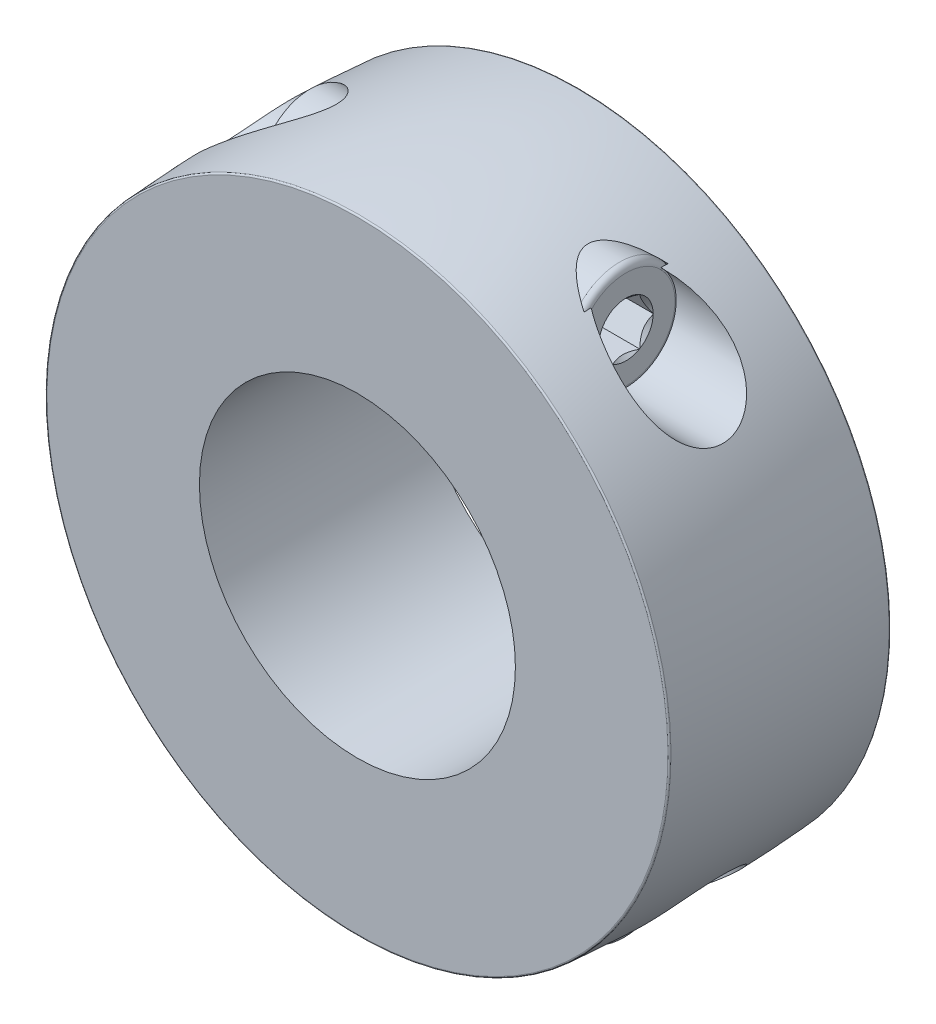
ISO-10303-21;
HEADER;
FILE_DESCRIPTION(('STEP AP214'),'2;1');
FILE_NAME('part.step','',(''),(''),'','','');
FILE_SCHEMA(('AUTOMOTIVE_DESIGN { 1 0 10303 214 1 1 1 1 }'));
ENDSEC;
DATA;
#1=APPLICATION_CONTEXT('core data for automotive mechanical design processes');
#2=APPLICATION_PROTOCOL_DEFINITION('international standard','automotive_design',2000,#1);
#3=PRODUCT_CONTEXT('',#1,'mechanical');
#4=PRODUCT('Part','Part','',(#3));
#5=PRODUCT_RELATED_PRODUCT_CATEGORY('part','',(#4));
#6=PRODUCT_DEFINITION_FORMATION('','',#4);
#7=PRODUCT_DEFINITION_CONTEXT('part definition',#1,'design');
#8=PRODUCT_DEFINITION('design','',#6,#7);
#9=PRODUCT_DEFINITION_SHAPE('','',#8);
#10=(LENGTH_UNIT() NAMED_UNIT(*) SI_UNIT(.MILLI.,.METRE.));
#11=(NAMED_UNIT(*) PLANE_ANGLE_UNIT() SI_UNIT($,.RADIAN.));
#12=(NAMED_UNIT(*) SI_UNIT($,.STERADIAN.) SOLID_ANGLE_UNIT());
#13=UNCERTAINTY_MEASURE_WITH_UNIT(LENGTH_MEASURE(1.E-05),#10,'distance_accuracy_value','');
#14=(GEOMETRIC_REPRESENTATION_CONTEXT(3) GLOBAL_UNCERTAINTY_ASSIGNED_CONTEXT((#13)) GLOBAL_UNIT_ASSIGNED_CONTEXT((#10,
#11,#12)) REPRESENTATION_CONTEXT('',''));
#15=CARTESIAN_POINT('',(0.,0.,0.));
#16=DIRECTION('',(0.,0.,1.));
#17=DIRECTION('',(1.,0.,0.));
#18=AXIS2_PLACEMENT_3D('',#15,#16,#17);
#19=CARTESIAN_POINT('',(-10.,15.,7.));
#20=DIRECTION('',(-1.,0.,0.));
#21=DIRECTION('',(0.,0.,-1.));
#22=AXIS2_PLACEMENT_3D('',#19,#20,#21);
#23=CYLINDRICAL_SURFACE('',#22,3.18137783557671);
#24=CARTESIAN_POINT('',(-10.0002,17.2917338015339,4.793391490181));
#25=CARTESIAN_POINT('',(-9.94981186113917,17.3216829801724,4.82449923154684));
#26=CARTESIAN_POINT('',(-9.89966732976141,17.3511964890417,4.85641517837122));
#27=CARTESIAN_POINT('',(-9.79996116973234,17.4093234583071,4.92196077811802));
#28=CARTESIAN_POINT('',(-9.7503996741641,17.4379367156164,4.95559081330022));
#29=CARTESIAN_POINT('',(-9.60225031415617,17.5226586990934,5.05953922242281));
#30=CARTESIAN_POINT('',(-9.50472910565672,17.577334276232,5.13259115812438));
#31=CARTESIAN_POINT('',(-9.3120455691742,17.6833947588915,5.28838756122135));
#32=CARTESIAN_POINT('',(-9.21696572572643,17.7346952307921,5.3712925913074));
#33=CARTESIAN_POINT('',(-9.03358346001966,17.831891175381,5.5468612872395));
#34=CARTESIAN_POINT('',(-8.94526487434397,17.8777996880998,5.63950033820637));
#35=CARTESIAN_POINT('',(-8.80041889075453,17.9518913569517,5.81096205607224));
#36=CARTESIAN_POINT('',(-8.74157936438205,17.9815869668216,5.88715548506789));
#37=CARTESIAN_POINT('',(-8.63197085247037,18.0363202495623,6.04657916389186));
#38=CARTESIAN_POINT('',(-8.58118615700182,18.0613670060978,6.12979521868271));
#39=CARTESIAN_POINT('',(-8.49019297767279,18.1058654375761,6.30498749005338));
#40=CARTESIAN_POINT('',(-8.45014522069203,18.1252324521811,6.39707148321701));
#41=CARTESIAN_POINT('',(-8.38610255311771,18.1560406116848,6.58790690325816));
#42=CARTESIAN_POINT('',(-8.36206354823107,18.1675035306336,6.68663918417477));
#43=CARTESIAN_POINT('',(-8.33696839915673,18.1794554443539,6.86471561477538));
#44=CARTESIAN_POINT('',(-8.33193363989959,18.1818449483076,6.94337284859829));
#45=CARTESIAN_POINT('',(-8.33421770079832,18.1807595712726,7.10048437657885));
#46=CARTESIAN_POINT('',(-8.34153806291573,18.1772839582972,7.17893864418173));
#47=CARTESIAN_POINT('',(-8.36764084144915,18.164839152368,7.33305175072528));
#48=CARTESIAN_POINT('',(-8.38637400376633,18.1558935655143,7.40872112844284));
#49=CARTESIAN_POINT('',(-8.43345239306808,18.1332739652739,7.55617860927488));
#50=CARTESIAN_POINT('',(-8.46179906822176,18.1195992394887,7.62796612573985));
#51=CARTESIAN_POINT('',(-8.54744203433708,18.077960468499,7.81327061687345));
#52=CARTESIAN_POINT('',(-8.61146754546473,18.0465353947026,7.92287357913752));
#53=CARTESIAN_POINT('',(-8.75340644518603,17.9757031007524,8.13073418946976));
#54=CARTESIAN_POINT('',(-8.83143293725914,17.9362304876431,8.2288878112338));
#55=CARTESIAN_POINT('',(-8.99517131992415,17.8518859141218,8.41352970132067));
#56=CARTESIAN_POINT('',(-9.08078028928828,17.8070840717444,8.50014329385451));
#57=CARTESIAN_POINT('',(-9.25775299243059,17.712729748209,8.66471296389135));
#58=CARTESIAN_POINT('',(-9.34912700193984,17.6631686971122,8.74265285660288));
#59=CARTESIAN_POINT('',(-9.53268537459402,17.5616886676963,8.88853604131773));
#60=CARTESIAN_POINT('',(-9.62475084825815,17.5098953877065,8.95671895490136));
#61=CARTESIAN_POINT('',(-9.81103112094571,17.4031385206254,9.08639349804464));
#62=CARTESIAN_POINT('',(-9.90523534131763,17.3481890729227,9.14791187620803));
#63=CARTESIAN_POINT('',(-10.0002,17.2917338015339,9.206608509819));
#64=B_SPLINE_CURVE_WITH_KNOTS('',3,(#24,#25,#26,#27,#28,#29,#30,#31,#32,#33,#34,#35,#36,#37,#38,
#39,#40,#41,#42,#43,#44,#45,#46,#47,#48,#49,#50,#51,#52,#53,#54,#55,#56,#57,#58,#59,#60,#61,#62,
#63),.UNSPECIFIED.,.F.,.F.,(4,2,2,2,2,2,2,2,2,2,2,2,2,2,2,2,2,2,2,4),(0.,0.199064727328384,
0.39817404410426,0.798483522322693,1.20656025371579,1.61362882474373,1.91534576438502,
2.2164668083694,2.52187139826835,2.82643126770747,3.06185070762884,3.29729953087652,
3.5317393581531,3.76621451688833,4.15625661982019,4.54960440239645,4.93825421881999,
5.32761749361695,5.70455679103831,6.0799223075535),.UNSPECIFIED.);
#65=CARTESIAN_POINT('',(-10.,17.2918526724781,4.79351495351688));
#66=VERTEX_POINT('',#65);
#67=CARTESIAN_POINT('',(-10.,17.291852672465,9.20648504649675));
#68=VERTEX_POINT('',#67);
#69=EDGE_CURVE('E1190',#66,#68,#64,.T.);
#70=ORIENTED_EDGE('',*,*,#69,.F.);
#71=CARTESIAN_POINT('',(-10.,15.,7.));
#72=DIRECTION('',(-1.,0.,0.));
#73=DIRECTION('',(0.,0.,-1.));
#74=AXIS2_PLACEMENT_3D('',#71,#72,#73);
#75=CIRCLE('',#74,3.18137783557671);
#76=EDGE_CURVE('E1198',#68,#66,#75,.T.);
#77=ORIENTED_EDGE('',*,*,#76,.F.);
#78=EDGE_LOOP('',(#70,#77));
#79=FACE_BOUND('',#78,.T.);
#80=ADVANCED_FACE('F14',(#79),#23,.T.);
#81=CARTESIAN_POINT('',(-25.,15.,7.));
#82=DIRECTION('',(-1.,0.,0.));
#83=DIRECTION('',(0.,0.,-1.));
#84=AXIS2_PLACEMENT_3D('',#81,#82,#83);
#85=CYLINDRICAL_SURFACE('',#84,3.18137783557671);
#86=CARTESIAN_POINT('',(-10.,15.,7.));
#87=DIRECTION('',(-1.,0.,0.));
#88=DIRECTION('',(0.,0.,-1.));
#89=AXIS2_PLACEMENT_3D('',#86,#87,#88);
#90=CIRCLE('',#89,3.18137783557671);
#91=EDGE_CURVE('E37',#66,#68,#90,.T.);
#92=ORIENTED_EDGE('',*,*,#91,.F.);
#93=CARTESIAN_POINT('',(-9.9998,17.2919715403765,9.20636157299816));
#94=CARTESIAN_POINT('',(-10.0826974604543,17.2427062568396,9.25751835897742));
#95=CARTESIAN_POINT('',(-10.1662263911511,17.1922743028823,9.30649766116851));
#96=CARTESIAN_POINT('',(-10.3342244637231,17.0891877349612,9.40027857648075));
#97=CARTESIAN_POINT('',(-10.4186933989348,17.0365336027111,9.44508108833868));
#98=CARTESIAN_POINT('',(-10.5882671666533,16.9291031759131,9.53069871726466));
#99=CARTESIAN_POINT('',(-10.6733718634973,16.8743273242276,9.57151466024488));
#100=CARTESIAN_POINT('',(-10.8440061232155,16.7627178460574,9.64926709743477));
#101=CARTESIAN_POINT('',(-10.9295357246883,16.7058840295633,9.68620323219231));
#102=CARTESIAN_POINT('',(-11.1887579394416,16.5308411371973,9.79221861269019));
#103=CARTESIAN_POINT('',(-11.3628207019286,16.4095203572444,9.8553698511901));
#104=CARTESIAN_POINT('',(-11.7104685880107,16.1592147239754,9.96582073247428));
#105=CARTESIAN_POINT('',(-11.8840536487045,16.030228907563,10.0131183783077));
#106=CARTESIAN_POINT('',(-12.2333449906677,15.7622467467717,10.0919368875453));
#107=CARTESIAN_POINT('',(-12.4090146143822,15.6230931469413,10.1230900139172));
#108=CARTESIAN_POINT('',(-12.7572953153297,15.3381993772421,10.1666298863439));
#109=CARTESIAN_POINT('',(-12.9299070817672,15.1924607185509,10.1790209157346));
#110=CARTESIAN_POINT('',(-13.269842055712,14.8962676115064,10.1831161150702));
#111=CARTESIAN_POINT('',(-13.4371876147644,14.7458407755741,10.1749247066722));
#112=CARTESIAN_POINT('',(-13.7656702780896,14.4414117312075,10.135709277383));
#113=CARTESIAN_POINT('',(-13.9268129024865,14.287412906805,10.1047060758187));
#114=CARTESIAN_POINT('',(-14.2557135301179,13.9636859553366,10.0129922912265));
#115=CARTESIAN_POINT('',(-14.4226762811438,13.793836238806,9.94976998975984));
#116=CARTESIAN_POINT('',(-14.7431368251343,13.4577495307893,9.78877330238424));
#117=CARTESIAN_POINT('',(-14.896650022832,13.2915085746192,9.69103910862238));
#118=CARTESIAN_POINT('',(-15.157601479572,13.0010206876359,9.48011076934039));
#119=CARTESIAN_POINT('',(-15.2682164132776,12.8748571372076,9.37353109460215));
#120=CARTESIAN_POINT('',(-15.4743295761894,12.6350542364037,9.13465745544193));
#121=CARTESIAN_POINT('',(-15.5698444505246,12.5214011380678,9.00239216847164));
#122=CARTESIAN_POINT('',(-15.7265063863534,12.331912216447,8.73890832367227));
#123=CARTESIAN_POINT('',(-15.7907449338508,12.2529533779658,8.61181234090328));
#124=CARTESIAN_POINT('',(-15.8759443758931,12.1471092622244,8.40995605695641));
#125=CARTESIAN_POINT('',(-15.9024920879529,12.1139171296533,8.34077469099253));
#126=CARTESIAN_POINT('',(-15.9516126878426,12.0522051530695,8.19901477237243));
#127=CARTESIAN_POINT('',(-15.9741872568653,12.0236833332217,8.12643767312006));
#128=CARTESIAN_POINT('',(-16.0152548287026,11.971590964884,7.97782686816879));
#129=CARTESIAN_POINT('',(-16.0337198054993,11.9480544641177,7.90177345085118));
#130=CARTESIAN_POINT('',(-16.0661502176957,11.9065914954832,7.74725154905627));
#131=CARTESIAN_POINT('',(-16.0801177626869,11.8886623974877,7.66878421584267));
#132=CARTESIAN_POINT('',(-16.1033842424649,11.8587368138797,7.51004703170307));
#133=CARTESIAN_POINT('',(-16.1126837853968,11.846739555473,7.4297774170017));
#134=CARTESIAN_POINT('',(-16.1264963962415,11.8289013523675,7.2681780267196));
#135=CARTESIAN_POINT('',(-16.1310099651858,11.8230597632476,7.18684836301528));
#136=CARTESIAN_POINT('',(-16.1368151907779,11.8155521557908,6.95962959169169));
#137=CARTESIAN_POINT('',(-16.1327798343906,11.8207849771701,6.81327949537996));
#138=CARTESIAN_POINT('',(-16.1093363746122,11.8510639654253,6.52402607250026));
#139=CARTESIAN_POINT('',(-16.0899311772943,11.8761063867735,6.3811220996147));
#140=CARTESIAN_POINT('',(-16.0371342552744,11.9437357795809,6.10549837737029));
#141=CARTESIAN_POINT('',(-16.0040388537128,11.9859507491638,5.97262948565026));
#142=CARTESIAN_POINT('',(-15.9251121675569,12.0856371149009,5.71683177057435));
#143=CARTESIAN_POINT('',(-15.8792786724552,12.1431111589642,5.59390467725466));
#144=CARTESIAN_POINT('',(-15.7719818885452,12.2760361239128,5.35013925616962));
#145=CARTESIAN_POINT('',(-15.7095293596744,12.3525912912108,5.23034300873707));
#146=CARTESIAN_POINT('',(-15.5732555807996,12.5170962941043,5.00607434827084));
#147=CARTESIAN_POINT('',(-15.4994268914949,12.6050535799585,4.90161205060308));
#148=CARTESIAN_POINT('',(-15.3063595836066,12.8311734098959,4.66439301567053));
#149=CARTESIAN_POINT('',(-15.1817473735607,12.9739651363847,4.54039947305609));
#150=CARTESIAN_POINT('',(-14.916950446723,13.2690762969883,4.3244352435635));
#151=CARTESIAN_POINT('',(-14.776737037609,13.4214130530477,4.23252488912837));
#152=CARTESIAN_POINT('',(-14.5314134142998,13.6802869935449,4.10288749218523));
#153=CARTESIAN_POINT('',(-14.4293944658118,13.7859125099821,4.05723059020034));
#154=CARTESIAN_POINT('',(-14.2208868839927,13.9974944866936,3.9785951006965));
#155=CARTESIAN_POINT('',(-14.1143967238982,14.1034510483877,3.94562088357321));
#156=CARTESIAN_POINT('',(-13.7891598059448,14.4204318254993,3.86424957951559));
#157=CARTESIAN_POINT('',(-13.5647998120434,14.6304046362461,3.83348064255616));
#158=CARTESIAN_POINT('',(-13.178960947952,14.9764821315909,3.81558962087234));
#159=CARTESIAN_POINT('',(-13.0199191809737,15.1150337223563,3.81777723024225));
#160=CARTESIAN_POINT('',(-12.6984658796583,15.3869785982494,3.83930204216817));
#161=CARTESIAN_POINT('',(-12.5360530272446,15.5203698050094,3.85864608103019));
#162=CARTESIAN_POINT('',(-12.2089932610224,15.7811328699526,3.91313181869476));
#163=CARTESIAN_POINT('',(-12.0443453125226,15.9085018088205,3.9482810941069));
#164=CARTESIAN_POINT('',(-11.713919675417,16.1565755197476,4.03340391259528));
#165=CARTESIAN_POINT('',(-11.54814225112,16.2772817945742,4.08337409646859));
#166=CARTESIAN_POINT('',(-11.2656742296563,16.4768494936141,4.18069394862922));
#167=CARTESIAN_POINT('',(-11.1489942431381,16.5575117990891,4.22443255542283));
#168=CARTESIAN_POINT('',(-10.9160472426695,16.7151476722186,4.31897879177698));
#169=CARTESIAN_POINT('',(-10.79978012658,16.7921222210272,4.36978452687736));
#170=CARTESIAN_POINT('',(-10.568623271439,16.9419142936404,4.47835842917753));
#171=CARTESIAN_POINT('',(-10.4537297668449,17.0147482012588,4.53609586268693));
#172=CARTESIAN_POINT('',(-10.2254493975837,17.1564220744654,4.65911504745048));
#173=CARTESIAN_POINT('',(-10.1120632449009,17.2252602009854,4.72440023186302));
#174=CARTESIAN_POINT('',(-9.9998,17.2919715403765,4.79363842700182));
#175=B_SPLINE_CURVE_WITH_KNOTS('',3,(#93,#94,#95,#96,#97,#98,#99,#100,#101,#102,#103,#104,#105,
#106,#107,#108,#109,#110,#111,#112,#113,#114,#115,#116,#117,#118,#119,#120,#121,#122,#123,#124,
#125,#126,#127,#128,#129,#130,#131,#132,#133,#134,#135,#136,#137,#138,#139,#140,#141,#142,#143,
#144,#145,#146,#147,#148,#149,#150,#151,#152,#153,#154,#155,#156,#157,#158,#159,#160,#161,#162,
#163,#164,#165,#166,#167,#168,#169,#170,#171,#172,#173,#174),.UNSPECIFIED.,.F.,.F.,(4,2,2,2,2,2,
2,2,2,2,2,2,2,2,2,2,2,2,2,2,2,2,2,2,2,2,2,2,2,2,2,2,2,2,2,2,2,2,2,2,4),(0.,0.327431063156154,
0.654791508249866,0.982083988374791,1.30940676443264,1.97275051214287,2.63617778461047,
3.31411705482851,3.99190153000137,4.66625432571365,5.33999243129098,6.07686925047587,
6.8128907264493,7.40699573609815,8.00044121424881,8.48674089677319,8.73006790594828,
8.97329170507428,9.21812657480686,9.46284643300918,9.70753440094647,9.95219675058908,
10.3893089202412,10.8263384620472,11.2543662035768,11.6824682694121,12.1465167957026,
12.6108700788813,13.2865795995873,13.9635530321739,14.424311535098,14.8852286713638,
15.8077628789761,16.439904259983,17.0722976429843,17.7049945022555,18.3375480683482,
18.7826653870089,19.2276636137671,19.6707570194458,20.1140527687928),.UNSPECIFIED.);
#176=EDGE_CURVE('E778',#68,#66,#175,.T.);
#177=ORIENTED_EDGE('',*,*,#176,.F.);
#178=EDGE_LOOP('',(#92,#177));
#179=FACE_BOUND('',#178,.T.);
#180=ADVANCED_FACE('F1063',(#179),#85,.F.);
#181=CARTESIAN_POINT('',(-5.,-15.,7.));
#182=DIRECTION('',(1.,0.,0.));
#183=DIRECTION('',(0.,0.,1.));
#184=AXIS2_PLACEMENT_3D('',#181,#182,#183);
#185=CYLINDRICAL_SURFACE('',#184,3.18137783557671);
#186=CARTESIAN_POINT('',(-10.0002,-17.2917338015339,9.206608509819));
#187=CARTESIAN_POINT('',(-9.94981186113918,-17.3216829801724,9.17550076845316));
#188=CARTESIAN_POINT('',(-9.89966732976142,-17.3511964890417,9.14358482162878));
#189=CARTESIAN_POINT('',(-9.79996116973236,-17.4093234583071,9.07803922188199));
#190=CARTESIAN_POINT('',(-9.75039967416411,-17.4379367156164,9.04440918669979));
#191=CARTESIAN_POINT('',(-9.60225031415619,-17.5226586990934,8.94046077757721));
#192=CARTESIAN_POINT('',(-9.50472910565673,-17.5773342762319,8.86740884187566));
#193=CARTESIAN_POINT('',(-9.31204556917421,-17.6833947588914,8.71161243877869));
#194=CARTESIAN_POINT('',(-9.21696572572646,-17.7346952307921,8.62870740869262));
#195=CARTESIAN_POINT('',(-9.03358346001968,-17.831891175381,8.45313871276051));
#196=CARTESIAN_POINT('',(-8.94526487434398,-17.8777996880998,8.36049966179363));
#197=CARTESIAN_POINT('',(-8.80041889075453,-17.9518913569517,8.18903794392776));
#198=CARTESIAN_POINT('',(-8.74157936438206,-17.9815869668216,8.1128445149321));
#199=CARTESIAN_POINT('',(-8.63197085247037,-18.0363202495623,7.95342083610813));
#200=CARTESIAN_POINT('',(-8.58118615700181,-18.0613670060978,7.87020478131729));
#201=CARTESIAN_POINT('',(-8.49019297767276,-18.1058654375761,7.69501250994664));
#202=CARTESIAN_POINT('',(-8.450145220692,-18.1252324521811,7.60292851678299));
#203=CARTESIAN_POINT('',(-8.38610255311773,-18.1560406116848,7.41209309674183));
#204=CARTESIAN_POINT('',(-8.36206354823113,-18.1675035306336,7.3133608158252));
#205=CARTESIAN_POINT('',(-8.33696839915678,-18.1794554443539,7.13528438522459));
#206=CARTESIAN_POINT('',(-8.3319336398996,-18.1818449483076,7.05662715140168));
#207=CARTESIAN_POINT('',(-8.33421770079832,-18.1807595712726,6.89951562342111));
#208=CARTESIAN_POINT('',(-8.34153806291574,-18.1772839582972,6.82106135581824));
#209=CARTESIAN_POINT('',(-8.36764084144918,-18.164839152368,6.66694824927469));
#210=CARTESIAN_POINT('',(-8.38637400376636,-18.1558935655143,6.59127887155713));
#211=CARTESIAN_POINT('',(-8.43345239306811,-18.1332739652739,6.44382139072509));
#212=CARTESIAN_POINT('',(-8.46179906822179,-18.1195992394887,6.37203387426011));
#213=CARTESIAN_POINT('',(-8.54744203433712,-18.077960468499,6.1867293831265));
#214=CARTESIAN_POINT('',(-8.61146754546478,-18.0465353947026,6.07712642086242));
#215=CARTESIAN_POINT('',(-8.7534064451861,-17.9757031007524,5.86926581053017));
#216=CARTESIAN_POINT('',(-8.83143293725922,-17.936230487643,5.77111218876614));
#217=CARTESIAN_POINT('',(-8.99517131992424,-17.8518859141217,5.58647029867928));
#218=CARTESIAN_POINT('',(-9.08078028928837,-17.8070840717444,5.49985670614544));
#219=CARTESIAN_POINT('',(-9.25775299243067,-17.712729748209,5.33528703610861));
#220=CARTESIAN_POINT('',(-9.3491270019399,-17.6631686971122,5.25734714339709));
#221=CARTESIAN_POINT('',(-9.53268537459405,-17.5616886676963,5.11146395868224));
#222=CARTESIAN_POINT('',(-9.62475084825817,-17.5098953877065,5.04328104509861));
#223=CARTESIAN_POINT('',(-9.81103112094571,-17.4031385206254,4.91360650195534));
#224=CARTESIAN_POINT('',(-9.90523534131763,-17.3481890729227,4.85208812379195));
#225=CARTESIAN_POINT('',(-10.0002,-17.2917338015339,4.793391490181));
#226=B_SPLINE_CURVE_WITH_KNOTS('',3,(#186,#187,#188,#189,#190,#191,#192,#193,#194,#195,#196,
#197,#198,#199,#200,#201,#202,#203,#204,#205,#206,#207,#208,#209,#210,#211,#212,#213,#214,#215,
#216,#217,#218,#219,#220,#221,#222,#223,#224,#225),.UNSPECIFIED.,.F.,.F.,(4,2,2,2,2,2,2,2,2,2,2,
2,2,2,2,2,2,2,2,4),(0.,0.199064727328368,0.398174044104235,0.79848352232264,1.20656025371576,
1.61362882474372,1.91534576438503,2.2164668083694,2.52187139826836,2.82643126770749,
3.06185070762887,3.29729953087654,3.53173935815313,3.76621451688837,4.15625661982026,
4.54960440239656,4.93825421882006,5.327617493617,5.70455679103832,6.07992230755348),.UNSPECIFIED.);
#227=CARTESIAN_POINT('',(-10.,-17.2918526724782,9.20648504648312));
#228=VERTEX_POINT('',#227);
#229=CARTESIAN_POINT('',(-10.,-17.2918526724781,4.79351495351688));
#230=VERTEX_POINT('',#229);
#231=EDGE_CURVE('E1205',#228,#230,#226,.T.);
#232=ORIENTED_EDGE('',*,*,#231,.F.);
#233=CARTESIAN_POINT('',(-10.,-15.,7.));
#234=DIRECTION('',(1.,0.,0.));
#235=DIRECTION('',(0.,0.,1.));
#236=AXIS2_PLACEMENT_3D('',#233,#234,#235);
#237=CIRCLE('',#236,3.18137783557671);
#238=EDGE_CURVE('E1459',#228,#230,#237,.T.);
#239=ORIENTED_EDGE('',*,*,#238,.T.);
#240=EDGE_LOOP('',(#232,#239));
#241=FACE_BOUND('',#240,.T.);
#242=ADVANCED_FACE('F1068',(#241),#185,.T.);
#243=CARTESIAN_POINT('',(-10.,-15.,7.));
#244=DIRECTION('',(1.,0.,0.));
#245=DIRECTION('',(0.,0.,1.));
#246=AXIS2_PLACEMENT_3D('',#243,#244,#245);
#247=CYLINDRICAL_SURFACE('',#246,3.18137783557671);
#248=CARTESIAN_POINT('',(-10.,-15.,7.));
#249=DIRECTION('',(1.,0.,0.));
#250=DIRECTION('',(0.,0.,1.));
#251=AXIS2_PLACEMENT_3D('',#248,#249,#250);
#252=CIRCLE('',#251,3.18137783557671);
#253=EDGE_CURVE('E1456',#230,#228,#252,.T.);
#254=ORIENTED_EDGE('',*,*,#253,.T.);
#255=CARTESIAN_POINT('',(-9.9998,-17.2919715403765,4.79363842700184));
#256=CARTESIAN_POINT('',(-10.0826974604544,-17.2427062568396,4.74248164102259));
#257=CARTESIAN_POINT('',(-10.1662263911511,-17.1922743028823,4.6935023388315));
#258=CARTESIAN_POINT('',(-10.3342244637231,-17.0891877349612,4.59972142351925));
#259=CARTESIAN_POINT('',(-10.4186933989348,-17.0365336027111,4.55491891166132));
#260=CARTESIAN_POINT('',(-10.5882671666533,-16.9291031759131,4.46930128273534));
#261=CARTESIAN_POINT('',(-10.6733718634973,-16.8743273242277,4.42848533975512));
#262=CARTESIAN_POINT('',(-10.8440061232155,-16.7627178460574,4.35073290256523));
#263=CARTESIAN_POINT('',(-10.9295357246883,-16.7058840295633,4.31379676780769));
#264=CARTESIAN_POINT('',(-11.1887579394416,-16.5308411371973,4.20778138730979));
#265=CARTESIAN_POINT('',(-11.3628207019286,-16.4095203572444,4.14463014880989));
#266=CARTESIAN_POINT('',(-11.7104685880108,-16.1592147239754,4.03417926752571));
#267=CARTESIAN_POINT('',(-11.8840536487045,-16.030228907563,3.98688162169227));
#268=CARTESIAN_POINT('',(-12.2333449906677,-15.7622467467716,3.90806311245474));
#269=CARTESIAN_POINT('',(-12.4090146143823,-15.6230931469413,3.87690998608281));
#270=CARTESIAN_POINT('',(-12.7572953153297,-15.3381993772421,3.83337011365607));
#271=CARTESIAN_POINT('',(-12.9299070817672,-15.1924607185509,3.8209790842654));
#272=CARTESIAN_POINT('',(-13.269842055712,-14.8962676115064,3.81688388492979));
#273=CARTESIAN_POINT('',(-13.4371876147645,-14.7458407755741,3.82507529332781));
#274=CARTESIAN_POINT('',(-13.7656702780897,-14.4414117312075,3.86429072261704));
#275=CARTESIAN_POINT('',(-13.9268129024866,-14.287412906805,3.89529392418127));
#276=CARTESIAN_POINT('',(-14.2557135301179,-13.9636859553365,3.98700770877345));
#277=CARTESIAN_POINT('',(-14.4226762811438,-13.793836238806,4.05023001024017));
#278=CARTESIAN_POINT('',(-14.7431368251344,-13.4577495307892,4.21122669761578));
#279=CARTESIAN_POINT('',(-14.896650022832,-13.2915085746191,4.30896089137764));
#280=CARTESIAN_POINT('',(-15.1576014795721,-13.0010206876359,4.51988923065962));
#281=CARTESIAN_POINT('',(-15.2682164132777,-12.8748571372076,4.62646890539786));
#282=CARTESIAN_POINT('',(-15.4743295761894,-12.6350542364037,4.86534254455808));
#283=CARTESIAN_POINT('',(-15.5698444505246,-12.5214011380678,4.99760783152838));
#284=CARTESIAN_POINT('',(-15.7265063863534,-12.331912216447,5.26109167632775));
#285=CARTESIAN_POINT('',(-15.7907449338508,-12.2529533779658,5.38818765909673));
#286=CARTESIAN_POINT('',(-15.8759443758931,-12.1471092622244,5.59004394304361));
#287=CARTESIAN_POINT('',(-15.9024920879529,-12.1139171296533,5.6592253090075));
#288=CARTESIAN_POINT('',(-15.9516126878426,-12.0522051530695,5.8009852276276));
#289=CARTESIAN_POINT('',(-15.9741872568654,-12.0236833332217,5.87356232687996));
#290=CARTESIAN_POINT('',(-16.0152548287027,-11.971590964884,6.02217313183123));
#291=CARTESIAN_POINT('',(-16.0337198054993,-11.9480544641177,6.09822654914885));
#292=CARTESIAN_POINT('',(-16.0661502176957,-11.9065914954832,6.25274845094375));
#293=CARTESIAN_POINT('',(-16.0801177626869,-11.8886623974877,6.33121578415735));
#294=CARTESIAN_POINT('',(-16.1033842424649,-11.8587368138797,6.48995296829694));
#295=CARTESIAN_POINT('',(-16.1126837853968,-11.846739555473,6.57022258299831));
#296=CARTESIAN_POINT('',(-16.1264963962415,-11.8289013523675,6.73182197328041));
#297=CARTESIAN_POINT('',(-16.1310099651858,-11.8230597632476,6.81315163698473));
#298=CARTESIAN_POINT('',(-16.1368151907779,-11.8155521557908,7.04037040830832));
#299=CARTESIAN_POINT('',(-16.1327798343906,-11.8207849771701,7.18672050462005));
#300=CARTESIAN_POINT('',(-16.1093363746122,-11.8510639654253,7.47597392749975));
#301=CARTESIAN_POINT('',(-16.0899311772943,-11.8761063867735,7.61887790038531));
#302=CARTESIAN_POINT('',(-16.0371342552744,-11.9437357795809,7.89450162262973));
#303=CARTESIAN_POINT('',(-16.0040388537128,-11.9859507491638,8.02737051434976));
#304=CARTESIAN_POINT('',(-15.9251121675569,-12.0856371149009,8.28316822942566));
#305=CARTESIAN_POINT('',(-15.8792786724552,-12.1431111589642,8.40609532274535));
#306=CARTESIAN_POINT('',(-15.7719818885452,-12.2760361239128,8.64986074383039));
#307=CARTESIAN_POINT('',(-15.7095293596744,-12.3525912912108,8.76965699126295));
#308=CARTESIAN_POINT('',(-15.5732555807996,-12.5170962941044,8.99392565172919));
#309=CARTESIAN_POINT('',(-15.4994268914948,-12.6050535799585,9.09838794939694));
#310=CARTESIAN_POINT('',(-15.3063595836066,-12.8311734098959,9.33560698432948));
#311=CARTESIAN_POINT('',(-15.1817473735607,-12.9739651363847,9.45960052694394));
#312=CARTESIAN_POINT('',(-14.916950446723,-13.2690762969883,9.67556475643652));
#313=CARTESIAN_POINT('',(-14.776737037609,-13.4214130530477,9.76747511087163));
#314=CARTESIAN_POINT('',(-14.5314134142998,-13.680286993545,9.89711250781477));
#315=CARTESIAN_POINT('',(-14.4293944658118,-13.7859125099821,9.94276940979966));
#316=CARTESIAN_POINT('',(-14.2208868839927,-13.9974944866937,10.0214048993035));
#317=CARTESIAN_POINT('',(-14.1143967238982,-14.1034510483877,10.0543791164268));
#318=CARTESIAN_POINT('',(-13.7891598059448,-14.4204318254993,10.1357504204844));
#319=CARTESIAN_POINT('',(-13.5647998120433,-14.6304046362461,10.1665193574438));
#320=CARTESIAN_POINT('',(-13.178960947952,-14.9764821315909,10.1844103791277));
#321=CARTESIAN_POINT('',(-13.0199191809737,-15.1150337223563,10.1822227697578));
#322=CARTESIAN_POINT('',(-12.6984658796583,-15.3869785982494,10.1606979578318));
#323=CARTESIAN_POINT('',(-12.5360530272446,-15.5203698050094,10.1413539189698));
#324=CARTESIAN_POINT('',(-12.2089932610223,-15.7811328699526,10.0868681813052));
#325=CARTESIAN_POINT('',(-12.0443453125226,-15.9085018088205,10.0517189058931));
#326=CARTESIAN_POINT('',(-11.713919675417,-16.1565755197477,9.96659608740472));
#327=CARTESIAN_POINT('',(-11.54814225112,-16.2772817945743,9.91662590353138));
#328=CARTESIAN_POINT('',(-11.2656742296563,-16.4768494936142,9.81930605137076));
#329=CARTESIAN_POINT('',(-11.1489942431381,-16.5575117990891,9.77556744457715));
#330=CARTESIAN_POINT('',(-10.9160472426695,-16.7151476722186,9.68102120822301));
#331=CARTESIAN_POINT('',(-10.79978012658,-16.7921222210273,9.63021547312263));
#332=CARTESIAN_POINT('',(-10.568623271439,-16.9419142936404,9.52164157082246));
#333=CARTESIAN_POINT('',(-10.4537297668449,-17.0147482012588,9.46390413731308));
#334=CARTESIAN_POINT('',(-10.2254493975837,-17.1564220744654,9.34088495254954));
#335=CARTESIAN_POINT('',(-10.1120632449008,-17.2252602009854,9.27559976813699));
#336=CARTESIAN_POINT('',(-9.9998,-17.2919715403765,9.20636157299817));
#337=B_SPLINE_CURVE_WITH_KNOTS('',3,(#255,#256,#257,#258,#259,#260,#261,#262,#263,#264,#265,
#266,#267,#268,#269,#270,#271,#272,#273,#274,#275,#276,#277,#278,#279,#280,#281,#282,#283,#284,
#285,#286,#287,#288,#289,#290,#291,#292,#293,#294,#295,#296,#297,#298,#299,#300,#301,#302,#303,
#304,#305,#306,#307,#308,#309,#310,#311,#312,#313,#314,#315,#316,#317,#318,#319,#320,#321,#322,
#323,#324,#325,#326,#327,#328,#329,#330,#331,#332,#333,#334,#335,#336),.UNSPECIFIED.,.F.,.F.,(4,
2,2,2,2,2,2,2,2,2,2,2,2,2,2,2,2,2,2,2,2,2,2,2,2,2,2,2,2,2,2,2,2,2,2,2,2,2,2,2,4),(0.,
0.327431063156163,0.65479150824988,0.982083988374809,1.30940676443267,1.97275051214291,
2.63617778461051,3.31411705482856,3.99190153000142,4.6662543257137,5.33999243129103,
6.07686925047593,6.81289072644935,7.40699573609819,8.00044121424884,8.48674089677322,
8.73006790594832,8.97329170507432,9.2181265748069,9.46284643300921,9.70753440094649,
9.9521967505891,10.3893089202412,10.8263384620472,11.2543662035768,11.6824682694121,
12.1465167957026,12.6108700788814,13.2865795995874,13.9635530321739,14.424311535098,
14.8852286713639,15.8077628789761,16.439904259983,17.0722976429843,17.7049945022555,
18.3375480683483,18.782665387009,19.2276636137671,19.6707570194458,20.1140527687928),.UNSPECIFIED.);
#338=EDGE_CURVE('E1214',#230,#228,#337,.T.);
#339=ORIENTED_EDGE('',*,*,#338,.F.);
#340=EDGE_LOOP('',(#254,#339));
#341=FACE_BOUND('',#340,.T.);
#342=ADVANCED_FACE('F1095',(#341),#247,.F.);
#343=CARTESIAN_POINT('',(0.,0.,14.));
#344=DIRECTION('',(0.,0.,1.));
#345=DIRECTION('',(0.,1.,0.));
#346=AXIS2_PLACEMENT_3D('',#343,#344,#345);
#347=CYLINDRICAL_SURFACE('',#346,10.);
#348=CARTESIAN_POINT('',(0.,0.,14.));
#349=DIRECTION('',(0.,0.,1.));
#350=DIRECTION('',(0.,1.,0.));
#351=AXIS2_PLACEMENT_3D('',#348,#349,#350);
#352=CIRCLE('',#351,10.);
#353=CARTESIAN_POINT('',(0.,10.,14.));
#354=VERTEX_POINT('',#353);
#355=EDGE_CURVE('E1440',#354,#354,#352,.T.);
#356=ORIENTED_EDGE('',*,*,#355,.T.);
#357=EDGE_LOOP('',(#356));
#358=FACE_BOUND('',#357,.T.);
#359=CARTESIAN_POINT('',(0.,0.,0.));
#360=DIRECTION('',(0.,0.,1.));
#361=DIRECTION('',(0.,1.,0.));
#362=AXIS2_PLACEMENT_3D('',#359,#360,#361);
#363=CIRCLE('',#362,10.);
#364=CARTESIAN_POINT('',(0.,10.,0.));
#365=VERTEX_POINT('',#364);
#366=EDGE_CURVE('E1435',#365,#365,#363,.T.);
#367=ORIENTED_EDGE('',*,*,#366,.F.);
#368=EDGE_LOOP('',(#367));
#369=FACE_BOUND('',#368,.T.);
#370=ADVANCED_FACE('F1158',(#358,#369),#347,.F.);
#371=CARTESIAN_POINT('',(0.,10.,14.));
#372=DIRECTION('',(0.,0.,1.));
#373=DIRECTION('',(0.,1.,0.));
#374=AXIS2_PLACEMENT_3D('',#371,#372,#373);
#375=PLANE('',#374);
#376=CARTESIAN_POINT('',(0.,0.,14.));
#377=DIRECTION('',(0.,0.,1.));
#378=DIRECTION('',(0.,1.,0.));
#379=AXIS2_PLACEMENT_3D('',#376,#377,#378);
#380=CIRCLE('',#379,19.6568522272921);
#381=CARTESIAN_POINT('',(0.,19.6568522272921,14.));
#382=VERTEX_POINT('',#381);
#383=EDGE_CURVE('E1443',#382,#382,#380,.T.);
#384=ORIENTED_EDGE('',*,*,#383,.T.);
#385=EDGE_LOOP('',(#384));
#386=FACE_BOUND('',#385,.T.);
#387=ORIENTED_EDGE('',*,*,#355,.F.);
#388=EDGE_LOOP('',(#387));
#389=FACE_BOUND('',#388,.T.);
#390=ADVANCED_FACE('F1148',(#386,#389),#375,.T.);
#391=CARTESIAN_POINT('',(0.,0.,6.9999999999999));
#392=DIRECTION('',(0.,0.,1.));
#393=DIRECTION('',(0.,1.,0.));
#394=AXIS2_PLACEMENT_3D('',#391,#392,#393);
#395=DEGENERATE_TOROIDAL_SURFACE('',#394,78.125000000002,98.125000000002,.F.);
#396=CARTESIAN_POINT('',(0.,0.,0.0929609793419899));
#397=DIRECTION('',(0.,0.,1.));
#398=DIRECTION('',(0.,1.,0.));
#399=AXIS2_PLACEMENT_3D('',#396,#397,#398);
#400=CIRCLE('',#399,19.7566041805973);
#401=CARTESIAN_POINT('',(0.,19.7566041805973,0.0929609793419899));
#402=VERTEX_POINT('',#401);
#403=EDGE_CURVE('E1451',#402,#402,#400,.T.);
#404=ORIENTED_EDGE('',*,*,#403,.T.);
#405=EDGE_LOOP('',(#404));
#406=FACE_BOUND('',#405,.T.);
#407=CARTESIAN_POINT('',(0.,0.,13.907039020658));
#408=DIRECTION('',(0.,0.,1.));
#409=DIRECTION('',(0.,1.,0.));
#410=AXIS2_PLACEMENT_3D('',#407,#408,#409);
#411=CIRCLE('',#410,19.7566041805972);
#412=CARTESIAN_POINT('',(0.,19.7566041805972,13.907039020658));
#413=VERTEX_POINT('',#412);
#414=EDGE_CURVE('E1448',#413,#413,#411,.T.);
#415=ORIENTED_EDGE('',*,*,#414,.F.);
#416=EDGE_LOOP('',(#415));
#417=FACE_BOUND('',#416,.T.);
#418=ORIENTED_EDGE('',*,*,#338,.T.);
#419=ORIENTED_EDGE('',*,*,#231,.T.);
#420=EDGE_LOOP('',(#418,#419));
#421=FACE_BOUND('',#420,.T.);
#422=ORIENTED_EDGE('',*,*,#176,.T.);
#423=ORIENTED_EDGE('',*,*,#69,.T.);
#424=EDGE_LOOP('',(#422,#423));
#425=FACE_BOUND('',#424,.T.);
#426=CARTESIAN_POINT('',(9.9998,-17.2919715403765,9.20636157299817));
#427=CARTESIAN_POINT('',(10.0826974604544,-17.2427062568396,9.25751835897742));
#428=CARTESIAN_POINT('',(10.1662263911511,-17.1922743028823,9.3064976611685));
#429=CARTESIAN_POINT('',(10.3342244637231,-17.0891877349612,9.40027857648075));
#430=CARTESIAN_POINT('',(10.4186933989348,-17.0365336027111,9.44508108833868));
#431=CARTESIAN_POINT('',(10.5882671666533,-16.9291031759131,9.53069871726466));
#432=CARTESIAN_POINT('',(10.6733718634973,-16.8743273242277,9.57151466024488));
#433=CARTESIAN_POINT('',(10.8440061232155,-16.7627178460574,9.64926709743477));
#434=CARTESIAN_POINT('',(10.9295357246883,-16.7058840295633,9.68620323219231));
#435=CARTESIAN_POINT('',(11.1887579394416,-16.5308411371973,9.79221861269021));
#436=CARTESIAN_POINT('',(11.3628207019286,-16.4095203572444,9.85536985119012));
#437=CARTESIAN_POINT('',(11.7104685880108,-16.1592147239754,9.96582073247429));
#438=CARTESIAN_POINT('',(11.8840536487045,-16.030228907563,10.0131183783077));
#439=CARTESIAN_POINT('',(12.2333449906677,-15.7622467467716,10.0919368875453));
#440=CARTESIAN_POINT('',(12.4090146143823,-15.6230931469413,10.1230900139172));
#441=CARTESIAN_POINT('',(12.7572953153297,-15.3381993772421,10.1666298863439));
#442=CARTESIAN_POINT('',(12.9299070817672,-15.1924607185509,10.1790209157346));
#443=CARTESIAN_POINT('',(13.269842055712,-14.8962676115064,10.1831161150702));
#444=CARTESIAN_POINT('',(13.4371876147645,-14.7458407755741,10.1749247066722));
#445=CARTESIAN_POINT('',(13.7656702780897,-14.4414117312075,10.135709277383));
#446=CARTESIAN_POINT('',(13.9268129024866,-14.287412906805,10.1047060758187));
#447=CARTESIAN_POINT('',(14.2557135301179,-13.9636859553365,10.0129922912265));
#448=CARTESIAN_POINT('',(14.4226762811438,-13.793836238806,9.94976998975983));
#449=CARTESIAN_POINT('',(14.7431368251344,-13.4577495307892,9.78877330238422));
#450=CARTESIAN_POINT('',(14.896650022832,-13.2915085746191,9.69103910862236));
#451=CARTESIAN_POINT('',(15.1576014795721,-13.0010206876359,9.48011076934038));
#452=CARTESIAN_POINT('',(15.2682164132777,-12.8748571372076,9.37353109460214));
#453=CARTESIAN_POINT('',(15.4743295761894,-12.6350542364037,9.13465745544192));
#454=CARTESIAN_POINT('',(15.5698444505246,-12.5214011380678,9.00239216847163));
#455=CARTESIAN_POINT('',(15.7265063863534,-12.331912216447,8.73890832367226));
#456=CARTESIAN_POINT('',(15.7907449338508,-12.2529533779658,8.61181234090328));
#457=CARTESIAN_POINT('',(15.8759443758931,-12.1471092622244,8.40995605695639));
#458=CARTESIAN_POINT('',(15.9024920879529,-12.1139171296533,8.34077469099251));
#459=CARTESIAN_POINT('',(15.9516126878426,-12.0522051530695,8.19901477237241));
#460=CARTESIAN_POINT('',(15.9741872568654,-12.0236833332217,8.12643767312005));
#461=CARTESIAN_POINT('',(16.0152548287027,-11.971590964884,7.97782686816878));
#462=CARTESIAN_POINT('',(16.0337198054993,-11.9480544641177,7.90177345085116));
#463=CARTESIAN_POINT('',(16.0661502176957,-11.9065914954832,7.74725154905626));
#464=CARTESIAN_POINT('',(16.0801177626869,-11.8886623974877,7.66878421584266));
#465=CARTESIAN_POINT('',(16.1033842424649,-11.8587368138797,7.51004703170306));
#466=CARTESIAN_POINT('',(16.1126837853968,-11.846739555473,7.42977741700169));
#467=CARTESIAN_POINT('',(16.1264963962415,-11.8289013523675,7.26817802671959));
#468=CARTESIAN_POINT('',(16.1310099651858,-11.8230597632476,7.18684836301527));
#469=CARTESIAN_POINT('',(16.1368151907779,-11.8155521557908,6.95962959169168));
#470=CARTESIAN_POINT('',(16.1327798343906,-11.8207849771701,6.81327949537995));
#471=CARTESIAN_POINT('',(16.1093363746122,-11.8510639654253,6.52402607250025));
#472=CARTESIAN_POINT('',(16.0899311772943,-11.8761063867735,6.38112209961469));
#473=CARTESIAN_POINT('',(16.0371342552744,-11.9437357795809,6.10549837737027));
#474=CARTESIAN_POINT('',(16.0040388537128,-11.9859507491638,5.97262948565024));
#475=CARTESIAN_POINT('',(15.9251121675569,-12.0856371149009,5.71683177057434));
#476=CARTESIAN_POINT('',(15.8792786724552,-12.1431111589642,5.59390467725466));
#477=CARTESIAN_POINT('',(15.7719818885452,-12.2760361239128,5.35013925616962));
#478=CARTESIAN_POINT('',(15.7095293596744,-12.3525912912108,5.23034300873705));
#479=CARTESIAN_POINT('',(15.5732555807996,-12.5170962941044,5.00607434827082));
#480=CARTESIAN_POINT('',(15.4994268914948,-12.6050535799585,4.90161205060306));
#481=CARTESIAN_POINT('',(15.3063595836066,-12.8311734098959,4.66439301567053));
#482=CARTESIAN_POINT('',(15.1817473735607,-12.9739651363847,4.54039947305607));
#483=CARTESIAN_POINT('',(14.916950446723,-13.2690762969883,4.32443524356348));
#484=CARTESIAN_POINT('',(14.776737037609,-13.4214130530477,4.23252488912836));
#485=CARTESIAN_POINT('',(14.5314134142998,-13.680286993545,4.10288749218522));
#486=CARTESIAN_POINT('',(14.4293944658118,-13.7859125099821,4.05723059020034));
#487=CARTESIAN_POINT('',(14.2208868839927,-13.9974944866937,3.9785951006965));
#488=CARTESIAN_POINT('',(14.1143967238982,-14.1034510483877,3.94562088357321));
#489=CARTESIAN_POINT('',(13.7891598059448,-14.4204318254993,3.86424957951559));
#490=CARTESIAN_POINT('',(13.5647998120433,-14.6304046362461,3.83348064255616));
#491=CARTESIAN_POINT('',(13.178960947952,-14.9764821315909,3.81558962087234));
#492=CARTESIAN_POINT('',(13.0199191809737,-15.1150337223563,3.81777723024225));
#493=CARTESIAN_POINT('',(12.6984658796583,-15.3869785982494,3.83930204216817));
#494=CARTESIAN_POINT('',(12.5360530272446,-15.5203698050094,3.85864608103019));
#495=CARTESIAN_POINT('',(12.2089932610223,-15.7811328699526,3.91313181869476));
#496=CARTESIAN_POINT('',(12.0443453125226,-15.9085018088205,3.9482810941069));
#497=CARTESIAN_POINT('',(11.713919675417,-16.1565755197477,4.03340391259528));
#498=CARTESIAN_POINT('',(11.54814225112,-16.2772817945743,4.08337409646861));
#499=CARTESIAN_POINT('',(11.2656742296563,-16.4768494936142,4.18069394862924));
#500=CARTESIAN_POINT('',(11.1489942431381,-16.5575117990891,4.22443255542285));
#501=CARTESIAN_POINT('',(10.9160472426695,-16.7151476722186,4.31897879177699));
#502=CARTESIAN_POINT('',(10.79978012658,-16.7921222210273,4.36978452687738));
#503=CARTESIAN_POINT('',(10.568623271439,-16.9419142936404,4.47835842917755));
#504=CARTESIAN_POINT('',(10.4537297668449,-17.0147482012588,4.53609586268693));
#505=CARTESIAN_POINT('',(10.2254493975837,-17.1564220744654,4.65911504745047));
#506=CARTESIAN_POINT('',(10.1120632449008,-17.2252602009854,4.72440023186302));
#507=CARTESIAN_POINT('',(9.9998,-17.2919715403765,4.79363842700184));
#508=B_SPLINE_CURVE_WITH_KNOTS('',3,(#426,#427,#428,#429,#430,#431,#432,#433,#434,#435,#436,
#437,#438,#439,#440,#441,#442,#443,#444,#445,#446,#447,#448,#449,#450,#451,#452,#453,#454,#455,
#456,#457,#458,#459,#460,#461,#462,#463,#464,#465,#466,#467,#468,#469,#470,#471,#472,#473,#474,
#475,#476,#477,#478,#479,#480,#481,#482,#483,#484,#485,#486,#487,#488,#489,#490,#491,#492,#493,
#494,#495,#496,#497,#498,#499,#500,#501,#502,#503,#504,#505,#506,#507),.UNSPECIFIED.,.F.,.F.,(4,
2,2,2,2,2,2,2,2,2,2,2,2,2,2,2,2,2,2,2,2,2,2,2,2,2,2,2,2,2,2,2,2,2,2,2,2,2,2,2,4),(0.,
0.327431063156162,0.654791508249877,0.982083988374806,1.30940676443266,1.97275051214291,
2.63617778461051,3.31411705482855,3.99190153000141,4.6662543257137,5.33999243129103,
6.07686925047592,6.81289072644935,7.40699573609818,8.00044121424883,8.48674089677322,
8.73006790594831,8.97329170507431,9.21812657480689,9.4628464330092,9.70753440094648,
9.9521967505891,10.3893089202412,10.8263384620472,11.2543662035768,11.6824682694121,
12.1465167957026,12.6108700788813,13.2865795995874,13.9635530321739,14.424311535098,
14.8852286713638,15.8077628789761,16.439904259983,17.0722976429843,17.7049945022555,
18.3375480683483,18.782665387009,19.2276636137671,19.6707570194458,20.1140527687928),.UNSPECIFIED.);
#509=CARTESIAN_POINT('',(10.,-17.2918526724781,9.20648504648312));
#510=VERTEX_POINT('',#509);
#511=CARTESIAN_POINT('',(10.,-17.2918526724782,4.79351495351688));
#512=VERTEX_POINT('',#511);
#513=EDGE_CURVE('E332',#510,#512,#508,.T.);
#514=ORIENTED_EDGE('',*,*,#513,.T.);
#515=CARTESIAN_POINT('',(10.,-17.3205080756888,7.));
#516=CARTESIAN_POINT('',(10.,-17.3205069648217,4.69128331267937));
#517=CARTESIAN_POINT('',(10.,-17.226509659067,2.38221128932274));
#518=CARTESIAN_POINT('',(10.,-16.9435835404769,-1.06974416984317));
#519=CARTESIAN_POINT('',(10.,-16.8255477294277,-2.21888966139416));
#520=CARTESIAN_POINT('',(10.,-16.5416298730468,-4.51139402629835));
#521=CARTESIAN_POINT('',(10.,-16.3757459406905,-5.65475266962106));
#522=CARTESIAN_POINT('',(10.,-15.9949018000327,-7.93663806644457));
#523=CARTESIAN_POINT('',(10.,-15.7798022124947,-9.07514155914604));
#524=CARTESIAN_POINT('',(10.,-15.2996920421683,-11.3416545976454));
#525=CARTESIAN_POINT('',(10.,-15.0346788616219,-12.4696635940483));
#526=CARTESIAN_POINT('',(10.,-14.4533804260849,-14.7112253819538));
#527=CARTESIAN_POINT('',(10.,-14.1371495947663,-15.8247921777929));
#528=CARTESIAN_POINT('',(10.,-13.6223013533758,-17.4823859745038));
#529=CARTESIAN_POINT('',(10.,-13.4439441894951,-18.0327658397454));
#530=CARTESIAN_POINT('',(10.,-13.0732421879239,-19.1287860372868));
#531=CARTESIAN_POINT('',(10.,-12.8808979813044,-19.6744265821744));
#532=CARTESIAN_POINT('',(10.,-12.4906732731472,-20.7357804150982));
#533=CARTESIAN_POINT('',(10.,-12.2934372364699,-21.2517305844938));
#534=CARTESIAN_POINT('',(10.,-11.8850389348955,-22.2780666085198));
#535=CARTESIAN_POINT('',(10.,-11.6738774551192,-22.788452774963));
#536=CARTESIAN_POINT('',(10.,-11.2365754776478,-23.8033430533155));
#537=CARTESIAN_POINT('',(10.,-11.0104212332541,-24.3078412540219));
#538=CARTESIAN_POINT('',(10.,-10.5422144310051,-25.3094071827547));
#539=CARTESIAN_POINT('',(10.,-10.3001623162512,-25.8064751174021));
#540=CARTESIAN_POINT('',(10.,-9.80034977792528,-26.7885441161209));
#541=CARTESIAN_POINT('',(10.,-9.54270389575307,-27.2736032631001));
#542=CARTESIAN_POINT('',(10.,-9.00829045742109,-28.2332208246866));
#543=CARTESIAN_POINT('',(10.,-8.73151939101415,-28.7077772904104));
#544=CARTESIAN_POINT('',(10.,-8.15673485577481,-29.6428057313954));
#545=CARTESIAN_POINT('',(10.,-7.85876040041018,-30.1033014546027));
#546=CARTESIAN_POINT('',(10.,-7.39283354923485,-30.7808475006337));
#547=CARTESIAN_POINT('',(10.,-7.2343934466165,-31.0044581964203));
#548=CARTESIAN_POINT('',(10.,-6.91054696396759,-31.4465662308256));
#549=CARTESIAN_POINT('',(10.,-6.74514116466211,-31.6650639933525));
#550=CARTESIAN_POINT('',(10.,-6.39226598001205,-32.1143287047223));
#551=CARTESIAN_POINT('',(10.,-6.20411552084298,-32.3445628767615));
#552=CARTESIAN_POINT('',(10.,-5.81761360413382,-32.7964014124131));
#553=CARTESIAN_POINT('',(10.,-5.6192607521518,-33.0180045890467));
#554=CARTESIAN_POINT('',(10.,-5.21108385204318,-33.4503539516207));
#555=CARTESIAN_POINT('',(10.,-5.00126228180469,-33.6611024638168));
#556=CARTESIAN_POINT('',(10.,-4.56860747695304,-34.0687852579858));
#557=CARTESIAN_POINT('',(10.,-4.34577858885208,-34.2657241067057));
#558=CARTESIAN_POINT('',(10.,-3.95832524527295,-34.582080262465));
#559=CARTESIAN_POINT('',(10.,-3.79763288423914,-34.7062868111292));
#560=CARTESIAN_POINT('',(10.,-3.46892295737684,-34.9445250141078));
#561=CARTESIAN_POINT('',(10.,-3.30090438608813,-35.0585552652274));
#562=CARTESIAN_POINT('',(10.,-2.78548692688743,-35.3819213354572));
#563=CARTESIAN_POINT('',(10.,-2.425927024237,-35.5732105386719));
#564=CARTESIAN_POINT('',(10.,-1.9144822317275,-35.7857325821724));
#565=CARTESIAN_POINT('',(10.,-1.7751870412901,-35.8379705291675));
#566=CARTESIAN_POINT('',(10.,-1.49302532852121,-35.9316136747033));
#567=CARTESIAN_POINT('',(10.,-1.35016067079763,-35.9730244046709));
#568=CARTESIAN_POINT('',(10.,-1.06164984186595,-36.0438530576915));
#569=CARTESIAN_POINT('',(10.,-0.916007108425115,-36.0732849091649));
#570=CARTESIAN_POINT('',(10.,-0.622688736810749,-36.1193072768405));
#571=CARTESIAN_POINT('',(10.,-0.475013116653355,-36.1358979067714));
#572=CARTESIAN_POINT('',(10.,-0.17803051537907,-36.155716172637));
#573=CARTESIAN_POINT('',(10.,-0.0287190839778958,-36.1588777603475));
#574=CARTESIAN_POINT('',(10.,0.269561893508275,-36.1515436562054));
#575=CARTESIAN_POINT('',(10.,0.41853144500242,-36.1410481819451));
#576=CARTESIAN_POINT('',(10.,0.7150258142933,-36.1067599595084));
#577=CARTESIAN_POINT('',(10.,0.862549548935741,-36.082957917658));
#578=CARTESIAN_POINT('',(10.,1.15507562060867,-36.0228286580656));
#579=CARTESIAN_POINT('',(10.,1.30007655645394,-35.9864946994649));
#580=CARTESIAN_POINT('',(10.,1.62264276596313,-35.8918190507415));
#581=CARTESIAN_POINT('',(10.,1.79925941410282,-35.830243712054));
#582=CARTESIAN_POINT('',(10.,2.14628872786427,-35.6915287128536));
#583=CARTESIAN_POINT('',(10.,2.31669823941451,-35.6143812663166));
#584=CARTESIAN_POINT('',(10.,2.6511685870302,-35.4467487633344));
#585=CARTESIAN_POINT('',(10.,2.81521715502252,-35.3562394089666));
#586=CARTESIAN_POINT('',(10.,3.13661205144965,-35.1641355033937));
#587=CARTESIAN_POINT('',(10.,3.29395882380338,-35.0625416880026));
#588=CARTESIAN_POINT('',(10.,3.72679233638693,-34.7642663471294));
#589=CARTESIAN_POINT('',(10.,3.99504187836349,-34.5570647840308));
#590=CARTESIAN_POINT('',(10.,4.51297609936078,-34.1206082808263));
#591=CARTESIAN_POINT('',(10.,4.76264399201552,-33.8913338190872));
#592=CARTESIAN_POINT('',(10.,5.24639452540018,-33.4157574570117));
#593=CARTESIAN_POINT('',(10.,5.4804335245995,-33.1694114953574));
#594=CARTESIAN_POINT('',(10.,5.93429374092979,-32.6641970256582));
#595=CARTESIAN_POINT('',(10.,6.15411982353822,-32.4053328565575));
#596=CARTESIAN_POINT('',(10.,6.52818145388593,-31.9434444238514));
#597=CARTESIAN_POINT('',(10.,6.68510872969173,-31.7425839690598));
#598=CARTESIAN_POINT('',(10.,6.992649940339,-31.336077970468));
#599=CARTESIAN_POINT('',(10.,7.14326348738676,-31.1304321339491));
#600=CARTESIAN_POINT('',(10.,7.58656545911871,-30.5072009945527));
#601=CARTESIAN_POINT('',(10.,7.87061153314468,-30.0834519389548));
#602=CARTESIAN_POINT('',(10.,8.41942862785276,-29.2227397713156));
#603=CARTESIAN_POINT('',(10.,8.68416559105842,-28.7857551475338));
#604=CARTESIAN_POINT('',(10.,9.19622681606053,-27.9018296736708));
#605=CARTESIAN_POINT('',(10.,9.44355402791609,-27.4548905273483));
#606=CARTESIAN_POINT('',(10.,9.92358976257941,-26.5509754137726));
#607=CARTESIAN_POINT('',(10.,10.1562361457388,-26.0939665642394));
#608=CARTESIAN_POINT('',(10.,10.6071989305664,-25.1729355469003));
#609=CARTESIAN_POINT('',(10.,10.8255149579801,-24.7089131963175));
#610=CARTESIAN_POINT('',(10.,11.2486586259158,-23.7752734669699));
#611=CARTESIAN_POINT('',(10.,11.453498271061,-23.305661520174));
#612=CARTESIAN_POINT('',(10.,11.8507040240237,-22.3611805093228));
#613=CARTESIAN_POINT('',(10.,12.0430694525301,-21.8863111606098));
#614=CARTESIAN_POINT('',(10.,12.5985732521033,-20.4646175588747));
#615=CARTESIAN_POINT('',(10.,12.9444701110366,-19.5110111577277));
#616=CARTESIAN_POINT('',(10.,13.5934227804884,-17.5892720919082));
#617=CARTESIAN_POINT('',(10.,13.8964716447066,-16.6211371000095));
#618=CARTESIAN_POINT('',(10.,14.4621455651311,-14.6722755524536));
#619=CARTESIAN_POINT('',(10.,14.7247368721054,-13.6915392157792));
#620=CARTESIAN_POINT('',(10.,15.2107088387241,-11.7203995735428));
#621=CARTESIAN_POINT('',(10.,15.434088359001,-10.7299959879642));
#622=CARTESIAN_POINT('',(10.,15.8424110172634,-8.74256866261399));
#623=CARTESIAN_POINT('',(10.,16.0274011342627,-7.74555457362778));
#624=CARTESIAN_POINT('',(10.,16.3599860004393,-5.74535878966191));
#625=CARTESIAN_POINT('',(10.,16.5075803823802,-4.74217703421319));
#626=CARTESIAN_POINT('',(10.,16.8949218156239,-1.72636349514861));
#627=CARTESIAN_POINT('',(10.,17.0794491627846,0.29362629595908));
#628=CARTESIAN_POINT('',(10.,17.3098513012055,4.46239823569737));
#629=CARTESIAN_POINT('',(10.,17.3467779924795,6.61166084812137));
#630=CARTESIAN_POINT('',(10.,17.2577911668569,10.907749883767));
#631=CARTESIAN_POINT('',(10.,17.1318302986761,13.0545754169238));
#632=CARTESIAN_POINT('',(10.,16.819718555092,16.2614755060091));
#633=CARTESIAN_POINT('',(10.,16.6952129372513,17.3278771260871));
#634=CARTESIAN_POINT('',(10.,16.4047327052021,19.454988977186));
#635=CARTESIAN_POINT('',(10.,16.238761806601,20.5156997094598));
#636=CARTESIAN_POINT('',(10.,15.8648031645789,22.6292414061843));
#637=CARTESIAN_POINT('',(10.,15.656832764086,23.6820754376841));
#638=CARTESIAN_POINT('',(10.,15.1979167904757,25.7782273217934));
#639=CARTESIAN_POINT('',(10.,14.9469756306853,26.8215461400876));
#640=CARTESIAN_POINT('',(10.,14.3821510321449,28.9670716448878));
#641=CARTESIAN_POINT('',(10.,14.0651503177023,30.0684654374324));
#642=CARTESIAN_POINT('',(10.,13.5497350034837,31.707989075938));
#643=CARTESIAN_POINT('',(10.,13.3712603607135,32.2524489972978));
#644=CARTESIAN_POINT('',(10.,13.0005250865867,33.3366466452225));
#645=CARTESIAN_POINT('',(10.,12.8082650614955,33.8763845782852));
#646=CARTESIAN_POINT('',(10.,12.4093785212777,34.9505191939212));
#647=CARTESIAN_POINT('',(10.,12.2027522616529,35.4849159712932));
#648=CARTESIAN_POINT('',(10.,11.7743860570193,36.5475926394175));
#649=CARTESIAN_POINT('',(10.,11.5526470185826,37.0758728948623));
#650=CARTESIAN_POINT('',(10.,11.0931429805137,38.1252088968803));
#651=CARTESIAN_POINT('',(10.,10.8553836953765,38.6462671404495));
#652=CARTESIAN_POINT('',(10.,10.3624916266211,39.6800656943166));
#653=CARTESIAN_POINT('',(10.,10.1073605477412,40.1928068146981));
#654=CARTESIAN_POINT('',(10.,9.57767674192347,41.2088693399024));
#655=CARTESIAN_POINT('',(10.,9.30310389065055,41.7121802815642));
#656=CARTESIAN_POINT('',(10.,8.73229280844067,42.7066076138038));
#657=CARTESIAN_POINT('',(10.,8.43605024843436,43.1977215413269));
#658=CARTESIAN_POINT('',(10.,7.97341544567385,43.9216553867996));
#659=CARTESIAN_POINT('',(10.,7.81640907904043,44.1604932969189));
#660=CARTESIAN_POINT('',(10.,7.49561552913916,44.6335623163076));
#661=CARTESIAN_POINT('',(10.,7.3318288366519,44.8677937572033));
#662=CARTESIAN_POINT('',(10.,6.99688603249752,45.3307764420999));
#663=CARTESIAN_POINT('',(10.,6.82573330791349,45.5595301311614));
#664=CARTESIAN_POINT('',(10.,6.47521080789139,46.0106282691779));
#665=CARTESIAN_POINT('',(10.,6.29584219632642,46.2329736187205));
#666=CARTESIAN_POINT('',(10.,5.95499920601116,46.6377679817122));
#667=CARTESIAN_POINT('',(10.,5.79477876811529,46.8212709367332));
#668=CARTESIAN_POINT('',(10.,5.46694589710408,47.1815713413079));
#669=CARTESIAN_POINT('',(10.,5.29933362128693,47.3583689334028));
#670=CARTESIAN_POINT('',(10.,4.95538187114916,47.7043843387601));
#671=CARTESIAN_POINT('',(10.,4.77901713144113,47.8735771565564));
#672=CARTESIAN_POINT('',(10.,4.41713247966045,48.2019346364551));
#673=CARTESIAN_POINT('',(10.,4.23161251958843,48.3610992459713));
#674=CARTESIAN_POINT('',(10.,3.84726307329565,48.6695139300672));
#675=CARTESIAN_POINT('',(10.,3.64826212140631,48.8185520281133));
#676=CARTESIAN_POINT('',(10.,3.238845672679,49.1003491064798));
#677=CARTESIAN_POINT('',(10.,3.02842694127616,49.2331034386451));
#678=CARTESIAN_POINT('',(10.,2.59688724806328,49.477232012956));
#679=CARTESIAN_POINT('',(10.,2.3758294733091,49.5887166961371));
#680=CARTESIAN_POINT('',(10.,1.92250498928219,49.7858252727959));
#681=CARTESIAN_POINT('',(10.,1.69025171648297,49.8714793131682));
#682=CARTESIAN_POINT('',(10.,1.31604147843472,49.9820806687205));
#683=CARTESIAN_POINT('',(10.,1.17711514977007,50.0174169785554));
#684=CARTESIAN_POINT('',(10.,0.896858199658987,50.0766250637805));
#685=CARTESIAN_POINT('',(10.,0.755528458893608,50.100500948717));
#686=CARTESIAN_POINT('',(10.,0.471409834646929,50.1360626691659));
#687=CARTESIAN_POINT('',(10.,0.32862174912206,50.1477548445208));
#688=CARTESIAN_POINT('',(10.,0.0425611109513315,50.158594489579));
#689=CARTESIAN_POINT('',(10.,-0.100711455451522,50.1577416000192));
#690=CARTESIAN_POINT('',(10.,-0.386574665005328,50.1435200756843));
#691=CARTESIAN_POINT('',(10.,-0.52916554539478,50.1301561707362));
#692=CARTESIAN_POINT('',(10.,-0.812678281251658,50.0913521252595));
#693=CARTESIAN_POINT('',(10.,-0.953600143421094,50.0659120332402));
#694=CARTESIAN_POINT('',(10.,-1.23302693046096,50.0036843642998));
#695=CARTESIAN_POINT('',(10.,-1.37152975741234,49.9668874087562));
#696=CARTESIAN_POINT('',(10.,-1.64538020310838,49.8829281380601));
#697=CARTESIAN_POINT('',(10.,-1.78072618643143,49.8357605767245));
#698=CARTESIAN_POINT('',(10.,-2.3074384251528,49.6313401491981));
#699=CARTESIAN_POINT('',(10.,-2.68527807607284,49.4382633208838));
#700=CARTESIAN_POINT('',(10.,-3.2259634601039,49.10783869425));
#701=CARTESIAN_POINT('',(10.,-3.40214215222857,48.9906455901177));
#702=CARTESIAN_POINT('',(10.,-3.74650872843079,48.7449489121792));
#703=CARTESIAN_POINT('',(10.,-3.91469762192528,48.6164467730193));
#704=CARTESIAN_POINT('',(10.,-4.24099581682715,48.3522690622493));
#705=CARTESIAN_POINT('',(10.,-4.39922030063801,48.2167340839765));
#706=CARTESIAN_POINT('',(10.,-4.70898892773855,47.9382084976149));
#707=CARTESIAN_POINT('',(10.,-4.86053188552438,47.7952165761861));
#708=CARTESIAN_POINT('',(10.,-5.30619656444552,47.3567263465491));
#709=CARTESIAN_POINT('',(10.,-5.59114355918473,47.0518886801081));
#710=CARTESIAN_POINT('',(10.,-6.14113228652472,46.4236002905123));
#711=CARTESIAN_POINT('',(10.,-6.40612013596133,46.1001030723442));
#712=CARTESIAN_POINT('',(10.,-6.79034255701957,45.6047764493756));
#713=CARTESIAN_POINT('',(10.,-6.91618601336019,45.4380174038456));
#714=CARTESIAN_POINT('',(10.,-7.16379511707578,45.1014904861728));
#715=CARTESIAN_POINT('',(10.,-7.28556065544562,44.9317225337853));
#716=CARTESIAN_POINT('',(10.,-7.58969376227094,44.4976065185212));
#717=CARTESIAN_POINT('',(10.,-7.76947522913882,44.2314447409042));
#718=CARTESIAN_POINT('',(10.,-8.1209189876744,43.6938026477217));
#719=CARTESIAN_POINT('',(10.,-8.29258048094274,43.4223218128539));
#720=CARTESIAN_POINT('',(10.,-8.79656131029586,42.6008861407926));
#721=CARTESIAN_POINT('',(10.,-9.11777147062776,42.0440909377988));
#722=CARTESIAN_POINT('',(10.,-9.73517154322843,40.9157322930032));
#723=CARTESIAN_POINT('',(10.,-10.0313191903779,40.3441459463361));
#724=CARTESIAN_POINT('',(10.,-10.6008239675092,39.1898769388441));
#725=CARTESIAN_POINT('',(10.,-10.8741848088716,38.6071961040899));
#726=CARTESIAN_POINT('',(10.,-11.4010428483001,37.4307046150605));
#727=CARTESIAN_POINT('',(10.,-11.6544733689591,36.8368642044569));
#728=CARTESIAN_POINT('',(10.,-12.1419853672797,35.6412948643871));
#729=CARTESIAN_POINT('',(10.,-12.3760663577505,35.0395657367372));
#730=CARTESIAN_POINT('',(10.,-12.8257840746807,33.8298433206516));
#731=CARTESIAN_POINT('',(10.,-13.0414362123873,33.221855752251));
#732=CARTESIAN_POINT('',(10.,-13.4553453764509,31.999978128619));
#733=CARTESIAN_POINT('',(10.,-13.6536016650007,31.38608782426));
#734=CARTESIAN_POINT('',(10.,-14.1393455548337,29.8090269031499));
#735=CARTESIAN_POINT('',(10.,-14.4148742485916,28.8421523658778));
#736=CARTESIAN_POINT('',(10.,-14.9269683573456,26.8981556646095));
#737=CARTESIAN_POINT('',(10.,-15.1635321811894,25.9210330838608));
#738=CARTESIAN_POINT('',(10.,-15.5989708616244,23.9578752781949));
#739=CARTESIAN_POINT('',(10.,-15.7978255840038,22.9718355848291));
#740=CARTESIAN_POINT('',(10.,-16.1584934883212,20.9929847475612));
#741=CARTESIAN_POINT('',(10.,-16.3203035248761,20.0001730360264));
#742=CARTESIAN_POINT('',(10.,-16.7504261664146,17.0179103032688));
#743=CARTESIAN_POINT('',(10.,-16.9643747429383,15.0203391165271));
#744=CARTESIAN_POINT('',(10.,-17.2494219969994,11.0152687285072));
#745=CARTESIAN_POINT('',(10.,-17.3205090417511,9.0077687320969));
#746=CARTESIAN_POINT('',(10.,-17.3205080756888,7.));
#747=B_SPLINE_CURVE_WITH_KNOTS('',3,(#515,#516,#517,#518,#519,#520,#521,#522,#523,#524,#525,
#526,#527,#528,#529,#530,#531,#532,#533,#534,#535,#536,#537,#538,#539,#540,#541,#542,#543,#544,
#545,#546,#547,#548,#549,#550,#551,#552,#553,#554,#555,#556,#557,#558,#559,#560,#561,#562,#563,
#564,#565,#566,#567,#568,#569,#570,#571,#572,#573,#574,#575,#576,#577,#578,#579,#580,#581,#582,
#583,#584,#585,#586,#587,#588,#589,#590,#591,#592,#593,#594,#595,#596,#597,#598,#599,#600,#601,
#602,#603,#604,#605,#606,#607,#608,#609,#610,#611,#612,#613,#614,#615,#616,#617,#618,#619,#620,
#621,#622,#623,#624,#625,#626,#627,#628,#629,#630,#631,#632,#633,#634,#635,#636,#637,#638,#639,
#640,#641,#642,#643,#644,#645,#646,#647,#648,#649,#650,#651,#652,#653,#654,#655,#656,#657,#658,
#659,#660,#661,#662,#663,#664,#665,#666,#667,#668,#669,#670,#671,#672,#673,#674,#675,#676,#677,
#678,#679,#680,#681,#682,#683,#684,#685,#686,#687,#688,#689,#690,#691,#692,#693,#694,#695,#696,
#697,#698,#699,#700,#701,#702,#703,#704,#705,#706,#707,#708,#709,#710,#711,#712,#713,#714,#715,
#716,#717,#718,#719,#720,#721,#722,#723,#724,#725,#726,#727,#728,#729,#730,#731,#732,#733,#734,
#735,#736,#737,#738,#739,#740,#741,#742,#743,#744,#745,#746),.UNSPECIFIED.,.T.,.F.,(4,2,2,2,2,2,
2,2,2,2,2,2,2,2,2,2,2,2,2,2,2,2,2,2,2,2,2,2,2,2,2,2,2,2,2,2,2,2,2,2,2,2,2,2,2,2,2,2,2,2,2,2,2,2,
2,2,2,2,2,2,2,2,2,2,2,2,2,2,2,2,2,2,2,2,2,2,2,2,2,2,2,2,2,2,2,2,2,2,2,2,2,2,2,2,2,2,2,2,2,2,2,2,
2,2,2,2,2,2,2,2,2,2,2,2,2,4),(0.,6.92427503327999,10.3890547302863,13.8539710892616,
17.3288243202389,20.8038584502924,24.2752239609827,26.0107450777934,27.7461879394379,
29.4030936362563,31.0599059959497,32.7182590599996,34.3765659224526,36.0238996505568,
37.6715365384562,39.3162165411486,40.1382657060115,40.9602464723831,41.8519967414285,
42.7438692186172,43.6355497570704,44.5269340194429,45.1358455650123,45.744840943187,
46.9597073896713,47.4056797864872,47.8514238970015,48.2966482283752,48.7418686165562,
49.1892762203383,49.6366766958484,50.084390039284,50.5323445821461,51.0925915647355,
51.6531193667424,52.2146793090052,52.7762019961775,53.7913040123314,54.8073121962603,
55.8260480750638,56.844433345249,57.6089885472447,58.3735906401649,59.9032926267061,
61.4356305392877,62.967708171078,64.5058871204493,66.0441062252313,67.580936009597,
69.1178494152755,72.1598287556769,75.2023006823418,78.2472970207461,81.2923818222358,
84.3337179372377,87.3750839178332,93.4544876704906,99.8973187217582,106.342023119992,
109.562297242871,112.782282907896,116.000941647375,119.219270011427,122.656171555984,
124.374919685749,126.093592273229,127.812234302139,129.530773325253,131.248702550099,
132.96646343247,134.686029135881,136.405939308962,137.263313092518,138.120624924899,
138.977546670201,139.834347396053,140.564991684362,141.295620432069,142.028497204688,
142.761377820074,143.506594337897,144.252023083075,144.993469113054,145.734046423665,
146.163682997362,146.593165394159,147.022424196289,147.45169529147,147.880804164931,
148.309911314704,148.739373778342,149.169053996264,150.433617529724,151.068206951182,
151.702715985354,152.327473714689,152.952341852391,154.202896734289,155.456714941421,
156.083405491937,156.710112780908,157.673504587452,158.636990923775,160.564519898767,
162.4952372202,164.425639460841,166.362247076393,168.298903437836,170.23392407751,
172.169026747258,175.184211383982,178.199519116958,181.216432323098,184.233601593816,
190.254786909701,196.276462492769),.UNSPECIFIED.);
#748=CARTESIAN_POINT('',(10.,-17.2789699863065,4.34363108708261));
#749=VERTEX_POINT('',#748);
#750=EDGE_CURVE('E265',#512,#749,#747,.T.);
#751=ORIENTED_EDGE('',*,*,#750,.T.);
#752=CARTESIAN_POINT('',(10.0002,-17.2788510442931,4.34352904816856));
#753=CARTESIAN_POINT('',(9.93252933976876,-17.3190964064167,4.37805724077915));
#754=CARTESIAN_POINT('',(9.8650261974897,-17.3587175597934,4.41362961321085));
#755=CARTESIAN_POINT('',(9.73045388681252,-17.4366911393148,4.48695322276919));
#756=CARTESIAN_POINT('',(9.6633847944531,-17.4750433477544,4.52470483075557));
#757=CARTESIAN_POINT('',(9.46245357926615,-17.5884607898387,4.64167097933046));
#758=CARTESIAN_POINT('',(9.32943490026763,-17.6615500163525,4.72430978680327));
#759=CARTESIAN_POINT('',(9.06549023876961,-17.802904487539,4.90079145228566));
#760=CARTESIAN_POINT('',(8.93461011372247,-17.8710993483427,4.99475960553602));
#761=CARTESIAN_POINT('',(8.67913271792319,-18.0008625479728,5.1947202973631));
#762=CARTESIAN_POINT('',(8.55452338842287,-18.0624438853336,5.30068837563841));
#763=CARTESIAN_POINT('',(8.39509934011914,-18.1393579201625,5.45202426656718));
#764=CARTESIAN_POINT('',(8.35569486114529,-18.158204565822,5.49081016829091));
#765=CARTESIAN_POINT('',(8.27828873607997,-18.1949305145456,5.5701977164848));
#766=CARTESIAN_POINT('',(8.24028713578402,-18.2128097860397,5.61079942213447));
#767=CARTESIAN_POINT('',(8.12879297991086,-18.2648573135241,5.73554848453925));
#768=CARTESIAN_POINT('',(8.05779001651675,-18.2974454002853,5.82265935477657));
#769=CARTESIAN_POINT('',(7.92490609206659,-18.3576157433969,6.00704967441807));
#770=CARTESIAN_POINT('',(7.86314505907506,-18.3851331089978,6.1044387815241));
#771=CARTESIAN_POINT('',(7.75516374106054,-18.4327363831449,6.30916397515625));
#772=CARTESIAN_POINT('',(7.70889192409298,-18.452846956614,6.41646553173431));
#773=CARTESIAN_POINT('',(7.64971063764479,-18.4784173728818,6.60433421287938));
#774=CARTESIAN_POINT('',(7.6308813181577,-18.4864976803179,6.68265584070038));
#775=CARTESIAN_POINT('',(7.60562517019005,-18.4973196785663,6.84163927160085));
#776=CARTESIAN_POINT('',(7.59918647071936,-18.500066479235,6.92229875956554));
#777=CARTESIAN_POINT('',(7.59950372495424,-18.4999309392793,7.08371448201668));
#778=CARTESIAN_POINT('',(7.60628072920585,-18.4970396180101,7.16447066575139));
#779=CARTESIAN_POINT('',(7.63221454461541,-18.4859255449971,7.32358421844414));
#780=CARTESIAN_POINT('',(7.65138272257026,-18.4776978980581,7.40193931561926));
#781=CARTESIAN_POINT('',(7.70855694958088,-18.452987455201,7.58107351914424));
#782=CARTESIAN_POINT('',(7.75078743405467,-18.4346327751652,7.68022372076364));
#783=CARTESIAN_POINT('',(7.84870792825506,-18.3915246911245,7.87012287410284));
#784=CARTESIAN_POINT('',(7.90443280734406,-18.3667546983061,7.96084920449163));
#785=CARTESIAN_POINT('',(8.0181642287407,-18.3154594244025,8.1243664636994));
#786=CARTESIAN_POINT('',(8.07518787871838,-18.2894554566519,8.19802320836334));
#787=CARTESIAN_POINT('',(8.19446495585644,-18.2343165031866,8.33977099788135));
#788=CARTESIAN_POINT('',(8.2567227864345,-18.2051788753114,8.4078572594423));
#789=CARTESIAN_POINT('',(8.38531782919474,-18.1441323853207,8.53938664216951));
#790=CARTESIAN_POINT('',(8.45167300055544,-18.1122110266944,8.60280619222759));
#791=CARTESIAN_POINT('',(8.58722759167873,-18.0460380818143,8.72525148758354));
#792=CARTESIAN_POINT('',(8.65642787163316,-18.0117857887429,8.78427588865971));
#793=CARTESIAN_POINT('',(8.82830280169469,-17.9254360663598,8.92386384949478));
#794=CARTESIAN_POINT('',(8.93213839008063,-17.8721946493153,9.00228902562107));
#795=CARTESIAN_POINT('',(9.14284332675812,-17.7617626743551,9.15204905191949));
#796=CARTESIAN_POINT('',(9.24971449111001,-17.7045697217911,9.22337953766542));
#797=CARTESIAN_POINT('',(9.46323449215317,-17.5877719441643,9.35822746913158));
#798=CARTESIAN_POINT('',(9.56984155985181,-17.5282422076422,9.42187674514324));
#799=CARTESIAN_POINT('',(9.78424316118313,-17.4059469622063,9.54338028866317));
#800=CARTESIAN_POINT('',(9.89203574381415,-17.3431862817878,9.60124284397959));
#801=CARTESIAN_POINT('',(10.0002,-17.2788510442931,9.65647095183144));
#802=B_SPLINE_CURVE_WITH_KNOTS('',3,(#752,#753,#754,#755,#756,#757,#758,#759,#760,#761,#762,
#763,#764,#765,#766,#767,#768,#769,#770,#771,#772,#773,#774,#775,#776,#777,#778,#779,#780,#781,
#782,#783,#784,#785,#786,#787,#788,#789,#790,#791,#792,#793,#794,#795,#796,#797,#798,#799,#800,
#801),.UNSPECIFIED.,.F.,.F.,(4,2,2,2,2,2,2,2,2,2,2,2,2,2,2,2,2,2,2,2,2,2,2,2,4),(0.,
0.25789641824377,0.515836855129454,1.03387293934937,1.55828018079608,2.08163709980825,
2.25683562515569,2.43203986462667,2.78235725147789,3.13688619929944,3.49022364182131,
3.73208841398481,3.97372134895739,4.21573948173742,4.45797994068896,4.78409082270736,
5.1110535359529,5.40077344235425,5.69073957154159,5.98208194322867,6.27351305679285,
6.69495944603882,7.11666351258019,7.52958050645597,7.94189738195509),.UNSPECIFIED.);
#803=CARTESIAN_POINT('',(9.6,-17.5108210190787,4.56160343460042));
#804=VERTEX_POINT('',#803);
#805=EDGE_CURVE('E292',#749,#804,#802,.T.);
#806=ORIENTED_EDGE('',*,*,#805,.T.);
#807=CARTESIAN_POINT('',(9.6002,-17.5107080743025,9.43851285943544));
#808=CARTESIAN_POINT('',(9.54454417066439,-17.542139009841,9.40614861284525));
#809=CARTESIAN_POINT('',(9.48908628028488,-17.573114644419,9.37300710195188));
#810=CARTESIAN_POINT('',(9.37865159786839,-17.6341345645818,9.30508606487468));
#811=CARTESIAN_POINT('',(9.32367487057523,-17.6641787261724,9.27030632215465));
#812=CARTESIAN_POINT('',(9.15919998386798,-17.7530956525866,9.16312630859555));
#813=CARTESIAN_POINT('',(9.05058237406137,-17.81051310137,9.08813045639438));
#814=CARTESIAN_POINT('',(8.83111774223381,-17.9240881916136,8.92614102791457));
#815=CARTESIAN_POINT('',(8.72046407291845,-17.9800127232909,8.83871950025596));
#816=CARTESIAN_POINT('',(8.50526542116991,-18.0864364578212,8.65387184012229));
#817=CARTESIAN_POINT('',(8.40071032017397,-18.1369447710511,8.556463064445));
#818=CARTESIAN_POINT('',(8.24391806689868,-18.2111682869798,8.39377117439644));
#819=CARTESIAN_POINT('',(8.18846934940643,-18.2370863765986,8.33262015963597));
#820=CARTESIAN_POINT('',(8.08175083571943,-18.2864233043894,8.20584817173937));
#821=CARTESIAN_POINT('',(8.03048317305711,-18.3098408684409,8.14022494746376));
#822=CARTESIAN_POINT('',(7.88633105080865,-18.3750126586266,7.93763820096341));
#823=CARTESIAN_POINT('',(7.80116913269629,-18.4125886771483,7.79307743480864));
#824=CARTESIAN_POINT('',(7.70315106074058,-18.4553360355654,7.56266630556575));
#825=CARTESIAN_POINT('',(7.67555089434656,-18.4672678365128,7.48435936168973));
#826=CARTESIAN_POINT('',(7.63224992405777,-18.4859201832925,7.32383391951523));
#827=CARTESIAN_POINT('',(7.61654349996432,-18.4926431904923,7.24161728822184));
#828=CARTESIAN_POINT('',(7.59888964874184,-18.5001962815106,7.07492052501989));
#829=CARTESIAN_POINT('',(7.59702150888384,-18.5009924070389,6.99043012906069));
#830=CARTESIAN_POINT('',(7.60751315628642,-18.4965074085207,6.82249676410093));
#831=CARTESIAN_POINT('',(7.61988110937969,-18.4912227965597,6.73905442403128));
#832=CARTESIAN_POINT('',(7.66029349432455,-18.4738534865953,6.5624531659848));
#833=CARTESIAN_POINT('',(7.6905515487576,-18.4608064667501,6.4699079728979));
#834=CARTESIAN_POINT('',(7.76422344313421,-18.4287204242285,6.29137520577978));
#835=CARTESIAN_POINT('',(7.80766141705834,-18.4096704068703,6.20540002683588));
#836=CARTESIAN_POINT('',(7.93482160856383,-18.3532207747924,5.98729862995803));
#837=CARTESIAN_POINT('',(8.02651647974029,-18.3118870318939,5.86092226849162));
#838=CARTESIAN_POINT('',(8.22473862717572,-18.2203841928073,5.62324117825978));
#839=CARTESIAN_POINT('',(8.33136118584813,-18.1701577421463,5.51204312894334));
#840=CARTESIAN_POINT('',(8.53261646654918,-18.0729696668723,5.32190862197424));
#841=CARTESIAN_POINT('',(8.62579319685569,-18.0271369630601,5.24081765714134));
#842=CARTESIAN_POINT('',(8.81615371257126,-17.9315770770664,5.08580147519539));
#843=CARTESIAN_POINT('',(8.91334114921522,-17.8818463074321,5.01188300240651));
#844=CARTESIAN_POINT('',(9.10795366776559,-17.7801983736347,4.87214148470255));
#845=CARTESIAN_POINT('',(9.20531236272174,-17.7283666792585,4.80616250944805));
#846=CARTESIAN_POINT('',(9.401661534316,-17.6217324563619,4.67981051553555));
#847=CARTESIAN_POINT('',(9.50064793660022,-17.5669367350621,4.61942544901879));
#848=CARTESIAN_POINT('',(9.6002,-17.5107080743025,4.56148714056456));
#849=B_SPLINE_CURVE_WITH_KNOTS('',3,(#807,#808,#809,#810,#811,#812,#813,#814,#815,#816,#817,
#818,#819,#820,#821,#822,#823,#824,#825,#826,#827,#828,#829,#830,#831,#832,#833,#834,#835,#836,
#837,#838,#839,#840,#841,#842,#843,#844,#845,#846,#847,#848),.UNSPECIFIED.,.F.,.F.,(4,2,2,2,2,2,
2,2,2,2,2,2,2,2,2,2,2,2,2,2,4),(0.,0.214920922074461,0.429870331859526,0.861405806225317,
1.31610799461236,1.77003293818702,2.0293405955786,2.28877975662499,2.79921448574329,
3.04998766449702,3.30064227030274,3.55273191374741,3.80496622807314,4.09803262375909,
4.3916389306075,4.87347943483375,5.35854903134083,5.75344149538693,6.14870175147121,
6.53410350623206,6.91865490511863),.UNSPECIFIED.);
#850=CARTESIAN_POINT('',(9.6,-17.5108210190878,9.43839656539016));
#851=VERTEX_POINT('',#850);
#852=EDGE_CURVE('E344',#851,#804,#849,.T.);
#853=ORIENTED_EDGE('',*,*,#852,.F.);
#854=CARTESIAN_POINT('',(10.,-17.2789699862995,9.6563689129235));
#855=VERTEX_POINT('',#854);
#856=EDGE_CURVE('E294',#851,#855,#802,.T.);
#857=ORIENTED_EDGE('',*,*,#856,.T.);
#858=EDGE_CURVE('E324',#855,#510,#747,.T.);
#859=ORIENTED_EDGE('',*,*,#858,.T.);
#860=EDGE_LOOP('',(#514,#751,#806,#853,#857,#859));
#861=FACE_BOUND('',#860,.T.);
#862=CARTESIAN_POINT('',(9.9998,17.2919715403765,4.79363842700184));
#863=CARTESIAN_POINT('',(10.0826974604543,17.2427062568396,4.74248164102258));
#864=CARTESIAN_POINT('',(10.1662263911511,17.1922743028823,4.69350233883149));
#865=CARTESIAN_POINT('',(10.3342244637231,17.0891877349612,4.59972142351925));
#866=CARTESIAN_POINT('',(10.4186933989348,17.0365336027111,4.55491891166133));
#867=CARTESIAN_POINT('',(10.5882671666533,16.9291031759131,4.46930128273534));
#868=CARTESIAN_POINT('',(10.6733718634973,16.8743273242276,4.42848533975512));
#869=CARTESIAN_POINT('',(10.8440061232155,16.7627178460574,4.35073290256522));
#870=CARTESIAN_POINT('',(10.9295357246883,16.7058840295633,4.31379676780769));
#871=CARTESIAN_POINT('',(11.1887579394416,16.5308411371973,4.20778138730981));
#872=CARTESIAN_POINT('',(11.3628207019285,16.4095203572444,4.1446301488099));
#873=CARTESIAN_POINT('',(11.7104685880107,16.1592147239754,4.03417926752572));
#874=CARTESIAN_POINT('',(11.8840536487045,16.030228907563,3.98688162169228));
#875=CARTESIAN_POINT('',(12.2333449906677,15.7622467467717,3.90806311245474));
#876=CARTESIAN_POINT('',(12.4090146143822,15.6230931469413,3.87690998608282));
#877=CARTESIAN_POINT('',(12.7572953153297,15.3381993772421,3.83337011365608));
#878=CARTESIAN_POINT('',(12.9299070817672,15.1924607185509,3.8209790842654));
#879=CARTESIAN_POINT('',(13.269842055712,14.8962676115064,3.81688388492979));
#880=CARTESIAN_POINT('',(13.4371876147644,14.7458407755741,3.82507529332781));
#881=CARTESIAN_POINT('',(13.7656702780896,14.4414117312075,3.86429072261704));
#882=CARTESIAN_POINT('',(13.9268129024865,14.287412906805,3.89529392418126));
#883=CARTESIAN_POINT('',(14.2557135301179,13.9636859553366,3.98700770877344));
#884=CARTESIAN_POINT('',(14.4226762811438,13.793836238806,4.05023001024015));
#885=CARTESIAN_POINT('',(14.7431368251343,13.4577495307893,4.21122669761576));
#886=CARTESIAN_POINT('',(14.896650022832,13.2915085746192,4.30896089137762));
#887=CARTESIAN_POINT('',(15.157601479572,13.0010206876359,4.51988923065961));
#888=CARTESIAN_POINT('',(15.2682164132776,12.8748571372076,4.62646890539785));
#889=CARTESIAN_POINT('',(15.4743295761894,12.6350542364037,4.86534254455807));
#890=CARTESIAN_POINT('',(15.5698444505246,12.5214011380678,4.99760783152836));
#891=CARTESIAN_POINT('',(15.7265063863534,12.331912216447,5.26109167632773));
#892=CARTESIAN_POINT('',(15.7907449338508,12.2529533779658,5.38818765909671));
#893=CARTESIAN_POINT('',(15.8759443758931,12.1471092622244,5.59004394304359));
#894=CARTESIAN_POINT('',(15.9024920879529,12.1139171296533,5.65922530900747));
#895=CARTESIAN_POINT('',(15.9516126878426,12.0522051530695,5.80098522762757));
#896=CARTESIAN_POINT('',(15.9741872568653,12.0236833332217,5.87356232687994));
#897=CARTESIAN_POINT('',(16.0152548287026,11.971590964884,6.02217313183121));
#898=CARTESIAN_POINT('',(16.0337198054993,11.9480544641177,6.09822654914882));
#899=CARTESIAN_POINT('',(16.0661502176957,11.9065914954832,6.25274845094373));
#900=CARTESIAN_POINT('',(16.0801177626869,11.8886623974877,6.33121578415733));
#901=CARTESIAN_POINT('',(16.1033842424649,11.8587368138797,6.48995296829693));
#902=CARTESIAN_POINT('',(16.1126837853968,11.846739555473,6.57022258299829));
#903=CARTESIAN_POINT('',(16.1264963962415,11.8289013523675,6.7318219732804));
#904=CARTESIAN_POINT('',(16.1310099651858,11.8230597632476,6.81315163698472));
#905=CARTESIAN_POINT('',(16.1368151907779,11.8155521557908,7.04037040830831));
#906=CARTESIAN_POINT('',(16.1327798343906,11.8207849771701,7.18672050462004));
#907=CARTESIAN_POINT('',(16.1093363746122,11.8510639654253,7.47597392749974));
#908=CARTESIAN_POINT('',(16.0899311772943,11.8761063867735,7.6188779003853));
#909=CARTESIAN_POINT('',(16.0371342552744,11.9437357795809,7.89450162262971));
#910=CARTESIAN_POINT('',(16.0040388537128,11.9859507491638,8.02737051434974));
#911=CARTESIAN_POINT('',(15.9251121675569,12.0856371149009,8.28316822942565));
#912=CARTESIAN_POINT('',(15.8792786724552,12.1431111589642,8.40609532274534));
#913=CARTESIAN_POINT('',(15.7719818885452,12.2760361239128,8.64986074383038));
#914=CARTESIAN_POINT('',(15.7095293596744,12.3525912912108,8.76965699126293));
#915=CARTESIAN_POINT('',(15.5732555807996,12.5170962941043,8.99392565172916));
#916=CARTESIAN_POINT('',(15.4994268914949,12.6050535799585,9.09838794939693));
#917=CARTESIAN_POINT('',(15.3063595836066,12.8311734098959,9.33560698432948));
#918=CARTESIAN_POINT('',(15.1817473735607,12.9739651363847,9.45960052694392));
#919=CARTESIAN_POINT('',(14.916950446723,13.2690762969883,9.67556475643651));
#920=CARTESIAN_POINT('',(14.776737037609,13.4214130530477,9.76747511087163));
#921=CARTESIAN_POINT('',(14.5314134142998,13.6802869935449,9.89711250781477));
#922=CARTESIAN_POINT('',(14.4293944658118,13.7859125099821,9.94276940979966));
#923=CARTESIAN_POINT('',(14.2208868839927,13.9974944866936,10.0214048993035));
#924=CARTESIAN_POINT('',(14.1143967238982,14.1034510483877,10.0543791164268));
#925=CARTESIAN_POINT('',(13.7891598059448,14.4204318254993,10.1357504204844));
#926=CARTESIAN_POINT('',(13.5647998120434,14.6304046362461,10.1665193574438));
#927=CARTESIAN_POINT('',(13.178960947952,14.9764821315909,10.1844103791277));
#928=CARTESIAN_POINT('',(13.0199191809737,15.1150337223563,10.1822227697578));
#929=CARTESIAN_POINT('',(12.6984658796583,15.3869785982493,10.1606979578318));
#930=CARTESIAN_POINT('',(12.5360530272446,15.5203698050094,10.1413539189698));
#931=CARTESIAN_POINT('',(12.2089932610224,15.7811328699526,10.0868681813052));
#932=CARTESIAN_POINT('',(12.0443453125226,15.9085018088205,10.0517189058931));
#933=CARTESIAN_POINT('',(11.713919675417,16.1565755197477,9.96659608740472));
#934=CARTESIAN_POINT('',(11.54814225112,16.2772817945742,9.9166259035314));
#935=CARTESIAN_POINT('',(11.2656742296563,16.4768494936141,9.81930605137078));
#936=CARTESIAN_POINT('',(11.1489942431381,16.5575117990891,9.77556744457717));
#937=CARTESIAN_POINT('',(10.9160472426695,16.7151476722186,9.68102120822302));
#938=CARTESIAN_POINT('',(10.79978012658,16.7921222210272,9.63021547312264));
#939=CARTESIAN_POINT('',(10.568623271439,16.9419142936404,9.52164157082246));
#940=CARTESIAN_POINT('',(10.4537297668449,17.0147482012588,9.46390413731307));
#941=CARTESIAN_POINT('',(10.2254493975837,17.1564220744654,9.34088495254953));
#942=CARTESIAN_POINT('',(10.1120632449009,17.2252602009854,9.27559976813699));
#943=CARTESIAN_POINT('',(9.9998,17.2919715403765,9.20636157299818));
#944=B_SPLINE_CURVE_WITH_KNOTS('',3,(#862,#863,#864,#865,#866,#867,#868,#869,#870,#871,#872,
#873,#874,#875,#876,#877,#878,#879,#880,#881,#882,#883,#884,#885,#886,#887,#888,#889,#890,#891,
#892,#893,#894,#895,#896,#897,#898,#899,#900,#901,#902,#903,#904,#905,#906,#907,#908,#909,#910,
#911,#912,#913,#914,#915,#916,#917,#918,#919,#920,#921,#922,#923,#924,#925,#926,#927,#928,#929,
#930,#931,#932,#933,#934,#935,#936,#937,#938,#939,#940,#941,#942,#943),.UNSPECIFIED.,.F.,.F.,(4,
2,2,2,2,2,2,2,2,2,2,2,2,2,2,2,2,2,2,2,2,2,2,2,2,2,2,2,2,2,2,2,2,2,2,2,2,2,2,2,4),(0.,
0.327431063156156,0.654791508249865,0.98208398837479,1.30940676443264,1.97275051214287,
2.63617778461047,3.31411705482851,3.99190153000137,4.66625432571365,5.33999243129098,
6.07686925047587,6.81289072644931,7.40699573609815,8.00044121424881,8.48674089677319,
8.73006790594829,8.97329170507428,9.21812657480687,9.46284643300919,9.70753440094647,
9.95219675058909,10.3893089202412,10.8263384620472,11.2543662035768,11.6824682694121,
12.1465167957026,12.6108700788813,13.2865795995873,13.9635530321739,14.424311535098,
14.8852286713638,15.8077628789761,16.439904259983,17.0722976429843,17.7049945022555,
18.3375480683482,18.782665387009,19.2276636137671,19.6707570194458,20.1140527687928),.UNSPECIFIED.);
#945=CARTESIAN_POINT('',(10.,17.291852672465,4.79351495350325));
#946=VERTEX_POINT('',#945);
#947=CARTESIAN_POINT('',(10.,17.2918526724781,9.20648504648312));
#948=VERTEX_POINT('',#947);
#949=EDGE_CURVE('E287',#946,#948,#944,.T.);
#950=ORIENTED_EDGE('',*,*,#949,.T.);
#951=CARTESIAN_POINT('',(10.,17.3205080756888,7.));
#952=CARTESIAN_POINT('',(10.,17.3205069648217,9.30871668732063));
#953=CARTESIAN_POINT('',(10.,17.226509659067,11.6177887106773));
#954=CARTESIAN_POINT('',(10.,16.943583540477,15.0697441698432));
#955=CARTESIAN_POINT('',(10.,16.8255477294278,16.2188896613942));
#956=CARTESIAN_POINT('',(10.,16.5416298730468,18.5113940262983));
#957=CARTESIAN_POINT('',(10.,16.3757459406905,19.6547526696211));
#958=CARTESIAN_POINT('',(10.,15.9949018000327,21.9366380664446));
#959=CARTESIAN_POINT('',(10.,15.7798022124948,23.075141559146));
#960=CARTESIAN_POINT('',(10.,15.2996920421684,25.3416545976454));
#961=CARTESIAN_POINT('',(10.,15.034678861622,26.4696635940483));
#962=CARTESIAN_POINT('',(10.,14.4533804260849,28.7112253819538));
#963=CARTESIAN_POINT('',(10.,14.1371495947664,29.8247921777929));
#964=CARTESIAN_POINT('',(10.,13.6223013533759,31.4823859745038));
#965=CARTESIAN_POINT('',(10.,13.4439441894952,32.0327658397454));
#966=CARTESIAN_POINT('',(10.,13.073242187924,33.1287860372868));
#967=CARTESIAN_POINT('',(10.,12.8808979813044,33.6744265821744));
#968=CARTESIAN_POINT('',(10.,12.4906732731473,34.7357804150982));
#969=CARTESIAN_POINT('',(10.,12.29343723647,35.2517305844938));
#970=CARTESIAN_POINT('',(10.,11.8850389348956,36.2780666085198));
#971=CARTESIAN_POINT('',(10.,11.6738774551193,36.788452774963));
#972=CARTESIAN_POINT('',(10.,11.2365754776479,37.8033430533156));
#973=CARTESIAN_POINT('',(10.,11.0104212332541,38.3078412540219));
#974=CARTESIAN_POINT('',(10.,10.5422144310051,39.3094071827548));
#975=CARTESIAN_POINT('',(10.,10.3001623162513,39.8064751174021));
#976=CARTESIAN_POINT('',(10.,9.80034977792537,40.788544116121));
#977=CARTESIAN_POINT('',(10.,9.54270389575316,41.2736032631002));
#978=CARTESIAN_POINT('',(10.,9.00829045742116,42.2332208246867));
#979=CARTESIAN_POINT('',(10.,8.73151939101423,42.7077772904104));
#980=CARTESIAN_POINT('',(10.,8.15673485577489,43.6428057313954));
#981=CARTESIAN_POINT('',(10.,7.85876040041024,44.1033014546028));
#982=CARTESIAN_POINT('',(10.,7.39283354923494,44.7808475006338));
#983=CARTESIAN_POINT('',(10.,7.23439344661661,45.0044581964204));
#984=CARTESIAN_POINT('',(10.,6.9105469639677,45.4465662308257));
#985=CARTESIAN_POINT('',(10.,6.74514116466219,45.6650639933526));
#986=CARTESIAN_POINT('',(10.,6.39226598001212,46.1143287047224));
#987=CARTESIAN_POINT('',(10.,6.20411552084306,46.3445628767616));
#988=CARTESIAN_POINT('',(10.,5.81761360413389,46.7964014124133));
#989=CARTESIAN_POINT('',(10.,5.61926075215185,47.0180045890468));
#990=CARTESIAN_POINT('',(10.,5.2110838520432,47.4503539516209));
#991=CARTESIAN_POINT('',(10.,5.00126228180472,47.6611024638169));
#992=CARTESIAN_POINT('',(10.,4.56860747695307,48.068785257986));
#993=CARTESIAN_POINT('',(10.,4.34577858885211,48.2657241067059));
#994=CARTESIAN_POINT('',(10.,3.95832524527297,48.5820802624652));
#995=CARTESIAN_POINT('',(10.,3.79763288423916,48.7062868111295));
#996=CARTESIAN_POINT('',(10.,3.46892295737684,48.944525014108));
#997=CARTESIAN_POINT('',(10.,3.30090438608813,49.0585552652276));
#998=CARTESIAN_POINT('',(10.,2.78548692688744,49.3819213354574));
#999=CARTESIAN_POINT('',(10.,2.42592702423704,49.5732105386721));
#1000=CARTESIAN_POINT('',(10.,1.91448223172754,49.7857325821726));
#1001=CARTESIAN_POINT('',(10.,1.77518704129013,49.8379705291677));
#1002=CARTESIAN_POINT('',(10.,1.49302532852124,49.9316136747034));
#1003=CARTESIAN_POINT('',(10.,1.35016067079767,49.9730244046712));
#1004=CARTESIAN_POINT('',(10.,1.06164984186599,50.0438530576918));
#1005=CARTESIAN_POINT('',(10.,0.916007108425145,50.0732849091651));
#1006=CARTESIAN_POINT('',(10.,0.622688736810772,50.1193072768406));
#1007=CARTESIAN_POINT('',(10.,0.47501311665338,50.1358979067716));
#1008=CARTESIAN_POINT('',(10.,0.178030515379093,50.1557161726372));
#1009=CARTESIAN_POINT('',(10.,0.0287190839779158,50.1588777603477));
#1010=CARTESIAN_POINT('',(10.,-0.26956189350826,50.1515436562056));
#1011=CARTESIAN_POINT('',(10.,-0.418531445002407,50.1410481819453));
#1012=CARTESIAN_POINT('',(10.,-0.715025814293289,50.1067599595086));
#1013=CARTESIAN_POINT('',(10.,-0.862549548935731,50.0829579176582));
#1014=CARTESIAN_POINT('',(10.,-1.15507562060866,50.0228286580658));
#1015=CARTESIAN_POINT('',(10.,-1.30007655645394,49.9864946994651));
#1016=CARTESIAN_POINT('',(10.,-1.62264276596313,49.8918190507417));
#1017=CARTESIAN_POINT('',(10.,-1.79925941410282,49.8302437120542));
#1018=CARTESIAN_POINT('',(10.,-2.14628872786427,49.6915287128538));
#1019=CARTESIAN_POINT('',(10.,-2.3166982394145,49.6143812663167));
#1020=CARTESIAN_POINT('',(10.,-2.6511685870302,49.4467487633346));
#1021=CARTESIAN_POINT('',(10.,-2.81521715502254,49.3562394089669));
#1022=CARTESIAN_POINT('',(10.,-3.13661205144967,49.1641355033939));
#1023=CARTESIAN_POINT('',(10.,-3.29395882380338,49.0625416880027));
#1024=CARTESIAN_POINT('',(10.,-3.72679233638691,48.7642663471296));
#1025=CARTESIAN_POINT('',(10.,-3.99504187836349,48.5570647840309));
#1026=CARTESIAN_POINT('',(10.,-4.51297609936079,48.1206082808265));
#1027=CARTESIAN_POINT('',(10.,-4.76264399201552,47.8913338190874));
#1028=CARTESIAN_POINT('',(10.,-5.24639452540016,47.4157574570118));
#1029=CARTESIAN_POINT('',(10.,-5.48043352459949,47.1694114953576));
#1030=CARTESIAN_POINT('',(10.,-5.93429374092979,46.6641970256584));
#1031=CARTESIAN_POINT('',(10.,-6.15411982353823,46.4053328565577));
#1032=CARTESIAN_POINT('',(10.,-6.52818145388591,45.9434444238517));
#1033=CARTESIAN_POINT('',(10.,-6.68510872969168,45.74258396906));
#1034=CARTESIAN_POINT('',(10.,-6.99264994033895,45.3360779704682));
#1035=CARTESIAN_POINT('',(10.,-7.14326348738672,45.1304321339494));
#1036=CARTESIAN_POINT('',(10.,-7.5865654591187,44.507200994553));
#1037=CARTESIAN_POINT('',(10.,-7.87061153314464,44.0834519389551));
#1038=CARTESIAN_POINT('',(10.,-8.4194286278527,43.2227397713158));
#1039=CARTESIAN_POINT('',(10.,-8.68416559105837,42.785755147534));
#1040=CARTESIAN_POINT('',(10.,-9.19622681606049,41.9018296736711));
#1041=CARTESIAN_POINT('',(10.,-9.44355402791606,41.4548905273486));
#1042=CARTESIAN_POINT('',(10.,-9.92358976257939,40.5509754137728));
#1043=CARTESIAN_POINT('',(10.,-10.1562361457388,40.0939665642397));
#1044=CARTESIAN_POINT('',(10.,-10.6071989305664,39.1729355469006));
#1045=CARTESIAN_POINT('',(10.,-10.8255149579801,38.7089131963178));
#1046=CARTESIAN_POINT('',(10.,-11.2486586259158,37.7752734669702));
#1047=CARTESIAN_POINT('',(10.,-11.453498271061,37.3056615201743));
#1048=CARTESIAN_POINT('',(10.,-11.8507040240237,36.361180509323));
#1049=CARTESIAN_POINT('',(10.,-12.0430694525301,35.88631116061));
#1050=CARTESIAN_POINT('',(10.,-12.5985732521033,34.464617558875));
#1051=CARTESIAN_POINT('',(10.,-12.9444701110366,33.5110111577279));
#1052=CARTESIAN_POINT('',(10.,-13.5934227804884,31.5892720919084));
#1053=CARTESIAN_POINT('',(10.,-13.8964716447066,30.6211371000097));
#1054=CARTESIAN_POINT('',(10.,-14.4621455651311,28.6722755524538));
#1055=CARTESIAN_POINT('',(10.,-14.7247368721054,27.6915392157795));
#1056=CARTESIAN_POINT('',(10.,-15.210708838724,25.720399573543));
#1057=CARTESIAN_POINT('',(10.,-15.434088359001,24.7299959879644));
#1058=CARTESIAN_POINT('',(10.,-15.8424110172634,22.7425686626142));
#1059=CARTESIAN_POINT('',(10.,-16.0274011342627,21.745554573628));
#1060=CARTESIAN_POINT('',(10.,-16.3599860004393,19.7453587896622));
#1061=CARTESIAN_POINT('',(10.,-16.5075803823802,18.7421770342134));
#1062=CARTESIAN_POINT('',(10.,-16.8949218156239,15.7263634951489));
#1063=CARTESIAN_POINT('',(10.,-17.0794491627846,13.7063737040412));
#1064=CARTESIAN_POINT('',(10.,-17.3098513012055,9.5376017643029));
#1065=CARTESIAN_POINT('',(10.,-17.3467779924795,7.3883391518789));
#1066=CARTESIAN_POINT('',(10.,-17.2577911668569,3.09225011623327));
#1067=CARTESIAN_POINT('',(10.,-17.1318302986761,0.945424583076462));
#1068=CARTESIAN_POINT('',(10.,-16.819718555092,-2.26147550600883));
#1069=CARTESIAN_POINT('',(10.,-16.6952129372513,-3.32787712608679));
#1070=CARTESIAN_POINT('',(10.,-16.4047327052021,-5.45498897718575));
#1071=CARTESIAN_POINT('',(10.,-16.238761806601,-6.51569970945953));
#1072=CARTESIAN_POINT('',(10.,-15.864803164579,-8.62924140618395));
#1073=CARTESIAN_POINT('',(10.,-15.6568327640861,-9.68207543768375));
#1074=CARTESIAN_POINT('',(10.,-15.1979167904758,-11.7782273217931));
#1075=CARTESIAN_POINT('',(10.,-14.9469756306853,-12.8215461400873));
#1076=CARTESIAN_POINT('',(10.,-14.3821510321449,-14.9670716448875));
#1077=CARTESIAN_POINT('',(10.,-14.0651503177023,-16.0684654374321));
#1078=CARTESIAN_POINT('',(10.,-13.5497350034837,-17.7079890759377));
#1079=CARTESIAN_POINT('',(10.,-13.3712603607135,-18.2524489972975));
#1080=CARTESIAN_POINT('',(10.,-13.0005250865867,-19.3366466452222));
#1081=CARTESIAN_POINT('',(10.,-12.8082650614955,-19.8763845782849));
#1082=CARTESIAN_POINT('',(10.,-12.4093785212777,-20.9505191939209));
#1083=CARTESIAN_POINT('',(10.,-12.2027522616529,-21.4849159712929));
#1084=CARTESIAN_POINT('',(10.,-11.7743860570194,-22.5475926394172));
#1085=CARTESIAN_POINT('',(10.,-11.5526470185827,-23.075872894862));
#1086=CARTESIAN_POINT('',(10.,-11.0931429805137,-24.12520889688));
#1087=CARTESIAN_POINT('',(10.,-10.8553836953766,-24.6462671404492));
#1088=CARTESIAN_POINT('',(10.,-10.3624916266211,-25.6800656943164));
#1089=CARTESIAN_POINT('',(10.,-10.1073605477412,-26.1928068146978));
#1090=CARTESIAN_POINT('',(10.,-9.57767674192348,-27.2088693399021));
#1091=CARTESIAN_POINT('',(10.,-9.30310389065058,-27.7121802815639));
#1092=CARTESIAN_POINT('',(10.,-8.73229280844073,-28.7066076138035));
#1093=CARTESIAN_POINT('',(10.,-8.43605024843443,-29.1977215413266));
#1094=CARTESIAN_POINT('',(10.,-7.97341544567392,-29.9216553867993));
#1095=CARTESIAN_POINT('',(10.,-7.81640907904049,-30.1604932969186));
#1096=CARTESIAN_POINT('',(10.,-7.49561552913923,-30.6335623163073));
#1097=CARTESIAN_POINT('',(10.,-7.33182883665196,-30.867793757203));
#1098=CARTESIAN_POINT('',(10.,-6.9968860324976,-31.3307764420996));
#1099=CARTESIAN_POINT('',(10.,-6.82573330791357,-31.5595301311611));
#1100=CARTESIAN_POINT('',(10.,-6.47521080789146,-32.0106282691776));
#1101=CARTESIAN_POINT('',(10.,-6.29584219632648,-32.2329736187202));
#1102=CARTESIAN_POINT('',(10.,-5.95499920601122,-32.6377679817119));
#1103=CARTESIAN_POINT('',(10.,-5.79477876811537,-32.8212709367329));
#1104=CARTESIAN_POINT('',(10.,-5.46694589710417,-33.1815713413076));
#1105=CARTESIAN_POINT('',(10.,-5.29933362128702,-33.3583689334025));
#1106=CARTESIAN_POINT('',(10.,-4.95538187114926,-33.7043843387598));
#1107=CARTESIAN_POINT('',(10.,-4.77901713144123,-33.8735771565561));
#1108=CARTESIAN_POINT('',(10.,-4.41713247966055,-34.2019346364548));
#1109=CARTESIAN_POINT('',(10.,-4.2316125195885,-34.361099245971));
#1110=CARTESIAN_POINT('',(10.,-3.84726307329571,-34.6695139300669));
#1111=CARTESIAN_POINT('',(10.,-3.64826212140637,-34.818552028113));
#1112=CARTESIAN_POINT('',(10.,-3.23884567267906,-35.1003491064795));
#1113=CARTESIAN_POINT('',(10.,-3.02842694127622,-35.2331034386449));
#1114=CARTESIAN_POINT('',(10.,-2.59688724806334,-35.4772320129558));
#1115=CARTESIAN_POINT('',(10.,-2.37582947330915,-35.5887166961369));
#1116=CARTESIAN_POINT('',(10.,-1.92250498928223,-35.7858252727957));
#1117=CARTESIAN_POINT('',(10.,-1.690251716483,-35.8714793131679));
#1118=CARTESIAN_POINT('',(10.,-1.31604147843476,-35.9820806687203));
#1119=CARTESIAN_POINT('',(10.,-1.17711514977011,-36.0174169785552));
#1120=CARTESIAN_POINT('',(10.,-0.896858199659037,-36.0766250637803));
#1121=CARTESIAN_POINT('',(10.,-0.755528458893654,-36.1005009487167));
#1122=CARTESIAN_POINT('',(10.,-0.471409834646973,-36.1360626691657));
#1123=CARTESIAN_POINT('',(10.,-0.328621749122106,-36.1477548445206));
#1124=CARTESIAN_POINT('',(10.,-0.0425611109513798,-36.1585944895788));
#1125=CARTESIAN_POINT('',(10.,0.100711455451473,-36.157741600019));
#1126=CARTESIAN_POINT('',(10.,0.386574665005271,-36.1435200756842));
#1127=CARTESIAN_POINT('',(10.,0.529165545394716,-36.1301561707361));
#1128=CARTESIAN_POINT('',(10.,0.812678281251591,-36.0913521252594));
#1129=CARTESIAN_POINT('',(10.,0.953600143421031,-36.06591203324));
#1130=CARTESIAN_POINT('',(10.,1.23302693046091,-36.0036843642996));
#1131=CARTESIAN_POINT('',(10.,1.37152975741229,-35.966887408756));
#1132=CARTESIAN_POINT('',(10.,1.64538020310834,-35.8829281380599));
#1133=CARTESIAN_POINT('',(10.,1.78072618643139,-35.8357605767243));
#1134=CARTESIAN_POINT('',(10.,2.30743842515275,-35.6313401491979));
#1135=CARTESIAN_POINT('',(10.,2.68527807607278,-35.4382633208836));
#1136=CARTESIAN_POINT('',(10.,3.22596346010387,-35.1078386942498));
#1137=CARTESIAN_POINT('',(10.,3.40214215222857,-34.9906455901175));
#1138=CARTESIAN_POINT('',(10.,3.74650872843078,-34.744948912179));
#1139=CARTESIAN_POINT('',(10.,3.91469762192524,-34.6164467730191));
#1140=CARTESIAN_POINT('',(10.,4.24099581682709,-34.3522690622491));
#1141=CARTESIAN_POINT('',(10.,4.39922030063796,-34.2167340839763));
#1142=CARTESIAN_POINT('',(10.,4.7089889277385,-33.9382084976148));
#1143=CARTESIAN_POINT('',(10.,4.86053188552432,-33.795216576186));
#1144=CARTESIAN_POINT('',(10.,5.30619656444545,-33.3567263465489));
#1145=CARTESIAN_POINT('',(10.,5.59114355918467,-33.0518886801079));
#1146=CARTESIAN_POINT('',(10.,6.14113228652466,-32.4236002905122));
#1147=CARTESIAN_POINT('',(10.,6.40612013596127,-32.1001030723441));
#1148=CARTESIAN_POINT('',(10.,6.79034255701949,-31.6047764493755));
#1149=CARTESIAN_POINT('',(10.,6.91618601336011,-31.4380174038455));
#1150=CARTESIAN_POINT('',(10.,7.16379511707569,-31.1014904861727));
#1151=CARTESIAN_POINT('',(10.,7.28556065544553,-30.9317225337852));
#1152=CARTESIAN_POINT('',(10.,7.58969376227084,-30.4976065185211));
#1153=CARTESIAN_POINT('',(10.,7.76947522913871,-30.2314447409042));
#1154=CARTESIAN_POINT('',(10.,8.1209189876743,-29.6938026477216));
#1155=CARTESIAN_POINT('',(10.,8.29258048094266,-29.4223218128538));
#1156=CARTESIAN_POINT('',(10.,8.79656131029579,-28.6008861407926));
#1157=CARTESIAN_POINT('',(10.,9.11777147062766,-28.0440909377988));
#1158=CARTESIAN_POINT('',(10.,9.7351715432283,-26.9157322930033));
#1159=CARTESIAN_POINT('',(10.,10.0313191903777,-26.3441459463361));
#1160=CARTESIAN_POINT('',(10.,10.6008239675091,-25.1898769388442));
#1161=CARTESIAN_POINT('',(10.,10.8741848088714,-24.60719610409));
#1162=CARTESIAN_POINT('',(10.,11.4010428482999,-23.4307046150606));
#1163=CARTESIAN_POINT('',(10.,11.654473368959,-22.836864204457));
#1164=CARTESIAN_POINT('',(10.,12.1419853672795,-21.6412948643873));
#1165=CARTESIAN_POINT('',(10.,12.3760663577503,-21.0395657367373));
#1166=CARTESIAN_POINT('',(10.,12.8257840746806,-19.8298433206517));
#1167=CARTESIAN_POINT('',(10.,13.0414362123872,-19.2218557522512));
#1168=CARTESIAN_POINT('',(10.,13.4553453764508,-17.9999781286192));
#1169=CARTESIAN_POINT('',(10.,13.6536016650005,-17.3860878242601));
#1170=CARTESIAN_POINT('',(10.,14.1393455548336,-15.8090269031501));
#1171=CARTESIAN_POINT('',(10.,14.4148742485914,-14.842152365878));
#1172=CARTESIAN_POINT('',(10.,14.9269683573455,-12.8981556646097));
#1173=CARTESIAN_POINT('',(10.,15.1635321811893,-11.921033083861));
#1174=CARTESIAN_POINT('',(10.,15.5989708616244,-9.95787527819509));
#1175=CARTESIAN_POINT('',(10.,15.7978255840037,-8.97183558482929));
#1176=CARTESIAN_POINT('',(10.,16.1584934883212,-6.99298474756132));
#1177=CARTESIAN_POINT('',(10.,16.3203035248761,-6.00017303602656));
#1178=CARTESIAN_POINT('',(10.,16.7504261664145,-3.0179103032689));
#1179=CARTESIAN_POINT('',(10.,16.9643747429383,-1.02033911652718));
#1180=CARTESIAN_POINT('',(10.,17.2494219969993,2.98473127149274));
#1181=CARTESIAN_POINT('',(10.,17.3205090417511,4.99223126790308));
#1182=CARTESIAN_POINT('',(10.,17.3205080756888,7.));
#1183=B_SPLINE_CURVE_WITH_KNOTS('',3,(#951,#952,#953,#954,#955,#956,#957,#958,#959,#960,#961,
#962,#963,#964,#965,#966,#967,#968,#969,#970,#971,#972,#973,#974,#975,#976,#977,#978,#979,#980,
#981,#982,#983,#984,#985,#986,#987,#988,#989,#990,#991,#992,#993,#994,#995,#996,#997,#998,#999,
#1000,#1001,#1002,#1003,#1004,#1005,#1006,#1007,#1008,#1009,#1010,#1011,#1012,#1013,#1014,#1015,
#1016,#1017,#1018,#1019,#1020,#1021,#1022,#1023,#1024,#1025,#1026,#1027,#1028,#1029,#1030,#1031,
#1032,#1033,#1034,#1035,#1036,#1037,#1038,#1039,#1040,#1041,#1042,#1043,#1044,#1045,#1046,#1047,
#1048,#1049,#1050,#1051,#1052,#1053,#1054,#1055,#1056,#1057,#1058,#1059,#1060,#1061,#1062,#1063,
#1064,#1065,#1066,#1067,#1068,#1069,#1070,#1071,#1072,#1073,#1074,#1075,#1076,#1077,#1078,#1079,
#1080,#1081,#1082,#1083,#1084,#1085,#1086,#1087,#1088,#1089,#1090,#1091,#1092,#1093,#1094,#1095,
#1096,#1097,#1098,#1099,#1100,#1101,#1102,#1103,#1104,#1105,#1106,#1107,#1108,#1109,#1110,#1111,
#1112,#1113,#1114,#1115,#1116,#1117,#1118,#1119,#1120,#1121,#1122,#1123,#1124,#1125,#1126,#1127,
#1128,#1129,#1130,#1131,#1132,#1133,#1134,#1135,#1136,#1137,#1138,#1139,#1140,#1141,#1142,#1143,
#1144,#1145,#1146,#1147,#1148,#1149,#1150,#1151,#1152,#1153,#1154,#1155,#1156,#1157,#1158,#1159,
#1160,#1161,#1162,#1163,#1164,#1165,#1166,#1167,#1168,#1169,#1170,#1171,#1172,#1173,#1174,#1175,
#1176,#1177,#1178,#1179,#1180,#1181,#1182),.UNSPECIFIED.,.T.,.F.,(4,2,2,2,2,2,2,2,2,2,2,2,2,2,2,
2,2,2,2,2,2,2,2,2,2,2,2,2,2,2,2,2,2,2,2,2,2,2,2,2,2,2,2,2,2,2,2,2,2,2,2,2,2,2,2,2,2,2,2,2,2,2,2,
2,2,2,2,2,2,2,2,2,2,2,2,2,2,2,2,2,2,2,2,2,2,2,2,2,2,2,2,2,2,2,2,2,2,2,2,2,2,2,2,2,2,2,2,2,2,2,2,
2,2,2,2,4),(0.,6.92427503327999,10.3890547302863,13.8539710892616,17.3288243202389,
20.8038584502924,24.2752239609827,26.0107450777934,27.7461879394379,29.4030936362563,
31.0599059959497,32.7182590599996,34.3765659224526,36.0238996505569,37.6715365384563,
39.3162165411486,40.1382657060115,40.9602464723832,41.8519967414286,42.7438692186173,
43.6355497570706,44.5269340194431,45.1358455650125,45.7448409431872,46.9597073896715,
47.4056797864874,47.8514238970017,48.2966482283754,48.7418686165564,49.1892762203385,
49.6366766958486,50.0843900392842,50.5323445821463,51.0925915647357,51.6531193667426,
52.2146793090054,52.7762019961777,53.7913040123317,54.8073121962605,55.826048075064,
56.8444333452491,57.6089885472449,58.373590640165,59.9032926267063,61.4356305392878,
62.9677081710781,64.5058871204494,66.0441062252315,67.5809360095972,69.1178494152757,
72.159828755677,75.202300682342,78.2472970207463,81.2923818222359,84.3337179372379,
87.3750839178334,93.4544876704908,99.8973187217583,106.342023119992,109.562297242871,
112.782282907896,116.000941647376,119.219270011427,122.656171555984,124.374919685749,
126.093592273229,127.812234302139,129.530773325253,131.248702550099,132.96646343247,
134.686029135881,136.405939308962,137.263313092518,138.120624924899,138.977546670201,
139.834347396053,140.564991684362,141.295620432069,142.028497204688,142.761377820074,
143.506594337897,144.252023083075,144.993469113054,145.734046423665,146.163682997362,
146.593165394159,147.022424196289,147.45169529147,147.880804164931,148.309911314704,
148.739373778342,149.169053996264,150.433617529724,151.068206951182,151.702715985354,
152.32747371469,152.952341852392,154.202896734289,155.456714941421,156.083405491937,
156.710112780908,157.673504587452,158.636990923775,160.564519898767,162.4952372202,
164.425639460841,166.362247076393,168.298903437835,170.23392407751,172.169026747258,
175.184211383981,178.199519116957,181.216432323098,184.233601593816,190.254786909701,
196.276462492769),.UNSPECIFIED.);
#1184=CARTESIAN_POINT('',(10.,17.2789699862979,9.65636891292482));
#1185=VERTEX_POINT('',#1184);
#1186=EDGE_CURVE('E271',#948,#1185,#1183,.T.);
#1187=ORIENTED_EDGE('',*,*,#1186,.T.);
#1188=CARTESIAN_POINT('',(10.0002,17.2788510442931,9.65647095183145));
#1189=CARTESIAN_POINT('',(9.93252933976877,17.3190964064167,9.62194275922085));
#1190=CARTESIAN_POINT('',(9.86502619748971,17.3587175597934,9.58637038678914));
#1191=CARTESIAN_POINT('',(9.73045388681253,17.4366911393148,9.51304677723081));
#1192=CARTESIAN_POINT('',(9.6633847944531,17.4750433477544,9.47529516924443));
#1193=CARTESIAN_POINT('',(9.46245357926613,17.5884607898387,9.35832902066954));
#1194=CARTESIAN_POINT('',(9.32943490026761,17.6615500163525,9.27569021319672));
#1195=CARTESIAN_POINT('',(9.0654902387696,17.802904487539,9.09920854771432));
#1196=CARTESIAN_POINT('',(8.93461011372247,17.8710993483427,9.00524039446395));
#1197=CARTESIAN_POINT('',(8.67913271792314,18.0008625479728,8.8052797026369));
#1198=CARTESIAN_POINT('',(8.55452338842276,18.0624438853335,8.69931162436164));
#1199=CARTESIAN_POINT('',(8.39509934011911,18.1393579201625,8.5479757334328));
#1200=CARTESIAN_POINT('',(8.35569486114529,18.158204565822,8.50918983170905));
#1201=CARTESIAN_POINT('',(8.27828873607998,18.1949305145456,8.42980228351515));
#1202=CARTESIAN_POINT('',(8.240287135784,18.2128097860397,8.3892005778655));
#1203=CARTESIAN_POINT('',(8.12879297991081,18.2648573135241,8.26445151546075));
#1204=CARTESIAN_POINT('',(8.05779001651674,18.2974454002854,8.17734064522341));
#1205=CARTESIAN_POINT('',(7.92490609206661,18.3576157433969,7.9929503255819));
#1206=CARTESIAN_POINT('',(7.86314505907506,18.3851331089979,7.89556121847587));
#1207=CARTESIAN_POINT('',(7.75516374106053,18.4327363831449,7.69083602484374));
#1208=CARTESIAN_POINT('',(7.70889192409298,18.452846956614,7.58353446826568));
#1209=CARTESIAN_POINT('',(7.64971063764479,18.4784173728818,7.39566578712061));
#1210=CARTESIAN_POINT('',(7.63088131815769,18.4864976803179,7.31734415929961));
#1211=CARTESIAN_POINT('',(7.60562517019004,18.4973196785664,7.15836072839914));
#1212=CARTESIAN_POINT('',(7.59918647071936,18.500066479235,7.07770124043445));
#1213=CARTESIAN_POINT('',(7.59950372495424,18.4999309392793,6.91628551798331));
#1214=CARTESIAN_POINT('',(7.60628072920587,18.4970396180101,6.8355293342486));
#1215=CARTESIAN_POINT('',(7.63221454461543,18.4859255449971,6.67641578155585));
#1216=CARTESIAN_POINT('',(7.65138272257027,18.4776978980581,6.59806068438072));
#1217=CARTESIAN_POINT('',(7.70855694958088,18.452987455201,6.41892648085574));
#1218=CARTESIAN_POINT('',(7.75078743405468,18.4346327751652,6.31977627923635));
#1219=CARTESIAN_POINT('',(7.84870792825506,18.3915246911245,6.12987712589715));
#1220=CARTESIAN_POINT('',(7.90443280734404,18.3667546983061,6.03915079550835));
#1221=CARTESIAN_POINT('',(8.01816422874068,18.3154594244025,5.87563353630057));
#1222=CARTESIAN_POINT('',(8.07518787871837,18.2894554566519,5.80197679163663));
#1223=CARTESIAN_POINT('',(8.19446495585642,18.2343165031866,5.66022900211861));
#1224=CARTESIAN_POINT('',(8.25672278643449,18.2051788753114,5.59214274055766));
#1225=CARTESIAN_POINT('',(8.38531782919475,18.1441323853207,5.46061335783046));
#1226=CARTESIAN_POINT('',(8.45167300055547,18.1122110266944,5.39719380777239));
#1227=CARTESIAN_POINT('',(8.58722759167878,18.0460380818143,5.27474851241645));
#1228=CARTESIAN_POINT('',(8.65642787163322,18.0117857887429,5.21572411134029));
#1229=CARTESIAN_POINT('',(8.82830280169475,17.9254360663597,5.07613615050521));
#1230=CARTESIAN_POINT('',(8.93213839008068,17.8721946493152,4.99771097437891));
#1231=CARTESIAN_POINT('',(9.14284332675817,17.7617626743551,4.84795094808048));
#1232=CARTESIAN_POINT('',(9.24971449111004,17.704569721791,4.77662046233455));
#1233=CARTESIAN_POINT('',(9.4632344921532,17.5877719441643,4.6417725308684));
#1234=CARTESIAN_POINT('',(9.56984155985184,17.5282422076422,4.57812325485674));
#1235=CARTESIAN_POINT('',(9.78424316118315,17.4059469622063,4.45661971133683));
#1236=CARTESIAN_POINT('',(9.89203574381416,17.3431862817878,4.39875715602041));
#1237=CARTESIAN_POINT('',(10.0002,17.2788510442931,4.34352904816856));
#1238=B_SPLINE_CURVE_WITH_KNOTS('',3,(#1188,#1189,#1190,#1191,#1192,#1193,#1194,#1195,#1196,
#1197,#1198,#1199,#1200,#1201,#1202,#1203,#1204,#1205,#1206,#1207,#1208,#1209,#1210,#1211,#1212,
#1213,#1214,#1215,#1216,#1217,#1218,#1219,#1220,#1221,#1222,#1223,#1224,#1225,#1226,#1227,#1228,
#1229,#1230,#1231,#1232,#1233,#1234,#1235,#1236,#1237),.UNSPECIFIED.,.F.,.F.,(4,2,2,2,2,2,2,2,2,
2,2,2,2,2,2,2,2,2,2,2,2,2,2,2,4),(0.,0.257896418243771,0.515836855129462,1.03387293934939,
1.5582801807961,2.08163709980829,2.25683562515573,2.43203986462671,2.78235725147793,
3.13688619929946,3.49022364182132,3.73208841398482,3.97372134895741,4.21573948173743,
4.45797994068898,4.78409082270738,5.11105353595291,5.40077344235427,5.69073957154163,
5.98208194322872,6.27351305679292,6.69495944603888,7.11666351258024,7.52958050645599,
7.9418973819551),.UNSPECIFIED.);
#1239=CARTESIAN_POINT('',(9.6,17.5108210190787,9.43839656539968));
#1240=VERTEX_POINT('',#1239);
#1241=EDGE_CURVE('E18',#1185,#1240,#1238,.T.);
#1242=ORIENTED_EDGE('',*,*,#1241,.T.);
#1243=CARTESIAN_POINT('',(9.6002,17.5107080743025,4.56148714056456));
#1244=CARTESIAN_POINT('',(9.54454417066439,17.542139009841,4.59385138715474));
#1245=CARTESIAN_POINT('',(9.48908628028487,17.573114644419,4.62699289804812));
#1246=CARTESIAN_POINT('',(9.37865159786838,17.6341345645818,4.69491393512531));
#1247=CARTESIAN_POINT('',(9.32367487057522,17.6641787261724,4.72969367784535));
#1248=CARTESIAN_POINT('',(9.15919998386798,17.7530956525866,4.83687369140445));
#1249=CARTESIAN_POINT('',(9.05058237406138,17.81051310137,4.91186954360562));
#1250=CARTESIAN_POINT('',(8.83111774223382,17.9240881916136,5.07385897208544));
#1251=CARTESIAN_POINT('',(8.72046407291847,17.9800127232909,5.16128049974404));
#1252=CARTESIAN_POINT('',(8.50526542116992,18.0864364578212,5.34612815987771));
#1253=CARTESIAN_POINT('',(8.40071032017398,18.1369447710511,5.44353693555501));
#1254=CARTESIAN_POINT('',(8.24391806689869,18.2111682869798,5.60622882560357));
#1255=CARTESIAN_POINT('',(8.18846934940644,18.2370863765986,5.66737984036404));
#1256=CARTESIAN_POINT('',(8.08175083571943,18.2864233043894,5.79415182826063));
#1257=CARTESIAN_POINT('',(8.03048317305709,18.3098408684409,5.85977505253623));
#1258=CARTESIAN_POINT('',(7.88633105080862,18.3750126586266,6.06236179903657));
#1259=CARTESIAN_POINT('',(7.80116913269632,18.4125886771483,6.20692256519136));
#1260=CARTESIAN_POINT('',(7.70315106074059,18.4553360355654,6.43733369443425));
#1261=CARTESIAN_POINT('',(7.67555089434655,18.4672678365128,6.51564063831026));
#1262=CARTESIAN_POINT('',(7.63224992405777,18.4859201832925,6.67616608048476));
#1263=CARTESIAN_POINT('',(7.61654349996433,18.4926431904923,6.75838271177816));
#1264=CARTESIAN_POINT('',(7.59888964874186,18.5001962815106,6.92507947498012));
#1265=CARTESIAN_POINT('',(7.59702150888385,18.5009924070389,7.00956987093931));
#1266=CARTESIAN_POINT('',(7.60751315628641,18.4965074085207,7.17750323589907));
#1267=CARTESIAN_POINT('',(7.61988110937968,18.4912227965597,7.26094557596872));
#1268=CARTESIAN_POINT('',(7.66029349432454,18.4738534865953,7.4375468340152));
#1269=CARTESIAN_POINT('',(7.6905515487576,18.4608064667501,7.5300920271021));
#1270=CARTESIAN_POINT('',(7.76422344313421,18.4287204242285,7.70862479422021));
#1271=CARTESIAN_POINT('',(7.80766141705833,18.4096704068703,7.79459997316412));
#1272=CARTESIAN_POINT('',(7.93482160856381,18.3532207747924,8.01270137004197));
#1273=CARTESIAN_POINT('',(8.02651647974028,18.3118870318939,8.13907773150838));
#1274=CARTESIAN_POINT('',(8.22473862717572,18.2203841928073,8.37675882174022));
#1275=CARTESIAN_POINT('',(8.33136118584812,18.1701577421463,8.48795687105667));
#1276=CARTESIAN_POINT('',(8.53261646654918,18.0729696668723,8.67809137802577));
#1277=CARTESIAN_POINT('',(8.62579319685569,18.0271369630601,8.75918234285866));
#1278=CARTESIAN_POINT('',(8.81615371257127,17.9315770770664,8.9141985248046));
#1279=CARTESIAN_POINT('',(8.91334114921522,17.8818463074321,8.98811699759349));
#1280=CARTESIAN_POINT('',(9.10795366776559,17.7801983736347,9.12785851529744));
#1281=CARTESIAN_POINT('',(9.20531236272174,17.7283666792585,9.19383749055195));
#1282=CARTESIAN_POINT('',(9.40166153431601,17.6217324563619,9.32018948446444));
#1283=CARTESIAN_POINT('',(9.50064793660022,17.5669367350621,9.3805745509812));
#1284=CARTESIAN_POINT('',(9.6002,17.5107080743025,9.43851285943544));
#1285=B_SPLINE_CURVE_WITH_KNOTS('',3,(#1243,#1244,#1245,#1246,#1247,#1248,#1249,#1250,#1251,
#1252,#1253,#1254,#1255,#1256,#1257,#1258,#1259,#1260,#1261,#1262,#1263,#1264,#1265,#1266,#1267,
#1268,#1269,#1270,#1271,#1272,#1273,#1274,#1275,#1276,#1277,#1278,#1279,#1280,#1281,#1282,#1283,
#1284),.UNSPECIFIED.,.F.,.F.,(4,2,2,2,2,2,2,2,2,2,2,2,2,2,2,2,2,2,2,2,4),(0.,0.21492092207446,
0.429870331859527,0.86140580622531,1.31610799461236,1.77003293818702,2.0293405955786,
2.28877975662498,2.79921448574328,3.04998766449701,3.30064227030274,3.55273191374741,
3.80496622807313,4.09803262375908,4.39163893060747,4.87347943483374,5.35854903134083,
5.75344149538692,6.1487017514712,6.53410350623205,6.91865490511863),.UNSPECIFIED.);
#1286=CARTESIAN_POINT('',(9.6,17.5108210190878,4.56160343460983));
#1287=VERTEX_POINT('',#1286);
#1288=EDGE_CURVE('E536',#1287,#1240,#1285,.T.);
#1289=ORIENTED_EDGE('',*,*,#1288,.F.);
#1290=CARTESIAN_POINT('',(10.,17.2789699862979,4.34363108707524));
#1291=VERTEX_POINT('',#1290);
#1292=EDGE_CURVE('E291',#1287,#1291,#1238,.T.);
#1293=ORIENTED_EDGE('',*,*,#1292,.T.);
#1294=EDGE_CURVE('E282',#1291,#946,#1183,.T.);
#1295=ORIENTED_EDGE('',*,*,#1294,.T.);
#1296=EDGE_LOOP('',(#950,#1187,#1242,#1289,#1293,#1295));
#1297=FACE_BOUND('',#1296,.T.);
#1298=ADVANCED_FACE('F290',(#406,#417,#421,#425,#861,#1297),#395,.F.);
#1299=CARTESIAN_POINT('',(0.,19.6568522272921,0.));
#1300=DIRECTION('',(0.,0.,-1.));
#1301=DIRECTION('',(0.,-1.,0.));
#1302=AXIS2_PLACEMENT_3D('',#1299,#1300,#1301);
#1303=PLANE('',#1302);
#1304=ORIENTED_EDGE('',*,*,#366,.T.);
#1305=EDGE_LOOP('',(#1304));
#1306=FACE_BOUND('',#1305,.T.);
#1307=CARTESIAN_POINT('',(0.,0.,0.));
#1308=DIRECTION('',(0.,0.,1.));
#1309=DIRECTION('',(0.,1.,0.));
#1310=AXIS2_PLACEMENT_3D('',#1307,#1308,#1309);
#1311=CIRCLE('',#1310,19.6568522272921);
#1312=CARTESIAN_POINT('',(0.,19.6568522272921,0.));
#1313=VERTEX_POINT('',#1312);
#1314=EDGE_CURVE('E1454',#1313,#1313,#1311,.T.);
#1315=ORIENTED_EDGE('',*,*,#1314,.F.);
#1316=EDGE_LOOP('',(#1315));
#1317=FACE_BOUND('',#1316,.T.);
#1318=ADVANCED_FACE('F1129',(#1306,#1317),#1303,.T.);
#1319=CARTESIAN_POINT('',(0.,0.,0.1));
#1320=DIRECTION('',(0.,0.,1.));
#1321=DIRECTION('',(0.,1.,0.));
#1322=AXIS2_PLACEMENT_3D('',#1319,#1320,#1321);
#1323=TOROIDAL_SURFACE('',#1322,19.6568522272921,0.0999999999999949);
#1324=ORIENTED_EDGE('',*,*,#1314,.T.);
#1325=EDGE_LOOP('',(#1324));
#1326=FACE_BOUND('',#1325,.T.);
#1327=ORIENTED_EDGE('',*,*,#403,.F.);
#1328=EDGE_LOOP('',(#1327));
#1329=FACE_BOUND('',#1328,.T.);
#1330=ADVANCED_FACE('F1119',(#1326,#1329),#1323,.T.);
#1331=CARTESIAN_POINT('',(0.,0.,13.9));
#1332=DIRECTION('',(0.,0.,1.));
#1333=DIRECTION('',(0.,1.,0.));
#1334=AXIS2_PLACEMENT_3D('',#1331,#1332,#1333);
#1335=TOROIDAL_SURFACE('',#1334,19.6568522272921,0.1);
#1336=ORIENTED_EDGE('',*,*,#414,.T.);
#1337=EDGE_LOOP('',(#1336));
#1338=FACE_BOUND('',#1337,.T.);
#1339=ORIENTED_EDGE('',*,*,#383,.F.);
#1340=EDGE_LOOP('',(#1339));
#1341=FACE_BOUND('',#1340,.T.);
#1342=ADVANCED_FACE('F1083',(#1338,#1341),#1335,.T.);
#1343=CARTESIAN_POINT('',(-10.,15.,7.));
#1344=DIRECTION('',(-1.,0.,0.));
#1345=DIRECTION('',(0.,0.,-1.));
#1346=AXIS2_PLACEMENT_3D('',#1343,#1344,#1345);
#1347=PLANE('',#1346);
#1348=ORIENTED_EDGE('',*,*,#91,.T.);
#1349=ORIENTED_EDGE('',*,*,#76,.T.);
#1350=EDGE_LOOP('',(#1348,#1349));
#1351=FACE_BOUND('',#1350,.T.);
#1352=CARTESIAN_POINT('',(-10.,15.,7.));
#1353=DIRECTION('',(-1.,0.,0.));
#1354=DIRECTION('',(0.,0.,-1.));
#1355=AXIS2_PLACEMENT_3D('',#1352,#1353,#1354);
#1356=CIRCLE('',#1355,2.);
#1357=CARTESIAN_POINT('',(-10.,15.,5.));
#1358=VERTEX_POINT('',#1357);
#1359=EDGE_CURVE('E401',#1358,#1358,#1356,.T.);
#1360=ORIENTED_EDGE('',*,*,#1359,.F.);
#1361=EDGE_LOOP('',(#1360));
#1362=FACE_BOUND('',#1361,.T.);
#1363=ADVANCED_FACE('F1077',(#1351,#1362),#1347,.T.);
#1364=CARTESIAN_POINT('',(-10.,15.,7.));
#1365=DIRECTION('',(-1.,0.,0.));
#1366=DIRECTION('',(0.,0.,-1.));
#1367=AXIS2_PLACEMENT_3D('',#1364,#1365,#1366);
#1368=CYLINDRICAL_SURFACE('',#1367,2.);
#1369=CARTESIAN_POINT('',(-9.5705,15.,7.));
#1370=DIRECTION('',(-1.,0.,0.));
#1371=DIRECTION('',(0.,-1.,0.));
#1372=AXIS2_PLACEMENT_3D('',#1369,#1370,#1371);
#1373=CIRCLE('',#1372,2.);
#1374=CARTESIAN_POINT('',(-9.5705,13.,7.));
#1375=VERTEX_POINT('',#1374);
#1376=EDGE_CURVE('E29',#1375,#1375,#1373,.T.);
#1377=ORIENTED_EDGE('',*,*,#1376,.F.);
#1378=EDGE_LOOP('',(#1377));
#1379=FACE_BOUND('',#1378,.T.);
#1380=ORIENTED_EDGE('',*,*,#1359,.T.);
#1381=EDGE_LOOP('',(#1380));
#1382=FACE_BOUND('',#1381,.T.);
#1383=ADVANCED_FACE('F1082',(#1379,#1382),#1368,.F.);
#1384=CARTESIAN_POINT('',(-10.,-18.1813778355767,7.));
#1385=DIRECTION('',(-1.,0.,0.));
#1386=DIRECTION('',(0.,0.,-1.));
#1387=AXIS2_PLACEMENT_3D('',#1384,#1385,#1386);
#1388=PLANE('',#1387);
#1389=CARTESIAN_POINT('',(-10.,-15.,7.));
#1390=DIRECTION('',(1.,0.,0.));
#1391=DIRECTION('',(0.,0.,1.));
#1392=AXIS2_PLACEMENT_3D('',#1389,#1390,#1391);
#1393=CIRCLE('',#1392,2.);
#1394=CARTESIAN_POINT('',(-10.,-15.,9.));
#1395=VERTEX_POINT('',#1394);
#1396=EDGE_CURVE('E1461',#1395,#1395,#1393,.T.);
#1397=ORIENTED_EDGE('',*,*,#1396,.T.);
#1398=EDGE_LOOP('',(#1397));
#1399=FACE_BOUND('',#1398,.T.);
#1400=ORIENTED_EDGE('',*,*,#253,.F.);
#1401=ORIENTED_EDGE('',*,*,#238,.F.);
#1402=EDGE_LOOP('',(#1400,#1401));
#1403=FACE_BOUND('',#1402,.T.);
#1404=ADVANCED_FACE('F504',(#1399,#1403),#1388,.T.);
#1405=CARTESIAN_POINT('',(0.,-15.,7.));
#1406=DIRECTION('',(1.,0.,0.));
#1407=DIRECTION('',(0.,0.,1.));
#1408=AXIS2_PLACEMENT_3D('',#1405,#1406,#1407);
#1409=CYLINDRICAL_SURFACE('',#1408,2.);
#1410=CARTESIAN_POINT('',(-9.5705,-15.,7.));
#1411=DIRECTION('',(-1.,0.,0.));
#1412=DIRECTION('',(0.,-1.,0.));
#1413=AXIS2_PLACEMENT_3D('',#1410,#1411,#1412);
#1414=CIRCLE('',#1413,2.);
#1415=CARTESIAN_POINT('',(-9.5705,-17.,7.));
#1416=VERTEX_POINT('',#1415);
#1417=EDGE_CURVE('E9',#1416,#1416,#1414,.T.);
#1418=ORIENTED_EDGE('',*,*,#1417,.F.);
#1419=EDGE_LOOP('',(#1418));
#1420=FACE_BOUND('',#1419,.T.);
#1421=ORIENTED_EDGE('',*,*,#1396,.F.);
#1422=EDGE_LOOP('',(#1421));
#1423=FACE_BOUND('',#1422,.T.);
#1424=ADVANCED_FACE('F494',(#1420,#1423),#1409,.F.);
#1425=CARTESIAN_POINT('',(-10.,-16.5705,7.));
#1426=DIRECTION('',(1.,0.,0.));
#1427=DIRECTION('',(0.,1.,0.));
#1428=AXIS2_PLACEMENT_3D('',#1425,#1426,#1427);
#1429=PLANE('',#1428);
#1430=CARTESIAN_POINT('',(-10.,-15.,7.));
#1431=DIRECTION('',(-1.,0.,0.));
#1432=DIRECTION('',(0.,-1.,0.));
#1433=AXIS2_PLACEMENT_3D('',#1430,#1431,#1432);
#1434=CIRCLE('',#1433,1.5705);
#1435=CARTESIAN_POINT('',(-10.,-16.5705,7.));
#1436=VERTEX_POINT('',#1435);
#1437=EDGE_CURVE('E353',#1436,#1436,#1434,.T.);
#1438=ORIENTED_EDGE('',*,*,#1437,.T.);
#1439=EDGE_LOOP('',(#1438));
#1440=FACE_BOUND('',#1439,.T.);
#1441=ADVANCED_FACE('F492',(#1440),#1429,.F.);
#1442=CARTESIAN_POINT('',(-9.5705,-15.,7.));
#1443=DIRECTION('',(1.,0.,0.));
#1444=DIRECTION('',(0.,1.,0.));
#1445=AXIS2_PLACEMENT_3D('',#1442,#1443,#1444);
#1446=CONICAL_SURFACE('',#1445,2.,0.785398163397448);
#1447=ORIENTED_EDGE('',*,*,#1437,.F.);
#1448=EDGE_LOOP('',(#1447));
#1449=FACE_BOUND('',#1448,.T.);
#1450=ORIENTED_EDGE('',*,*,#1417,.T.);
#1451=EDGE_LOOP('',(#1450));
#1452=FACE_BOUND('',#1451,.T.);
#1453=ADVANCED_FACE('F409',(#1449,#1452),#1446,.T.);
#1454=CARTESIAN_POINT('',(6.53397459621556,15.,7.));
#1455=DIRECTION('',(1.,0.,0.));
#1456=DIRECTION('',(0.,1.,0.));
#1457=AXIS2_PLACEMENT_3D('',#1454,#1455,#1456);
#1458=CONICAL_SURFACE('',#1457,0.,1.0471975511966);
#1459=CARTESIAN_POINT('',(7.4,15.,7.));
#1460=DIRECTION('',(-1.,0.,0.));
#1461=DIRECTION('',(0.,-1.,0.));
#1462=AXIS2_PLACEMENT_3D('',#1459,#1460,#1461);
#1463=CIRCLE('',#1462,1.5);
#1464=CARTESIAN_POINT('',(7.4,13.5,7.));
#1465=VERTEX_POINT('',#1464);
#1466=CARTESIAN_POINT('',(7.4,14.25,8.29903810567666));
#1467=VERTEX_POINT('',#1466);
#1468=EDGE_CURVE('E720',#1465,#1467,#1463,.T.);
#1469=ORIENTED_EDGE('',*,*,#1468,.F.);
#1470=CARTESIAN_POINT('',(7.4,14.25,5.70096189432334));
#1471=VERTEX_POINT('',#1470);
#1472=EDGE_CURVE('E653',#1471,#1465,#1463,.T.);
#1473=ORIENTED_EDGE('',*,*,#1472,.F.);
#1474=CARTESIAN_POINT('',(7.4,15.75,5.70096189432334));
#1475=VERTEX_POINT('',#1474);
#1476=EDGE_CURVE('E799',#1475,#1471,#1463,.T.);
#1477=ORIENTED_EDGE('',*,*,#1476,.F.);
#1478=CARTESIAN_POINT('',(7.4,16.5,7.));
#1479=VERTEX_POINT('',#1478);
#1480=EDGE_CURVE('E796',#1479,#1475,#1463,.T.);
#1481=ORIENTED_EDGE('',*,*,#1480,.F.);
#1482=CARTESIAN_POINT('',(7.4,15.75,8.29903810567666));
#1483=VERTEX_POINT('',#1482);
#1484=EDGE_CURVE('E793',#1483,#1479,#1463,.T.);
#1485=ORIENTED_EDGE('',*,*,#1484,.F.);
#1486=EDGE_CURVE('E723',#1467,#1483,#1463,.T.);
#1487=ORIENTED_EDGE('',*,*,#1486,.F.);
#1488=EDGE_LOOP('',(#1469,#1473,#1477,#1481,#1485,#1487));
#1489=FACE_BOUND('',#1488,.T.);
#1490=CARTESIAN_POINT('',(6.53397459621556,15.,7.));
#1491=VERTEX_POINT('',#1490);
#1492=VERTEX_LOOP('',#1491);
#1493=FACE_BOUND('',#1492,.T.);
#1494=ADVANCED_FACE('F502',(#1489,#1493),#1458,.F.);
#1495=CARTESIAN_POINT('',(6.53397459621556,-15.,7.));
#1496=DIRECTION('',(1.,0.,0.));
#1497=DIRECTION('',(0.,1.,0.));
#1498=AXIS2_PLACEMENT_3D('',#1495,#1496,#1497);
#1499=CONICAL_SURFACE('',#1498,0.,1.0471975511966);
#1500=CARTESIAN_POINT('',(7.4,-15.,7.));
#1501=DIRECTION('',(-1.,0.,0.));
#1502=DIRECTION('',(0.,-1.,0.));
#1503=AXIS2_PLACEMENT_3D('',#1500,#1501,#1502);
#1504=CIRCLE('',#1503,1.5);
#1505=CARTESIAN_POINT('',(7.4,-16.5,7.));
#1506=VERTEX_POINT('',#1505);
#1507=CARTESIAN_POINT('',(7.4,-15.75,8.29903810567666));
#1508=VERTEX_POINT('',#1507);
#1509=EDGE_CURVE('E368',#1506,#1508,#1504,.T.);
#1510=ORIENTED_EDGE('',*,*,#1509,.F.);
#1511=CARTESIAN_POINT('',(7.4,-15.75,5.70096189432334));
#1512=VERTEX_POINT('',#1511);
#1513=EDGE_CURVE('E366',#1512,#1506,#1504,.T.);
#1514=ORIENTED_EDGE('',*,*,#1513,.F.);
#1515=CARTESIAN_POINT('',(7.4,-14.25,5.70096189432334));
#1516=VERTEX_POINT('',#1515);
#1517=EDGE_CURVE('E1333',#1516,#1512,#1504,.T.);
#1518=ORIENTED_EDGE('',*,*,#1517,.F.);
#1519=CARTESIAN_POINT('',(7.4,-13.5,7.));
#1520=VERTEX_POINT('',#1519);
#1521=EDGE_CURVE('E1342',#1520,#1516,#1504,.T.);
#1522=ORIENTED_EDGE('',*,*,#1521,.F.);
#1523=CARTESIAN_POINT('',(7.4,-14.25,8.29903810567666));
#1524=VERTEX_POINT('',#1523);
#1525=EDGE_CURVE('E1338',#1524,#1520,#1504,.T.);
#1526=ORIENTED_EDGE('',*,*,#1525,.F.);
#1527=EDGE_CURVE('E371',#1508,#1524,#1504,.T.);
#1528=ORIENTED_EDGE('',*,*,#1527,.F.);
#1529=EDGE_LOOP('',(#1510,#1514,#1518,#1522,#1526,#1528));
#1530=FACE_BOUND('',#1529,.T.);
#1531=CARTESIAN_POINT('',(6.53397459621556,-15.,7.));
#1532=VERTEX_POINT('',#1531);
#1533=VERTEX_LOOP('',#1532);
#1534=FACE_BOUND('',#1533,.T.);
#1535=ADVANCED_FACE('F430',(#1530,#1534),#1499,.F.);
#1536=CARTESIAN_POINT('',(7.4,15.,7.));
#1537=DIRECTION('',(-1.,0.,0.));
#1538=DIRECTION('',(0.,-1.,0.));
#1539=AXIS2_PLACEMENT_3D('',#1536,#1537,#1538);
#1540=PLANE('',#1539);
#1541=DIRECTION('',(0.,0.866025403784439,0.5));
#1542=VECTOR('',#1541,1.);
#1543=CARTESIAN_POINT('',(7.4,13.5,7.86602540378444));
#1544=LINE('',#1543,#1542);
#1545=CARTESIAN_POINT('',(7.4,13.5,7.86602540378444));
#1546=VERTEX_POINT('',#1545);
#1547=EDGE_CURVE('E661',#1546,#1467,#1544,.T.);
#1548=ORIENTED_EDGE('',*,*,#1547,.F.);
#1549=DIRECTION('',(0.,0.,1.));
#1550=VECTOR('',#1549,1.);
#1551=CARTESIAN_POINT('',(7.4,13.5,6.13397459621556));
#1552=LINE('',#1551,#1550);
#1553=EDGE_CURVE('E658',#1465,#1546,#1552,.T.);
#1554=ORIENTED_EDGE('',*,*,#1553,.F.);
#1555=ORIENTED_EDGE('',*,*,#1468,.T.);
#1556=EDGE_LOOP('',(#1548,#1554,#1555));
#1557=FACE_BOUND('',#1556,.T.);
#1558=ADVANCED_FACE('F508',(#1557),#1540,.F.);
#1559=CARTESIAN_POINT('',(7.4,13.5,6.13397459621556));
#1560=VERTEX_POINT('',#1559);
#1561=EDGE_CURVE('E649',#1560,#1465,#1552,.T.);
#1562=ORIENTED_EDGE('',*,*,#1561,.F.);
#1563=DIRECTION('',(0.,-0.866025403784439,0.5));
#1564=VECTOR('',#1563,1.);
#1565=CARTESIAN_POINT('',(7.4,15.,5.26794919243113));
#1566=LINE('',#1565,#1564);
#1567=EDGE_CURVE('E650',#1471,#1560,#1566,.T.);
#1568=ORIENTED_EDGE('',*,*,#1567,.F.);
#1569=ORIENTED_EDGE('',*,*,#1472,.T.);
#1570=EDGE_LOOP('',(#1562,#1568,#1569));
#1571=FACE_BOUND('',#1570,.T.);
#1572=ADVANCED_FACE('F533',(#1571),#1540,.F.);
#1573=CARTESIAN_POINT('',(7.4,15.,5.26794919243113));
#1574=VERTEX_POINT('',#1573);
#1575=EDGE_CURVE('E663',#1574,#1471,#1566,.T.);
#1576=ORIENTED_EDGE('',*,*,#1575,.F.);
#1577=DIRECTION('',(0.,-0.866025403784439,-0.5));
#1578=VECTOR('',#1577,1.);
#1579=CARTESIAN_POINT('',(7.4,16.5,6.13397459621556));
#1580=LINE('',#1579,#1578);
#1581=EDGE_CURVE('E805',#1475,#1574,#1580,.T.);
#1582=ORIENTED_EDGE('',*,*,#1581,.F.);
#1583=ORIENTED_EDGE('',*,*,#1476,.T.);
#1584=EDGE_LOOP('',(#1576,#1582,#1583));
#1585=FACE_BOUND('',#1584,.T.);
#1586=ADVANCED_FACE('F635',(#1585),#1540,.F.);
#1587=CARTESIAN_POINT('',(7.4,16.5,6.13397459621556));
#1588=VERTEX_POINT('',#1587);
#1589=EDGE_CURVE('E807',#1588,#1475,#1580,.T.);
#1590=ORIENTED_EDGE('',*,*,#1589,.F.);
#1591=DIRECTION('',(0.,0.,-1.));
#1592=VECTOR('',#1591,1.);
#1593=CARTESIAN_POINT('',(7.4,16.5,7.86602540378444));
#1594=LINE('',#1593,#1592);
#1595=EDGE_CURVE('E810',#1479,#1588,#1594,.T.);
#1596=ORIENTED_EDGE('',*,*,#1595,.F.);
#1597=ORIENTED_EDGE('',*,*,#1480,.T.);
#1598=EDGE_LOOP('',(#1590,#1596,#1597));
#1599=FACE_BOUND('',#1598,.T.);
#1600=ADVANCED_FACE('F642',(#1599),#1540,.F.);
#1601=DIRECTION('',(0.,0.866025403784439,-0.5));
#1602=VECTOR('',#1601,1.);
#1603=CARTESIAN_POINT('',(7.4,15.,8.73205080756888));
#1604=LINE('',#1603,#1602);
#1605=CARTESIAN_POINT('',(7.4,15.,8.73205080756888));
#1606=VERTEX_POINT('',#1605);
#1607=EDGE_CURVE('E402',#1606,#1483,#1604,.T.);
#1608=ORIENTED_EDGE('',*,*,#1607,.F.);
#1609=EDGE_CURVE('E657',#1467,#1606,#1544,.T.);
#1610=ORIENTED_EDGE('',*,*,#1609,.F.);
#1611=ORIENTED_EDGE('',*,*,#1486,.T.);
#1612=EDGE_LOOP('',(#1608,#1610,#1611));
#1613=FACE_BOUND('',#1612,.T.);
#1614=ADVANCED_FACE('F645',(#1613),#1540,.F.);
#1615=CARTESIAN_POINT('',(7.4,16.5,7.86602540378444));
#1616=VERTEX_POINT('',#1615);
#1617=EDGE_CURVE('E808',#1616,#1479,#1594,.T.);
#1618=ORIENTED_EDGE('',*,*,#1617,.F.);
#1619=EDGE_CURVE('E774',#1483,#1616,#1604,.T.);
#1620=ORIENTED_EDGE('',*,*,#1619,.F.);
#1621=ORIENTED_EDGE('',*,*,#1484,.T.);
#1622=EDGE_LOOP('',(#1618,#1620,#1621));
#1623=FACE_BOUND('',#1622,.T.);
#1624=ADVANCED_FACE('F812',(#1623),#1540,.F.);
#1625=CARTESIAN_POINT('',(7.4,-15.,7.));
#1626=DIRECTION('',(-1.,0.,0.));
#1627=DIRECTION('',(0.,-1.,0.));
#1628=AXIS2_PLACEMENT_3D('',#1625,#1626,#1627);
#1629=PLANE('',#1628);
#1630=DIRECTION('',(0.,0.866025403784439,0.5));
#1631=VECTOR('',#1630,1.);
#1632=CARTESIAN_POINT('',(7.4,-16.5,7.86602540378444));
#1633=LINE('',#1632,#1631);
#1634=CARTESIAN_POINT('',(7.4,-16.5,7.86602540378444));
#1635=VERTEX_POINT('',#1634);
#1636=EDGE_CURVE('E1245',#1635,#1508,#1633,.T.);
#1637=ORIENTED_EDGE('',*,*,#1636,.F.);
#1638=DIRECTION('',(0.,0.,1.));
#1639=VECTOR('',#1638,1.);
#1640=CARTESIAN_POINT('',(7.4,-16.5,6.13397459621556));
#1641=LINE('',#1640,#1639);
#1642=EDGE_CURVE('E1241',#1506,#1635,#1641,.T.);
#1643=ORIENTED_EDGE('',*,*,#1642,.F.);
#1644=ORIENTED_EDGE('',*,*,#1509,.T.);
#1645=EDGE_LOOP('',(#1637,#1643,#1644));
#1646=FACE_BOUND('',#1645,.T.);
#1647=ADVANCED_FACE('F491',(#1646),#1629,.F.);
#1648=CARTESIAN_POINT('',(7.4,-16.5,6.13397459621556));
#1649=VERTEX_POINT('',#1648);
#1650=EDGE_CURVE('E1242',#1649,#1506,#1641,.T.);
#1651=ORIENTED_EDGE('',*,*,#1650,.F.);
#1652=DIRECTION('',(0.,-0.866025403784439,0.5));
#1653=VECTOR('',#1652,1.);
#1654=CARTESIAN_POINT('',(7.4,-15.,5.26794919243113));
#1655=LINE('',#1654,#1653);
#1656=EDGE_CURVE('E1237',#1512,#1649,#1655,.T.);
#1657=ORIENTED_EDGE('',*,*,#1656,.F.);
#1658=ORIENTED_EDGE('',*,*,#1513,.T.);
#1659=EDGE_LOOP('',(#1651,#1657,#1658));
#1660=FACE_BOUND('',#1659,.T.);
#1661=ADVANCED_FACE('F408',(#1660),#1629,.F.);
#1662=CARTESIAN_POINT('',(7.4,-15.,5.26794919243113));
#1663=VERTEX_POINT('',#1662);
#1664=EDGE_CURVE('E1238',#1663,#1512,#1655,.T.);
#1665=ORIENTED_EDGE('',*,*,#1664,.F.);
#1666=DIRECTION('',(0.,-0.866025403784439,-0.5));
#1667=VECTOR('',#1666,1.);
#1668=CARTESIAN_POINT('',(7.4,-13.5,6.13397459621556));
#1669=LINE('',#1668,#1667);
#1670=EDGE_CURVE('E1233',#1516,#1663,#1669,.T.);
#1671=ORIENTED_EDGE('',*,*,#1670,.F.);
#1672=ORIENTED_EDGE('',*,*,#1517,.T.);
#1673=EDGE_LOOP('',(#1665,#1671,#1672));
#1674=FACE_BOUND('',#1673,.T.);
#1675=ADVANCED_FACE('F1350',(#1674),#1629,.F.);
#1676=CARTESIAN_POINT('',(7.4,-13.5,6.13397459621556));
#1677=VERTEX_POINT('',#1676);
#1678=EDGE_CURVE('E1234',#1677,#1516,#1669,.T.);
#1679=ORIENTED_EDGE('',*,*,#1678,.F.);
#1680=DIRECTION('',(0.,0.,-1.));
#1681=VECTOR('',#1680,1.);
#1682=CARTESIAN_POINT('',(7.4,-13.5,7.86602540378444));
#1683=LINE('',#1682,#1681);
#1684=EDGE_CURVE('E1229',#1520,#1677,#1683,.T.);
#1685=ORIENTED_EDGE('',*,*,#1684,.F.);
#1686=ORIENTED_EDGE('',*,*,#1521,.T.);
#1687=EDGE_LOOP('',(#1679,#1685,#1686));
#1688=FACE_BOUND('',#1687,.T.);
#1689=ADVANCED_FACE('F1353',(#1688),#1629,.F.);
#1690=DIRECTION('',(0.,0.866025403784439,-0.5));
#1691=VECTOR('',#1690,1.);
#1692=CARTESIAN_POINT('',(7.4,-15.,8.73205080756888));
#1693=LINE('',#1692,#1691);
#1694=CARTESIAN_POINT('',(7.4,-15.,8.73205080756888));
#1695=VERTEX_POINT('',#1694);
#1696=EDGE_CURVE('E1226',#1695,#1524,#1693,.T.);
#1697=ORIENTED_EDGE('',*,*,#1696,.F.);
#1698=EDGE_CURVE('E1244',#1508,#1695,#1633,.T.);
#1699=ORIENTED_EDGE('',*,*,#1698,.F.);
#1700=ORIENTED_EDGE('',*,*,#1527,.T.);
#1701=EDGE_LOOP('',(#1697,#1699,#1700));
#1702=FACE_BOUND('',#1701,.T.);
#1703=ADVANCED_FACE('F821',(#1702),#1629,.F.);
#1704=CARTESIAN_POINT('',(7.4,-13.5,7.86602540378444));
#1705=VERTEX_POINT('',#1704);
#1706=EDGE_CURVE('E1230',#1705,#1520,#1683,.T.);
#1707=ORIENTED_EDGE('',*,*,#1706,.F.);
#1708=EDGE_CURVE('E544',#1524,#1705,#1693,.T.);
#1709=ORIENTED_EDGE('',*,*,#1708,.F.);
#1710=ORIENTED_EDGE('',*,*,#1525,.T.);
#1711=EDGE_LOOP('',(#1707,#1709,#1710));
#1712=FACE_BOUND('',#1711,.T.);
#1713=ADVANCED_FACE('F561',(#1712),#1629,.F.);
#1714=CARTESIAN_POINT('',(9.78,15.,7.));
#1715=DIRECTION('',(1.,0.,0.));
#1716=DIRECTION('',(0.,1.,0.));
#1717=AXIS2_PLACEMENT_3D('',#1714,#1715,#1716);
#1718=CONICAL_SURFACE('',#1717,1.5,0.78539816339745);
#1719=CARTESIAN_POINT('',(10.,15.,7.));
#1720=DIRECTION('',(-1.,0.,0.));
#1721=DIRECTION('',(0.,-1.,0.));
#1722=AXIS2_PLACEMENT_3D('',#1719,#1720,#1721);
#1723=CIRCLE('',#1722,1.72);
#1724=CARTESIAN_POINT('',(10.,13.5210967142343,7.87820559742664));
#1725=VERTEX_POINT('',#1724);
#1726=CARTESIAN_POINT('',(10.,14.9789032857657,8.71987061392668));
#1727=VERTEX_POINT('',#1726);
#1728=EDGE_CURVE('E718',#1725,#1727,#1723,.T.);
#1729=ORIENTED_EDGE('',*,*,#1728,.F.);
#1730=CARTESIAN_POINT('',(10.0002000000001,13.520742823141,7.87800127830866));
#1731=CARTESIAN_POINT('',(9.97177013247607,13.5710789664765,7.90706286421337));
#1732=CARTESIAN_POINT('',(9.94506567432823,13.6222442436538,7.93660315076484));
#1733=CARTESIAN_POINT('',(9.89627105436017,13.7265050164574,7.99679813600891));
#1734=CARTESIAN_POINT('',(9.87420644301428,13.7796094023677,8.0274579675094));
#1735=CARTESIAN_POINT('',(9.83647132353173,13.886676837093,8.08927337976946));
#1736=CARTESIAN_POINT('',(9.82071053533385,13.9406153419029,8.12041479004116));
#1737=CARTESIAN_POINT('',(9.79649081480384,14.0496198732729,8.18334858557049));
#1738=CARTESIAN_POINT('',(9.78801504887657,14.1046829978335,8.21513929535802));
#1739=CARTESIAN_POINT('',(9.78035173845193,14.2006044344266,8.27051956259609));
#1740=CARTESIAN_POINT('',(9.77929632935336,14.2413549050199,8.29404685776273));
#1741=CARTESIAN_POINT('',(9.78161738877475,14.3227727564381,8.34105347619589));
#1742=CARTESIAN_POINT('',(9.78499492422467,14.3634401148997,8.36453278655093));
#1743=CARTESIAN_POINT('',(9.79598635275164,14.4443681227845,8.41125659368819));
#1744=CARTESIAN_POINT('',(9.80360366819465,14.4846284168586,8.43450088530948));
#1745=CARTESIAN_POINT('',(9.82266658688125,14.5644708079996,8.48059791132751));
#1746=CARTESIAN_POINT('',(9.83411377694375,14.6040526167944,8.50345047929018));
#1747=CARTESIAN_POINT('',(9.86660941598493,14.7012020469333,8.55953972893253));
#1748=CARTESIAN_POINT('',(9.8896279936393,14.7582682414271,8.59248691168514));
#1749=CARTESIAN_POINT('',(9.94118560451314,14.8703000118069,8.65716848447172));
#1750=CARTESIAN_POINT('',(9.96970614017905,14.9252719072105,8.68890652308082));
#1751=CARTESIAN_POINT('',(10.0002,14.9792571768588,8.72007493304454));
#1752=B_SPLINE_CURVE_WITH_KNOTS('',3,(#1730,#1731,#1732,#1733,#1734,#1735,#1736,#1737,#1738,
#1739,#1740,#1741,#1742,#1743,#1744,#1745,#1746,#1747,#1748,#1749,#1750,#1751),.UNSPECIFIED.,
.F.,.F.,(4,2,2,2,2,2,2,2,2,2,4),(0.,0.19423705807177,0.389517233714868,0.581890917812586,
0.773818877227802,0.914817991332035,1.05585104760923,1.1969981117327,1.33820372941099,
1.54729349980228,1.75569219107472),.UNSPECIFIED.);
#1753=EDGE_CURVE('E567',#1725,#1727,#1752,.T.);
#1754=ORIENTED_EDGE('',*,*,#1753,.T.);
#1755=EDGE_LOOP('',(#1729,#1754));
#1756=FACE_BOUND('',#1755,.T.);
#1757=ADVANCED_FACE('F558',(#1756),#1718,.F.);
#1758=CARTESIAN_POINT('',(11.4,13.5,7.86602540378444));
#1759=DIRECTION('',(0.,-0.5,0.866025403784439));
#1760=DIRECTION('',(0.,0.866025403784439,0.5));
#1761=AXIS2_PLACEMENT_3D('',#1758,#1759,#1760);
#1762=PLANE('',#1761);
#1763=ORIENTED_EDGE('',*,*,#1609,.T.);
#1764=DIRECTION('',(-1.,0.,0.));
#1765=VECTOR('',#1764,1.);
#1766=CARTESIAN_POINT('',(11.4,15.,8.73205080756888));
#1767=LINE('',#1766,#1765);
#1768=CARTESIAN_POINT('',(10.,15.,8.73205080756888));
#1769=VERTEX_POINT('',#1768);
#1770=EDGE_CURVE('E668',#1769,#1606,#1767,.T.);
#1771=ORIENTED_EDGE('',*,*,#1770,.F.);
#1772=DIRECTION('',(0.,0.866025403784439,0.5));
#1773=VECTOR('',#1772,1.);
#1774=CARTESIAN_POINT('',(10.,12.96,7.55425625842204));
#1775=LINE('',#1774,#1773);
#1776=EDGE_CURVE('E722',#1727,#1769,#1775,.T.);
#1777=ORIENTED_EDGE('',*,*,#1776,.F.);
#1778=ORIENTED_EDGE('',*,*,#1753,.F.);
#1779=CARTESIAN_POINT('',(10.,13.5,7.86602540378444));
#1780=VERTEX_POINT('',#1779);
#1781=EDGE_CURVE('E727',#1780,#1725,#1775,.T.);
#1782=ORIENTED_EDGE('',*,*,#1781,.F.);
#1783=DIRECTION('',(-1.,0.,0.));
#1784=VECTOR('',#1783,1.);
#1785=CARTESIAN_POINT('',(11.4,13.5,7.86602540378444));
#1786=LINE('',#1785,#1784);
#1787=EDGE_CURVE('E670',#1780,#1546,#1786,.T.);
#1788=ORIENTED_EDGE('',*,*,#1787,.T.);
#1789=ORIENTED_EDGE('',*,*,#1547,.T.);
#1790=EDGE_LOOP('',(#1763,#1771,#1777,#1778,#1782,#1788,#1789));
#1791=FACE_BOUND('',#1790,.T.);
#1792=ADVANCED_FACE('F557',(#1791),#1762,.F.);
#1793=CARTESIAN_POINT('',(10.,13.5,6.15833498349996));
#1794=VERTEX_POINT('',#1793);
#1795=CARTESIAN_POINT('',(10.,13.5,7.84166501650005));
#1796=VERTEX_POINT('',#1795);
#1797=EDGE_CURVE('E715',#1794,#1796,#1723,.T.);
#1798=ORIENTED_EDGE('',*,*,#1797,.F.);
#1799=CARTESIAN_POINT('',(10.6249673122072,13.5,5.19753732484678));
#1800=CARTESIAN_POINT('',(10.5914851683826,13.5,5.24110341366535));
#1801=CARTESIAN_POINT('',(10.5583089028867,13.5,5.28490384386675));
#1802=CARTESIAN_POINT('',(10.492696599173,13.5,5.37307125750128));
#1803=CARTESIAN_POINT('',(10.4602607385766,13.5,5.4174383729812));
#1804=CARTESIAN_POINT('',(10.3637934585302,13.5,5.55218540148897));
#1805=CARTESIAN_POINT('',(10.3011161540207,13.5,5.64355070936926));
#1806=CARTESIAN_POINT('',(10.1773584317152,13.5,5.83564255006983));
#1807=CARTESIAN_POINT('',(10.116626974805,13.5,5.93659630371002));
#1808=CARTESIAN_POINT('',(10.0050441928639,13.5,6.14363767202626));
#1809=CARTESIAN_POINT('',(9.95415949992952,13.5,6.24970637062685));
#1810=CARTESIAN_POINT('',(9.89188581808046,13.5,6.40821381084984));
#1811=CARTESIAN_POINT('',(9.87414570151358,13.5,6.45814416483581));
#1812=CARTESIAN_POINT('',(9.8426664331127,13.5,6.55927614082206));
#1813=CARTESIAN_POINT('',(9.82892753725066,13.5,6.61047784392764));
#1814=CARTESIAN_POINT('',(9.80641705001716,13.5,6.71295330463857));
#1815=CARTESIAN_POINT('',(9.79755555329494,13.5,6.76420698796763));
#1816=CARTESIAN_POINT('',(9.78498529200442,13.5,6.86734605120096));
#1817=CARTESIAN_POINT('',(9.78127547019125,13.5,6.91923129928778));
#1818=CARTESIAN_POINT('',(9.77932180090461,13.5,7.02086093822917));
#1819=CARTESIAN_POINT('',(9.7808487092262,13.5,7.07060096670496));
#1820=CARTESIAN_POINT('',(9.78875923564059,13.5,7.16969048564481));
#1821=CARTESIAN_POINT('',(9.79514329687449,13.5,7.21903994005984));
#1822=CARTESIAN_POINT('',(9.81251592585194,13.5,7.31782838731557));
#1823=CARTESIAN_POINT('',(9.82358560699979,13.5,7.36725288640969));
#1824=CARTESIAN_POINT('',(9.84971863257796,13.5,7.4650110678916));
#1825=CARTESIAN_POINT('',(9.86478174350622,13.5,7.51334481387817));
#1826=CARTESIAN_POINT('',(9.91694837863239,13.5,7.66227110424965));
#1827=CARTESIAN_POINT('',(9.95985478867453,13.5,7.76082489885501));
#1828=CARTESIAN_POINT('',(10.0553326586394,13.5,7.95332810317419));
#1829=CARTESIAN_POINT('',(10.1079382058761,13.5,8.04725974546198));
#1830=CARTESIAN_POINT('',(10.2165541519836,13.5,8.22681545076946));
#1831=CARTESIAN_POINT('',(10.2722686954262,13.5,8.31262076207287));
#1832=CARTESIAN_POINT('',(10.358435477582,13.5,8.43903678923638));
#1833=CARTESIAN_POINT('',(10.3874689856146,13.5,8.48063160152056));
#1834=CARTESIAN_POINT('',(10.446313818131,13.5,8.56325069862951));
#1835=CARTESIAN_POINT('',(10.4761249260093,13.5,8.60427513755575));
#1836=CARTESIAN_POINT('',(10.5062587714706,13.5,8.64506173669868));
#1837=B_SPLINE_CURVE_WITH_KNOTS('',3,(#1799,#1800,#1801,#1802,#1803,#1804,#1805,#1806,#1807,
#1808,#1809,#1810,#1811,#1812,#1813,#1814,#1815,#1816,#1817,#1818,#1819,#1820,#1821,#1822,#1823,
#1824,#1825,#1826,#1827,#1828,#1829,#1830,#1831,#1832,#1833,#1834,#1835,#1836),.UNSPECIFIED.,
.F.,.F.,(4,2,2,2,2,2,2,2,2,2,2,2,2,2,2,2,2,2,4),(0.,0.164833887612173,0.329706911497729,
0.661961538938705,1.01513388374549,1.36708762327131,1.52591950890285,1.68476155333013,
1.84056821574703,1.99634289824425,2.14538697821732,2.29444465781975,2.44619562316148,
2.59793771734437,2.91946486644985,3.24214433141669,3.548910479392,3.70108091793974,
3.85320941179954),.UNSPECIFIED.);
#1838=EDGE_CURVE('E578',#1794,#1796,#1837,.T.);
#1839=ORIENTED_EDGE('',*,*,#1838,.T.);
#1840=EDGE_LOOP('',(#1798,#1839));
#1841=FACE_BOUND('',#1840,.T.);
#1842=ADVANCED_FACE('F563',(#1841),#1718,.F.);
#1843=CARTESIAN_POINT('',(11.4,13.5,6.13397459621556));
#1844=DIRECTION('',(0.,-1.,0.));
#1845=DIRECTION('',(1.,0.,0.));
#1846=AXIS2_PLACEMENT_3D('',#1843,#1844,#1845);
#1847=PLANE('',#1846);
#1848=ORIENTED_EDGE('',*,*,#1553,.T.);
#1849=ORIENTED_EDGE('',*,*,#1787,.F.);
#1850=DIRECTION('',(0.,0.,1.));
#1851=VECTOR('',#1850,1.);
#1852=CARTESIAN_POINT('',(10.,13.5,7.));
#1853=LINE('',#1852,#1851);
#1854=EDGE_CURVE('E730',#1796,#1780,#1853,.T.);
#1855=ORIENTED_EDGE('',*,*,#1854,.F.);
#1856=ORIENTED_EDGE('',*,*,#1838,.F.);
#1857=CARTESIAN_POINT('',(10.,13.5,6.13397459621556));
#1858=VERTEX_POINT('',#1857);
#1859=EDGE_CURVE('E733',#1858,#1794,#1853,.T.);
#1860=ORIENTED_EDGE('',*,*,#1859,.F.);
#1861=DIRECTION('',(-1.,0.,0.));
#1862=VECTOR('',#1861,1.);
#1863=CARTESIAN_POINT('',(11.4,13.5,6.13397459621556));
#1864=LINE('',#1863,#1862);
#1865=EDGE_CURVE('E673',#1858,#1560,#1864,.T.);
#1866=ORIENTED_EDGE('',*,*,#1865,.T.);
#1867=ORIENTED_EDGE('',*,*,#1561,.T.);
#1868=EDGE_LOOP('',(#1848,#1849,#1855,#1856,#1860,#1866,#1867));
#1869=FACE_BOUND('',#1868,.T.);
#1870=ADVANCED_FACE('F627',(#1869),#1847,.F.);
#1871=CARTESIAN_POINT('',(10.,14.9789032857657,5.28012938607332));
#1872=VERTEX_POINT('',#1871);
#1873=CARTESIAN_POINT('',(10.,13.5210967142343,6.12179440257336));
#1874=VERTEX_POINT('',#1873);
#1875=EDGE_CURVE('E710',#1872,#1874,#1723,.T.);
#1876=ORIENTED_EDGE('',*,*,#1875,.F.);
#1877=CARTESIAN_POINT('',(10.0002,14.9792571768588,5.27992506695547));
#1878=CARTESIAN_POINT('',(9.97177013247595,14.9289210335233,5.30898665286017));
#1879=CARTESIAN_POINT('',(9.94506567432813,14.877755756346,5.33852693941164));
#1880=CARTESIAN_POINT('',(9.89627105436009,14.7734949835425,5.39872192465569));
#1881=CARTESIAN_POINT('',(9.87420644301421,14.7203905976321,5.42938175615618));
#1882=CARTESIAN_POINT('',(9.83647132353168,14.6133231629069,5.49119716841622));
#1883=CARTESIAN_POINT('',(9.82071053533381,14.559384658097,5.52233857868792));
#1884=CARTESIAN_POINT('',(9.79649081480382,14.4503801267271,5.58527237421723));
#1885=CARTESIAN_POINT('',(9.78801504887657,14.3953170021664,5.61706308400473));
#1886=CARTESIAN_POINT('',(9.78035173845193,14.2993955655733,5.6724433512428));
#1887=CARTESIAN_POINT('',(9.77929632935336,14.25864509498,5.69597064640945));
#1888=CARTESIAN_POINT('',(9.78161738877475,14.1772272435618,5.74297726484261));
#1889=CARTESIAN_POINT('',(9.78499492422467,14.1365598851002,5.76645657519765));
#1890=CARTESIAN_POINT('',(9.79598635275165,14.0556318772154,5.81318038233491));
#1891=CARTESIAN_POINT('',(9.80360366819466,14.0153715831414,5.8364246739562));
#1892=CARTESIAN_POINT('',(9.82266658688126,13.9355291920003,5.88252169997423));
#1893=CARTESIAN_POINT('',(9.83411377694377,13.8959473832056,5.9053742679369));
#1894=CARTESIAN_POINT('',(9.86660941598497,13.7987979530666,5.96146351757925));
#1895=CARTESIAN_POINT('',(9.88962799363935,13.7417317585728,5.99441070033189));
#1896=CARTESIAN_POINT('',(9.94118560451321,13.6296999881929,6.05909227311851));
#1897=CARTESIAN_POINT('',(9.96970614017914,13.5747280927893,6.09083031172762));
#1898=CARTESIAN_POINT('',(10.0002000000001,13.520742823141,6.12199872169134));
#1899=B_SPLINE_CURVE_WITH_KNOTS('',3,(#1877,#1878,#1879,#1880,#1881,#1882,#1883,#1884,#1885,
#1886,#1887,#1888,#1889,#1890,#1891,#1892,#1893,#1894,#1895,#1896,#1897,#1898),.UNSPECIFIED.,
.F.,.F.,(4,2,2,2,2,2,2,2,2,2,4),(0.,0.194237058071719,0.389517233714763,0.581890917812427,
0.77381887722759,0.914817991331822,1.05585104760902,1.19699811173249,1.33820372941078,
1.54729349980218,1.75569219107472),.UNSPECIFIED.);
#1900=EDGE_CURVE('E586',#1872,#1874,#1899,.T.);
#1901=ORIENTED_EDGE('',*,*,#1900,.T.);
#1902=EDGE_LOOP('',(#1876,#1901));
#1903=FACE_BOUND('',#1902,.T.);
#1904=ADVANCED_FACE('F625',(#1903),#1718,.F.);
#1905=CARTESIAN_POINT('',(11.4,15.,5.26794919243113));
#1906=DIRECTION('',(0.,-0.5,-0.866025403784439));
#1907=DIRECTION('',(0.,-0.866025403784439,0.5));
#1908=AXIS2_PLACEMENT_3D('',#1905,#1906,#1907);
#1909=PLANE('',#1908);
#1910=ORIENTED_EDGE('',*,*,#1567,.T.);
#1911=ORIENTED_EDGE('',*,*,#1865,.F.);
#1912=DIRECTION('',(0.,-0.866025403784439,0.5));
#1913=VECTOR('',#1912,1.);
#1914=CARTESIAN_POINT('',(10.,12.96,6.44574374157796));
#1915=LINE('',#1914,#1913);
#1916=EDGE_CURVE('E734',#1874,#1858,#1915,.T.);
#1917=ORIENTED_EDGE('',*,*,#1916,.F.);
#1918=ORIENTED_EDGE('',*,*,#1900,.F.);
#1919=CARTESIAN_POINT('',(10.,15.,5.26794919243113));
#1920=VERTEX_POINT('',#1919);
#1921=EDGE_CURVE('E736',#1920,#1872,#1915,.T.);
#1922=ORIENTED_EDGE('',*,*,#1921,.F.);
#1923=DIRECTION('',(-1.,0.,0.));
#1924=VECTOR('',#1923,1.);
#1925=CARTESIAN_POINT('',(11.4,15.,5.26794919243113));
#1926=LINE('',#1925,#1924);
#1927=EDGE_CURVE('E675',#1920,#1574,#1926,.T.);
#1928=ORIENTED_EDGE('',*,*,#1927,.T.);
#1929=ORIENTED_EDGE('',*,*,#1575,.T.);
#1930=EDGE_LOOP('',(#1910,#1911,#1917,#1918,#1922,#1928,#1929));
#1931=FACE_BOUND('',#1930,.T.);
#1932=ADVANCED_FACE('F622',(#1931),#1909,.F.);
#1933=CARTESIAN_POINT('',(10.,16.4789032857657,6.12179440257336));
#1934=VERTEX_POINT('',#1933);
#1935=CARTESIAN_POINT('',(10.,15.0210967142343,5.28012938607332));
#1936=VERTEX_POINT('',#1935);
#1937=EDGE_CURVE('E700',#1934,#1936,#1723,.T.);
#1938=ORIENTED_EDGE('',*,*,#1937,.F.);
#1939=CARTESIAN_POINT('',(10.0002000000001,16.479257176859,6.12199872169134));
#1940=CARTESIAN_POINT('',(9.97177013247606,16.4289210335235,6.09293713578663));
#1941=CARTESIAN_POINT('',(9.94506567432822,16.3777557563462,6.06339684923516));
#1942=CARTESIAN_POINT('',(9.89627105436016,16.2734949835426,6.00320186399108));
#1943=CARTESIAN_POINT('',(9.87420644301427,16.2203905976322,5.97254203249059));
#1944=CARTESIAN_POINT('',(9.83647132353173,16.113323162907,5.91072662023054));
#1945=CARTESIAN_POINT('',(9.82071053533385,16.0593846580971,5.87958520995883));
#1946=CARTESIAN_POINT('',(9.79649081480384,15.9503801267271,5.8166514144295));
#1947=CARTESIAN_POINT('',(9.78801504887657,15.8953170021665,5.78486070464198));
#1948=CARTESIAN_POINT('',(9.78035173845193,15.7993955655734,5.72948043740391));
#1949=CARTESIAN_POINT('',(9.77929632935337,15.7586450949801,5.70595314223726));
#1950=CARTESIAN_POINT('',(9.78161738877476,15.6772272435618,5.6589465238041));
#1951=CARTESIAN_POINT('',(9.78499492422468,15.6365598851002,5.63546721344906));
#1952=CARTESIAN_POINT('',(9.79598635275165,15.5556318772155,5.5887434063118));
#1953=CARTESIAN_POINT('',(9.80360366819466,15.5153715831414,5.56549911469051));
#1954=CARTESIAN_POINT('',(9.82266658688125,15.4355291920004,5.51940208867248));
#1955=CARTESIAN_POINT('',(9.83411377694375,15.3959473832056,5.49654952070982));
#1956=CARTESIAN_POINT('',(9.86660941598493,15.2987979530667,5.44046027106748));
#1957=CARTESIAN_POINT('',(9.88962799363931,15.2417317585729,5.40751308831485));
#1958=CARTESIAN_POINT('',(9.94118560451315,15.1296999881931,5.34283151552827));
#1959=CARTESIAN_POINT('',(9.96970614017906,15.0747280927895,5.31109347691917));
#1960=CARTESIAN_POINT('',(10.0002,15.0207428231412,5.27992506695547));
#1961=B_SPLINE_CURVE_WITH_KNOTS('',3,(#1939,#1940,#1941,#1942,#1943,#1944,#1945,#1946,#1947,
#1948,#1949,#1950,#1951,#1952,#1953,#1954,#1955,#1956,#1957,#1958,#1959,#1960),.UNSPECIFIED.,
.F.,.F.,(4,2,2,2,2,2,2,2,2,2,4),(0.,0.194237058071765,0.389517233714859,0.58189091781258,
0.773818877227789,0.91481799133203,1.05585104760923,1.1969981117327,1.33820372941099,
1.54729349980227,1.75569219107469),.UNSPECIFIED.);
#1962=EDGE_CURVE('E593',#1934,#1936,#1961,.T.);
#1963=ORIENTED_EDGE('',*,*,#1962,.T.);
#1964=EDGE_LOOP('',(#1938,#1963));
#1965=FACE_BOUND('',#1964,.T.);
#1966=ADVANCED_FACE('F620',(#1965),#1718,.F.);
#1967=CARTESIAN_POINT('',(11.4,16.5,6.13397459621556));
#1968=DIRECTION('',(0.,0.5,-0.866025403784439));
#1969=DIRECTION('',(0.,-0.866025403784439,-0.5));
#1970=AXIS2_PLACEMENT_3D('',#1967,#1968,#1969);
#1971=PLANE('',#1970);
#1972=ORIENTED_EDGE('',*,*,#1581,.T.);
#1973=ORIENTED_EDGE('',*,*,#1927,.F.);
#1974=DIRECTION('',(0.,-0.866025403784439,-0.5));
#1975=VECTOR('',#1974,1.);
#1976=CARTESIAN_POINT('',(10.,14.46,4.95618004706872));
#1977=LINE('',#1976,#1975);
#1978=EDGE_CURVE('E706',#1936,#1920,#1977,.T.);
#1979=ORIENTED_EDGE('',*,*,#1978,.F.);
#1980=ORIENTED_EDGE('',*,*,#1962,.F.);
#1981=CARTESIAN_POINT('',(10.,16.5,6.13397459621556));
#1982=VERTEX_POINT('',#1981);
#1983=EDGE_CURVE('E708',#1982,#1934,#1977,.T.);
#1984=ORIENTED_EDGE('',*,*,#1983,.F.);
#1985=DIRECTION('',(-1.,0.,0.));
#1986=VECTOR('',#1985,1.);
#1987=CARTESIAN_POINT('',(11.4,16.5,6.13397459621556));
#1988=LINE('',#1987,#1986);
#1989=EDGE_CURVE('E678',#1982,#1588,#1988,.T.);
#1990=ORIENTED_EDGE('',*,*,#1989,.T.);
#1991=ORIENTED_EDGE('',*,*,#1589,.T.);
#1992=EDGE_LOOP('',(#1972,#1973,#1979,#1980,#1984,#1990,#1991));
#1993=FACE_BOUND('',#1992,.T.);
#1994=ADVANCED_FACE('F617',(#1993),#1971,.F.);
#1995=CARTESIAN_POINT('',(10.,16.5,7.84166501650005));
#1996=VERTEX_POINT('',#1995);
#1997=CARTESIAN_POINT('',(10.,16.5,6.15833498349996));
#1998=VERTEX_POINT('',#1997);
#1999=EDGE_CURVE('E709',#1996,#1998,#1723,.T.);
#2000=ORIENTED_EDGE('',*,*,#1999,.F.);
#2001=CARTESIAN_POINT('',(10.6249673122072,16.5,5.19753732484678));
#2002=CARTESIAN_POINT('',(10.5914851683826,16.5,5.24110341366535));
#2003=CARTESIAN_POINT('',(10.5583089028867,16.5,5.28490384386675));
#2004=CARTESIAN_POINT('',(10.492696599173,16.5,5.37307125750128));
#2005=CARTESIAN_POINT('',(10.4602607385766,16.5,5.4174383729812));
#2006=CARTESIAN_POINT('',(10.3637934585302,16.5,5.55218540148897));
#2007=CARTESIAN_POINT('',(10.3011161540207,16.5,5.64355070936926));
#2008=CARTESIAN_POINT('',(10.1773584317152,16.5,5.83564255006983));
#2009=CARTESIAN_POINT('',(10.116626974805,16.5,5.93659630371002));
#2010=CARTESIAN_POINT('',(10.0050441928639,16.5,6.14363767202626));
#2011=CARTESIAN_POINT('',(9.95415949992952,16.5,6.24970637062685));
#2012=CARTESIAN_POINT('',(9.89188581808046,16.5,6.40821381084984));
#2013=CARTESIAN_POINT('',(9.87414570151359,16.5,6.45814416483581));
#2014=CARTESIAN_POINT('',(9.8426664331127,16.5,6.55927614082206));
#2015=CARTESIAN_POINT('',(9.82892753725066,16.5,6.61047784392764));
#2016=CARTESIAN_POINT('',(9.80641705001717,16.5,6.71295330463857));
#2017=CARTESIAN_POINT('',(9.79755555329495,16.5,6.76420698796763));
#2018=CARTESIAN_POINT('',(9.78498529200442,16.5,6.86734605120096));
#2019=CARTESIAN_POINT('',(9.78127547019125,16.5,6.91923129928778));
#2020=CARTESIAN_POINT('',(9.77932180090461,16.5,7.02086093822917));
#2021=CARTESIAN_POINT('',(9.7808487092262,16.5,7.07060096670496));
#2022=CARTESIAN_POINT('',(9.78875923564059,16.5,7.16969048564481));
#2023=CARTESIAN_POINT('',(9.79514329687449,16.5,7.21903994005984));
#2024=CARTESIAN_POINT('',(9.81251592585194,16.5,7.31782838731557));
#2025=CARTESIAN_POINT('',(9.82358560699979,16.5,7.36725288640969));
#2026=CARTESIAN_POINT('',(9.84971863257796,16.5,7.4650110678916));
#2027=CARTESIAN_POINT('',(9.86478174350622,16.5,7.51334481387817));
#2028=CARTESIAN_POINT('',(9.91694837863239,16.5,7.66227110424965));
#2029=CARTESIAN_POINT('',(9.95985478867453,16.5,7.76082489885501));
#2030=CARTESIAN_POINT('',(10.0553326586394,16.5,7.95332810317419));
#2031=CARTESIAN_POINT('',(10.1079382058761,16.5,8.04725974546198));
#2032=CARTESIAN_POINT('',(10.2165541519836,16.5,8.22681545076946));
#2033=CARTESIAN_POINT('',(10.2722686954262,16.5,8.31262076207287));
#2034=CARTESIAN_POINT('',(10.358435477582,16.5,8.43903678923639));
#2035=CARTESIAN_POINT('',(10.3874689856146,16.5,8.48063160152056));
#2036=CARTESIAN_POINT('',(10.446313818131,16.5,8.56325069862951));
#2037=CARTESIAN_POINT('',(10.4761249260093,16.5,8.60427513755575));
#2038=CARTESIAN_POINT('',(10.5062587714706,16.5,8.64506173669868));
#2039=B_SPLINE_CURVE_WITH_KNOTS('',3,(#2001,#2002,#2003,#2004,#2005,#2006,#2007,#2008,#2009,
#2010,#2011,#2012,#2013,#2014,#2015,#2016,#2017,#2018,#2019,#2020,#2021,#2022,#2023,#2024,#2025,
#2026,#2027,#2028,#2029,#2030,#2031,#2032,#2033,#2034,#2035,#2036,#2037,#2038),.UNSPECIFIED.,
.F.,.F.,(4,2,2,2,2,2,2,2,2,2,2,2,2,2,2,2,2,2,4),(0.,0.164833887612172,0.329706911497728,
0.661961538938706,1.01513388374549,1.36708762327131,1.52591950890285,1.68476155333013,
1.84056821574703,1.99634289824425,2.14538697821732,2.29444465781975,2.44619562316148,
2.59793771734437,2.91946486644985,3.24214433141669,3.548910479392,3.70108091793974,
3.85320941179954),.UNSPECIFIED.);
#2040=EDGE_CURVE('E600',#1996,#1998,#2039,.F.);
#2041=ORIENTED_EDGE('',*,*,#2040,.T.);
#2042=EDGE_LOOP('',(#2000,#2041));
#2043=FACE_BOUND('',#2042,.T.);
#2044=ADVANCED_FACE('F615',(#2043),#1718,.F.);
#2045=CARTESIAN_POINT('',(11.4,16.5,7.86602540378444));
#2046=DIRECTION('',(0.,1.,0.));
#2047=DIRECTION('',(-1.,0.,0.));
#2048=AXIS2_PLACEMENT_3D('',#2045,#2046,#2047);
#2049=PLANE('',#2048);
#2050=ORIENTED_EDGE('',*,*,#1595,.T.);
#2051=ORIENTED_EDGE('',*,*,#1989,.F.);
#2052=DIRECTION('',(0.,0.,-1.));
#2053=VECTOR('',#2052,1.);
#2054=CARTESIAN_POINT('',(10.,16.5,7.));
#2055=LINE('',#2054,#2053);
#2056=EDGE_CURVE('E546',#1998,#1982,#2055,.T.);
#2057=ORIENTED_EDGE('',*,*,#2056,.F.);
#2058=ORIENTED_EDGE('',*,*,#2040,.F.);
#2059=CARTESIAN_POINT('',(10.,16.5,7.86602540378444));
#2060=VERTEX_POINT('',#2059);
#2061=EDGE_CURVE('E1490',#2060,#1996,#2055,.T.);
#2062=ORIENTED_EDGE('',*,*,#2061,.F.);
#2063=DIRECTION('',(-1.,0.,0.));
#2064=VECTOR('',#2063,1.);
#2065=CARTESIAN_POINT('',(11.4,16.5,7.86602540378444));
#2066=LINE('',#2065,#2064);
#2067=EDGE_CURVE('E680',#2060,#1616,#2066,.T.);
#2068=ORIENTED_EDGE('',*,*,#2067,.T.);
#2069=ORIENTED_EDGE('',*,*,#1617,.T.);
#2070=EDGE_LOOP('',(#2050,#2051,#2057,#2058,#2062,#2068,#2069));
#2071=FACE_BOUND('',#2070,.T.);
#2072=ADVANCED_FACE('F612',(#2071),#2049,.F.);
#2073=CARTESIAN_POINT('',(11.4,15.,8.73205080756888));
#2074=DIRECTION('',(0.,0.5,0.866025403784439));
#2075=DIRECTION('',(0.,0.866025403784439,-0.5));
#2076=AXIS2_PLACEMENT_3D('',#2073,#2074,#2075);
#2077=PLANE('',#2076);
#2078=ORIENTED_EDGE('',*,*,#1619,.T.);
#2079=ORIENTED_EDGE('',*,*,#2067,.F.);
#2080=DIRECTION('',(0.,0.866025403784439,-0.5));
#2081=VECTOR('',#2080,1.);
#2082=CARTESIAN_POINT('',(10.,14.46,9.04381995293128));
#2083=LINE('',#2082,#2081);
#2084=CARTESIAN_POINT('',(10.,16.4789032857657,7.87820559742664));
#2085=VERTEX_POINT('',#2084);
#2086=EDGE_CURVE('E545',#2085,#2060,#2083,.T.);
#2087=ORIENTED_EDGE('',*,*,#2086,.F.);
#2088=CARTESIAN_POINT('',(10.0002,15.0207428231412,8.72007493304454));
#2089=CARTESIAN_POINT('',(9.97177013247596,15.0710789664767,8.69101334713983));
#2090=CARTESIAN_POINT('',(9.94506567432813,15.122244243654,8.66147306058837));
#2091=CARTESIAN_POINT('',(9.8962710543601,15.2265050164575,8.60127807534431));
#2092=CARTESIAN_POINT('',(9.87420644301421,15.2796094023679,8.57061824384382));
#2093=CARTESIAN_POINT('',(9.83647132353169,15.3866768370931,8.50880283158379));
#2094=CARTESIAN_POINT('',(9.82071053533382,15.440615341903,8.47766142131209));
#2095=CARTESIAN_POINT('',(9.79649081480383,15.5496198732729,8.41472762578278));
#2096=CARTESIAN_POINT('',(9.78801504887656,15.6046829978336,8.38293691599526));
#2097=CARTESIAN_POINT('',(9.78035173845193,15.7006044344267,8.3275566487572));
#2098=CARTESIAN_POINT('',(9.77929632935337,15.74135490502,8.30402935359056));
#2099=CARTESIAN_POINT('',(9.78161738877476,15.8227727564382,8.2570227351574));
#2100=CARTESIAN_POINT('',(9.78499492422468,15.8634401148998,8.23354342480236));
#2101=CARTESIAN_POINT('',(9.79598635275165,15.9443681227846,8.1868196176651));
#2102=CARTESIAN_POINT('',(9.80360366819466,15.9846284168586,8.16357532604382));
#2103=CARTESIAN_POINT('',(9.82266658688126,16.0644708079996,8.11747830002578));
#2104=CARTESIAN_POINT('',(9.83411377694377,16.1040526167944,8.09462573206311));
#2105=CARTESIAN_POINT('',(9.86660941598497,16.2012020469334,8.03853648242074));
#2106=CARTESIAN_POINT('',(9.88962799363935,16.2582682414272,8.00558929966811));
#2107=CARTESIAN_POINT('',(9.94118560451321,16.3703000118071,7.94090772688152));
#2108=CARTESIAN_POINT('',(9.96970614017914,16.4252719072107,7.9091696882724));
#2109=CARTESIAN_POINT('',(10.0002000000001,16.479257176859,7.87800127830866));
#2110=B_SPLINE_CURVE_WITH_KNOTS('',3,(#2088,#2089,#2090,#2091,#2092,#2093,#2094,#2095,#2096,
#2097,#2098,#2099,#2100,#2101,#2102,#2103,#2104,#2105,#2106,#2107,#2108,#2109),.UNSPECIFIED.,
.F.,.F.,(4,2,2,2,2,2,2,2,2,2,4),(0.,0.194237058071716,0.38951723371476,0.58189091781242,
0.773818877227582,0.914817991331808,1.055851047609,1.19699811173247,1.33820372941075,
1.54729349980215,1.75569219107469),.UNSPECIFIED.);
#2111=CARTESIAN_POINT('',(10.,15.0210967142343,8.71987061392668));
#2112=VERTEX_POINT('',#2111);
#2113=EDGE_CURVE('E606',#2112,#2085,#2110,.T.);
#2114=ORIENTED_EDGE('',*,*,#2113,.F.);
#2115=EDGE_CURVE('E726',#1769,#2112,#2083,.T.);
#2116=ORIENTED_EDGE('',*,*,#2115,.F.);
#2117=ORIENTED_EDGE('',*,*,#1770,.T.);
#2118=ORIENTED_EDGE('',*,*,#1607,.T.);
#2119=EDGE_LOOP('',(#2078,#2079,#2087,#2114,#2116,#2117,#2118));
#2120=FACE_BOUND('',#2119,.T.);
#2121=ADVANCED_FACE('F525',(#2120),#2077,.F.);
#2122=EDGE_CURVE('E713',#2112,#2085,#1723,.T.);
#2123=ORIENTED_EDGE('',*,*,#2122,.F.);
#2124=ORIENTED_EDGE('',*,*,#2113,.T.);
#2125=EDGE_LOOP('',(#2123,#2124));
#2126=FACE_BOUND('',#2125,.T.);
#2127=ADVANCED_FACE('F426',(#2126),#1718,.F.);
#2128=CARTESIAN_POINT('',(9.78,-15.,7.));
#2129=DIRECTION('',(1.,0.,0.));
#2130=DIRECTION('',(0.,1.,0.));
#2131=AXIS2_PLACEMENT_3D('',#2128,#2129,#2130);
#2132=CONICAL_SURFACE('',#2131,1.5,0.78539816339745);
#2133=CARTESIAN_POINT('',(10.,-15.,7.));
#2134=DIRECTION('',(-1.,0.,0.));
#2135=DIRECTION('',(0.,-1.,0.));
#2136=AXIS2_PLACEMENT_3D('',#2133,#2134,#2135);
#2137=CIRCLE('',#2136,1.72);
#2138=CARTESIAN_POINT('',(10.,-16.4789032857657,7.87820559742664));
#2139=VERTEX_POINT('',#2138);
#2140=CARTESIAN_POINT('',(10.,-15.0210967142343,8.71987061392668));
#2141=VERTEX_POINT('',#2140);
#2142=EDGE_CURVE('E367',#2139,#2141,#2137,.T.);
#2143=ORIENTED_EDGE('',*,*,#2142,.F.);
#2144=CARTESIAN_POINT('',(10.0002000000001,-16.479257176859,7.87800127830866));
#2145=CARTESIAN_POINT('',(9.97177013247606,-16.4289210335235,7.90706286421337));
#2146=CARTESIAN_POINT('',(9.94506567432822,-16.3777557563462,7.93660315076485));
#2147=CARTESIAN_POINT('',(9.89627105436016,-16.2734949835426,7.99679813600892));
#2148=CARTESIAN_POINT('',(9.87420644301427,-16.2203905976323,8.02745796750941));
#2149=CARTESIAN_POINT('',(9.83647132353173,-16.113323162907,8.08927337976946));
#2150=CARTESIAN_POINT('',(9.82071053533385,-16.0593846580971,8.12041479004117));
#2151=CARTESIAN_POINT('',(9.79649081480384,-15.9503801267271,8.1833485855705));
#2152=CARTESIAN_POINT('',(9.78801504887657,-15.8953170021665,8.21513929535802));
#2153=CARTESIAN_POINT('',(9.78035173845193,-15.7993955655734,8.27051956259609));
#2154=CARTESIAN_POINT('',(9.77929632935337,-15.7586450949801,8.29404685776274));
#2155=CARTESIAN_POINT('',(9.78161738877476,-15.6772272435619,8.3410534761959));
#2156=CARTESIAN_POINT('',(9.78499492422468,-15.6365598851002,8.36453278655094));
#2157=CARTESIAN_POINT('',(9.79598635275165,-15.5556318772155,8.4112565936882));
#2158=CARTESIAN_POINT('',(9.80360366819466,-15.5153715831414,8.43450088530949));
#2159=CARTESIAN_POINT('',(9.82266658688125,-15.4355291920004,8.48059791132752));
#2160=CARTESIAN_POINT('',(9.83411377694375,-15.3959473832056,8.50345047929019));
#2161=CARTESIAN_POINT('',(9.86660941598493,-15.2987979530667,8.55953972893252));
#2162=CARTESIAN_POINT('',(9.88962799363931,-15.2417317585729,8.59248691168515));
#2163=CARTESIAN_POINT('',(9.94118560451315,-15.1296999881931,8.65716848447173));
#2164=CARTESIAN_POINT('',(9.96970614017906,-15.0747280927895,8.68890652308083));
#2165=CARTESIAN_POINT('',(10.0002,-15.0207428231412,8.72007493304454));
#2166=B_SPLINE_CURVE_WITH_KNOTS('',3,(#2144,#2145,#2146,#2147,#2148,#2149,#2150,#2151,#2152,
#2153,#2154,#2155,#2156,#2157,#2158,#2159,#2160,#2161,#2162,#2163,#2164,#2165),.UNSPECIFIED.,
.F.,.F.,(4,2,2,2,2,2,2,2,2,2,4),(0.,0.194237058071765,0.389517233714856,0.581890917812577,
0.773818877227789,0.914817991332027,1.05585104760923,1.1969981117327,1.338203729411,
1.54729349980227,1.75569219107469),.UNSPECIFIED.);
#2167=EDGE_CURVE('E435',#2139,#2141,#2166,.T.);
#2168=ORIENTED_EDGE('',*,*,#2167,.T.);
#2169=EDGE_LOOP('',(#2143,#2168));
#2170=FACE_BOUND('',#2169,.T.);
#2171=ADVANCED_FACE('F421',(#2170),#2132,.F.);
#2172=CARTESIAN_POINT('',(11.4,-16.5,7.86602540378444));
#2173=DIRECTION('',(0.,-0.5,0.866025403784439));
#2174=DIRECTION('',(0.,0.866025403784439,0.5));
#2175=AXIS2_PLACEMENT_3D('',#2172,#2173,#2174);
#2176=PLANE('',#2175);
#2177=ORIENTED_EDGE('',*,*,#1698,.T.);
#2178=DIRECTION('',(-1.,0.,0.));
#2179=VECTOR('',#2178,1.);
#2180=CARTESIAN_POINT('',(11.4,-15.,8.73205080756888));
#2181=LINE('',#2180,#2179);
#2182=CARTESIAN_POINT('',(10.,-15.,8.73205080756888));
#2183=VERTEX_POINT('',#2182);
#2184=EDGE_CURVE('E1248',#2183,#1695,#2181,.T.);
#2185=ORIENTED_EDGE('',*,*,#2184,.F.);
#2186=DIRECTION('',(0.,0.866025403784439,0.5));
#2187=VECTOR('',#2186,1.);
#2188=CARTESIAN_POINT('',(10.,-17.04,7.55425625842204));
#2189=LINE('',#2188,#2187);
#2190=EDGE_CURVE('E370',#2141,#2183,#2189,.T.);
#2191=ORIENTED_EDGE('',*,*,#2190,.F.);
#2192=ORIENTED_EDGE('',*,*,#2167,.F.);
#2193=CARTESIAN_POINT('',(10.,-16.5,7.86602540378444));
#2194=VERTEX_POINT('',#2193);
#2195=EDGE_CURVE('E375',#2194,#2139,#2189,.T.);
#2196=ORIENTED_EDGE('',*,*,#2195,.F.);
#2197=DIRECTION('',(-1.,0.,0.));
#2198=VECTOR('',#2197,1.);
#2199=CARTESIAN_POINT('',(11.4,-16.5,7.86602540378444));
#2200=LINE('',#2199,#2198);
#2201=EDGE_CURVE('E1250',#2194,#1635,#2200,.T.);
#2202=ORIENTED_EDGE('',*,*,#2201,.T.);
#2203=ORIENTED_EDGE('',*,*,#1636,.T.);
#2204=EDGE_LOOP('',(#2177,#2185,#2191,#2192,#2196,#2202,#2203));
#2205=FACE_BOUND('',#2204,.T.);
#2206=ADVANCED_FACE('F425',(#2205),#2176,.F.);
#2207=CARTESIAN_POINT('',(10.,-16.5,6.15833498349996));
#2208=VERTEX_POINT('',#2207);
#2209=CARTESIAN_POINT('',(10.,-16.5,7.84166501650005));
#2210=VERTEX_POINT('',#2209);
#2211=EDGE_CURVE('E363',#2208,#2210,#2137,.T.);
#2212=ORIENTED_EDGE('',*,*,#2211,.F.);
#2213=CARTESIAN_POINT('',(10.6249673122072,-16.5,5.19753732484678));
#2214=CARTESIAN_POINT('',(10.5914851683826,-16.5,5.24110341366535));
#2215=CARTESIAN_POINT('',(10.5583089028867,-16.5,5.28490384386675));
#2216=CARTESIAN_POINT('',(10.492696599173,-16.5,5.37307125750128));
#2217=CARTESIAN_POINT('',(10.4602607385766,-16.5,5.4174383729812));
#2218=CARTESIAN_POINT('',(10.3637934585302,-16.5,5.55218540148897));
#2219=CARTESIAN_POINT('',(10.3011161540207,-16.5,5.64355070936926));
#2220=CARTESIAN_POINT('',(10.1773584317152,-16.5,5.83564255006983));
#2221=CARTESIAN_POINT('',(10.116626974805,-16.5,5.93659630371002));
#2222=CARTESIAN_POINT('',(10.0050441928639,-16.5,6.14363767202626));
#2223=CARTESIAN_POINT('',(9.95415949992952,-16.5,6.24970637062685));
#2224=CARTESIAN_POINT('',(9.89188581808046,-16.5,6.40821381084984));
#2225=CARTESIAN_POINT('',(9.87414570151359,-16.5,6.45814416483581));
#2226=CARTESIAN_POINT('',(9.8426664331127,-16.5,6.55927614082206));
#2227=CARTESIAN_POINT('',(9.82892753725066,-16.5,6.61047784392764));
#2228=CARTESIAN_POINT('',(9.80641705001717,-16.5,6.71295330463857));
#2229=CARTESIAN_POINT('',(9.79755555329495,-16.5,6.76420698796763));
#2230=CARTESIAN_POINT('',(9.78498529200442,-16.5,6.86734605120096));
#2231=CARTESIAN_POINT('',(9.78127547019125,-16.5,6.91923129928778));
#2232=CARTESIAN_POINT('',(9.77932180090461,-16.5,7.02086093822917));
#2233=CARTESIAN_POINT('',(9.7808487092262,-16.5,7.07060096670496));
#2234=CARTESIAN_POINT('',(9.78875923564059,-16.5,7.16969048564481));
#2235=CARTESIAN_POINT('',(9.79514329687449,-16.5,7.21903994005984));
#2236=CARTESIAN_POINT('',(9.81251592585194,-16.5,7.31782838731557));
#2237=CARTESIAN_POINT('',(9.82358560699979,-16.5,7.36725288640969));
#2238=CARTESIAN_POINT('',(9.84971863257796,-16.5,7.4650110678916));
#2239=CARTESIAN_POINT('',(9.86478174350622,-16.5,7.51334481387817));
#2240=CARTESIAN_POINT('',(9.91694837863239,-16.5,7.66227110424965));
#2241=CARTESIAN_POINT('',(9.95985478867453,-16.5,7.76082489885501));
#2242=CARTESIAN_POINT('',(10.0553326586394,-16.5,7.95332810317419));
#2243=CARTESIAN_POINT('',(10.1079382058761,-16.5,8.04725974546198));
#2244=CARTESIAN_POINT('',(10.2165541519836,-16.5,8.22681545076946));
#2245=CARTESIAN_POINT('',(10.2722686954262,-16.5,8.31262076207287));
#2246=CARTESIAN_POINT('',(10.358435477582,-16.5,8.43903678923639));
#2247=CARTESIAN_POINT('',(10.3874689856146,-16.5,8.48063160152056));
#2248=CARTESIAN_POINT('',(10.446313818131,-16.5,8.56325069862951));
#2249=CARTESIAN_POINT('',(10.4761249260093,-16.5,8.60427513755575));
#2250=CARTESIAN_POINT('',(10.5062587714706,-16.5,8.64506173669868));
#2251=B_SPLINE_CURVE_WITH_KNOTS('',3,(#2213,#2214,#2215,#2216,#2217,#2218,#2219,#2220,#2221,
#2222,#2223,#2224,#2225,#2226,#2227,#2228,#2229,#2230,#2231,#2232,#2233,#2234,#2235,#2236,#2237,
#2238,#2239,#2240,#2241,#2242,#2243,#2244,#2245,#2246,#2247,#2248,#2249,#2250),.UNSPECIFIED.,
.F.,.F.,(4,2,2,2,2,2,2,2,2,2,2,2,2,2,2,2,2,2,4),(0.,0.164833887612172,0.329706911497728,
0.661961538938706,1.01513388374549,1.36708762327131,1.52591950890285,1.68476155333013,
1.84056821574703,1.99634289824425,2.14538697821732,2.29444465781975,2.44619562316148,
2.59793771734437,2.91946486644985,3.24214433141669,3.548910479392,3.70108091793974,
3.85320941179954),.UNSPECIFIED.);
#2252=EDGE_CURVE('E446',#2208,#2210,#2251,.T.);
#2253=ORIENTED_EDGE('',*,*,#2252,.T.);
#2254=EDGE_LOOP('',(#2212,#2253));
#2255=FACE_BOUND('',#2254,.T.);
#2256=ADVANCED_FACE('F429',(#2255),#2132,.F.);
#2257=CARTESIAN_POINT('',(11.4,-16.5,6.13397459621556));
#2258=DIRECTION('',(0.,-1.,0.));
#2259=DIRECTION('',(1.,0.,0.));
#2260=AXIS2_PLACEMENT_3D('',#2257,#2258,#2259);
#2261=PLANE('',#2260);
#2262=ORIENTED_EDGE('',*,*,#1642,.T.);
#2263=ORIENTED_EDGE('',*,*,#2201,.F.);
#2264=DIRECTION('',(0.,0.,1.));
#2265=VECTOR('',#2264,1.);
#2266=CARTESIAN_POINT('',(10.,-16.5,7.));
#2267=LINE('',#2266,#2265);
#2268=EDGE_CURVE('E379',#2210,#2194,#2267,.T.);
#2269=ORIENTED_EDGE('',*,*,#2268,.F.);
#2270=ORIENTED_EDGE('',*,*,#2252,.F.);
#2271=CARTESIAN_POINT('',(10.,-16.5,6.13397459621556));
#2272=VERTEX_POINT('',#2271);
#2273=EDGE_CURVE('E382',#2272,#2208,#2267,.T.);
#2274=ORIENTED_EDGE('',*,*,#2273,.F.);
#2275=DIRECTION('',(-1.,0.,0.));
#2276=VECTOR('',#2275,1.);
#2277=CARTESIAN_POINT('',(11.4,-16.5,6.13397459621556));
#2278=LINE('',#2277,#2276);
#2279=EDGE_CURVE('E1253',#2272,#1649,#2278,.T.);
#2280=ORIENTED_EDGE('',*,*,#2279,.T.);
#2281=ORIENTED_EDGE('',*,*,#1650,.T.);
#2282=EDGE_LOOP('',(#2262,#2263,#2269,#2270,#2274,#2280,#2281));
#2283=FACE_BOUND('',#2282,.T.);
#2284=ADVANCED_FACE('F1293',(#2283),#2261,.F.);
#2285=CARTESIAN_POINT('',(10.,-15.0210967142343,5.28012938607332));
#2286=VERTEX_POINT('',#2285);
#2287=CARTESIAN_POINT('',(10.,-16.4789032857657,6.12179440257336));
#2288=VERTEX_POINT('',#2287);
#2289=EDGE_CURVE('E362',#2286,#2288,#2137,.T.);
#2290=ORIENTED_EDGE('',*,*,#2289,.F.);
#2291=CARTESIAN_POINT('',(10.0002,-15.0207428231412,5.27992506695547));
#2292=CARTESIAN_POINT('',(9.97177013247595,-15.0710789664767,5.30898665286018));
#2293=CARTESIAN_POINT('',(9.94506567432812,-15.122244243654,5.33852693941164));
#2294=CARTESIAN_POINT('',(9.89627105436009,-15.2265050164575,5.3987219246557));
#2295=CARTESIAN_POINT('',(9.87420644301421,-15.2796094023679,5.42938175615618));
#2296=CARTESIAN_POINT('',(9.83647132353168,-15.3866768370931,5.49119716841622));
#2297=CARTESIAN_POINT('',(9.82071053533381,-15.440615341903,5.52233857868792));
#2298=CARTESIAN_POINT('',(9.79649081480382,-15.5496198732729,5.58527237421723));
#2299=CARTESIAN_POINT('',(9.78801504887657,-15.6046829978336,5.61706308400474));
#2300=CARTESIAN_POINT('',(9.78035173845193,-15.7006044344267,5.6724433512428));
#2301=CARTESIAN_POINT('',(9.77929632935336,-15.74135490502,5.69597064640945));
#2302=CARTESIAN_POINT('',(9.78161738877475,-15.8227727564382,5.74297726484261));
#2303=CARTESIAN_POINT('',(9.78499492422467,-15.8634401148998,5.76645657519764));
#2304=CARTESIAN_POINT('',(9.79598635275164,-15.9443681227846,5.8131803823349));
#2305=CARTESIAN_POINT('',(9.80360366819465,-15.9846284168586,5.83642467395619));
#2306=CARTESIAN_POINT('',(9.82266658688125,-16.0644708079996,5.88252169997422));
#2307=CARTESIAN_POINT('',(9.83411377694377,-16.1040526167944,5.90537426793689));
#2308=CARTESIAN_POINT('',(9.86660941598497,-16.2012020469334,5.96146351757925));
#2309=CARTESIAN_POINT('',(9.88962799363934,-16.2582682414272,5.99441070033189));
#2310=CARTESIAN_POINT('',(9.9411856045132,-16.3703000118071,6.05909227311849));
#2311=CARTESIAN_POINT('',(9.96970614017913,-16.4252719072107,6.09083031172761));
#2312=CARTESIAN_POINT('',(10.0002000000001,-16.479257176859,6.12199872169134));
#2313=B_SPLINE_CURVE_WITH_KNOTS('',3,(#2291,#2292,#2293,#2294,#2295,#2296,#2297,#2298,#2299,
#2300,#2301,#2302,#2303,#2304,#2305,#2306,#2307,#2308,#2309,#2310,#2311,#2312),.UNSPECIFIED.,
.F.,.F.,(4,2,2,2,2,2,2,2,2,2,4),(0.,0.194237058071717,0.389517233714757,0.581890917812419,
0.77381887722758,0.91481799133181,1.055851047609,1.19699811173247,1.33820372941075,
1.54729349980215,1.75569219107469),.UNSPECIFIED.);
#2314=EDGE_CURVE('E454',#2286,#2288,#2313,.T.);
#2315=ORIENTED_EDGE('',*,*,#2314,.T.);
#2316=EDGE_LOOP('',(#2290,#2315));
#2317=FACE_BOUND('',#2316,.T.);
#2318=ADVANCED_FACE('F1290',(#2317),#2132,.F.);
#2319=CARTESIAN_POINT('',(11.4,-15.,5.26794919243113));
#2320=DIRECTION('',(0.,-0.5,-0.866025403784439));
#2321=DIRECTION('',(0.,-0.866025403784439,0.5));
#2322=AXIS2_PLACEMENT_3D('',#2319,#2320,#2321);
#2323=PLANE('',#2322);
#2324=ORIENTED_EDGE('',*,*,#1656,.T.);
#2325=ORIENTED_EDGE('',*,*,#2279,.F.);
#2326=DIRECTION('',(0.,-0.866025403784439,0.5));
#2327=VECTOR('',#2326,1.);
#2328=CARTESIAN_POINT('',(10.,-17.04,6.44574374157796));
#2329=LINE('',#2328,#2327);
#2330=EDGE_CURVE('E383',#2288,#2272,#2329,.T.);
#2331=ORIENTED_EDGE('',*,*,#2330,.F.);
#2332=ORIENTED_EDGE('',*,*,#2314,.F.);
#2333=CARTESIAN_POINT('',(10.,-15.,5.26794919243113));
#2334=VERTEX_POINT('',#2333);
#2335=EDGE_CURVE('E386',#2334,#2286,#2329,.T.);
#2336=ORIENTED_EDGE('',*,*,#2335,.F.);
#2337=DIRECTION('',(-1.,0.,0.));
#2338=VECTOR('',#2337,1.);
#2339=CARTESIAN_POINT('',(11.4,-15.,5.26794919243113));
#2340=LINE('',#2339,#2338);
#2341=EDGE_CURVE('E1256',#2334,#1663,#2340,.T.);
#2342=ORIENTED_EDGE('',*,*,#2341,.T.);
#2343=ORIENTED_EDGE('',*,*,#1664,.T.);
#2344=EDGE_LOOP('',(#2324,#2325,#2331,#2332,#2336,#2342,#2343));
#2345=FACE_BOUND('',#2344,.T.);
#2346=ADVANCED_FACE('F1292',(#2345),#2323,.F.);
#2347=CARTESIAN_POINT('',(10.,-13.5210967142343,6.12179440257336));
#2348=VERTEX_POINT('',#2347);
#2349=CARTESIAN_POINT('',(10.,-14.9789032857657,5.28012938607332));
#2350=VERTEX_POINT('',#2349);
#2351=EDGE_CURVE('E1280',#2348,#2350,#2137,.T.);
#2352=ORIENTED_EDGE('',*,*,#2351,.F.);
#2353=CARTESIAN_POINT('',(10.0002000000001,-13.520742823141,6.12199872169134));
#2354=CARTESIAN_POINT('',(9.97177013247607,-13.5710789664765,6.09293713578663));
#2355=CARTESIAN_POINT('',(9.94506567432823,-13.6222442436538,6.06339684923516));
#2356=CARTESIAN_POINT('',(9.89627105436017,-13.7265050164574,6.00320186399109));
#2357=CARTESIAN_POINT('',(9.87420644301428,-13.7796094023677,5.9725420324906));
#2358=CARTESIAN_POINT('',(9.83647132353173,-13.886676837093,5.91072662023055));
#2359=CARTESIAN_POINT('',(9.82071053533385,-13.9406153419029,5.87958520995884));
#2360=CARTESIAN_POINT('',(9.79649081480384,-14.0496198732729,5.81665141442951));
#2361=CARTESIAN_POINT('',(9.78801504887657,-14.1046829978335,5.78486070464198));
#2362=CARTESIAN_POINT('',(9.78035173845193,-14.2006044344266,5.72948043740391));
#2363=CARTESIAN_POINT('',(9.77929632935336,-14.2413549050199,5.70595314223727));
#2364=CARTESIAN_POINT('',(9.78161738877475,-14.3227727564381,5.65894652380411));
#2365=CARTESIAN_POINT('',(9.78499492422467,-14.3634401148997,5.63546721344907));
#2366=CARTESIAN_POINT('',(9.79598635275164,-14.4443681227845,5.58874340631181));
#2367=CARTESIAN_POINT('',(9.80360366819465,-14.4846284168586,5.56549911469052));
#2368=CARTESIAN_POINT('',(9.82266658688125,-14.5644708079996,5.51940208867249));
#2369=CARTESIAN_POINT('',(9.83411377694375,-14.6040526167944,5.49654952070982));
#2370=CARTESIAN_POINT('',(9.86660941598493,-14.7012020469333,5.44046027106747));
#2371=CARTESIAN_POINT('',(9.8896279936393,-14.7582682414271,5.40751308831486));
#2372=CARTESIAN_POINT('',(9.94118560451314,-14.8703000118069,5.34283151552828));
#2373=CARTESIAN_POINT('',(9.96970614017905,-14.9252719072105,5.31109347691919));
#2374=CARTESIAN_POINT('',(10.0002,-14.9792571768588,5.27992506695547));
#2375=B_SPLINE_CURVE_WITH_KNOTS('',3,(#2353,#2354,#2355,#2356,#2357,#2358,#2359,#2360,#2361,
#2362,#2363,#2364,#2365,#2366,#2367,#2368,#2369,#2370,#2371,#2372,#2373,#2374),.UNSPECIFIED.,
.F.,.F.,(4,2,2,2,2,2,2,2,2,2,4),(0.,0.19423705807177,0.389517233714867,0.581890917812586,
0.773818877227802,0.914817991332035,1.05585104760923,1.1969981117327,1.33820372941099,
1.54729349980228,1.75569219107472),.UNSPECIFIED.);
#2376=EDGE_CURVE('E461',#2348,#2350,#2375,.T.);
#2377=ORIENTED_EDGE('',*,*,#2376,.T.);
#2378=EDGE_LOOP('',(#2352,#2377));
#2379=FACE_BOUND('',#2378,.T.);
#2380=ADVANCED_FACE('F1279',(#2379),#2132,.F.);
#2381=CARTESIAN_POINT('',(11.4,-13.5,6.13397459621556));
#2382=DIRECTION('',(0.,0.5,-0.866025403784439));
#2383=DIRECTION('',(0.,-0.866025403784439,-0.5));
#2384=AXIS2_PLACEMENT_3D('',#2381,#2382,#2383);
#2385=PLANE('',#2384);
#2386=ORIENTED_EDGE('',*,*,#1670,.T.);
#2387=ORIENTED_EDGE('',*,*,#2341,.F.);
#2388=DIRECTION('',(0.,-0.866025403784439,-0.5));
#2389=VECTOR('',#2388,1.);
#2390=CARTESIAN_POINT('',(10.,-15.54,4.95618004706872));
#2391=LINE('',#2390,#2389);
#2392=EDGE_CURVE('E387',#2350,#2334,#2391,.T.);
#2393=ORIENTED_EDGE('',*,*,#2392,.F.);
#2394=ORIENTED_EDGE('',*,*,#2376,.F.);
#2395=CARTESIAN_POINT('',(10.,-13.5,6.13397459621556));
#2396=VERTEX_POINT('',#2395);
#2397=EDGE_CURVE('E390',#2396,#2348,#2391,.T.);
#2398=ORIENTED_EDGE('',*,*,#2397,.F.);
#2399=DIRECTION('',(-1.,0.,0.));
#2400=VECTOR('',#2399,1.);
#2401=CARTESIAN_POINT('',(11.4,-13.5,6.13397459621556));
#2402=LINE('',#2401,#2400);
#2403=EDGE_CURVE('E1259',#2396,#1677,#2402,.T.);
#2404=ORIENTED_EDGE('',*,*,#2403,.T.);
#2405=ORIENTED_EDGE('',*,*,#1678,.T.);
#2406=EDGE_LOOP('',(#2386,#2387,#2393,#2394,#2398,#2404,#2405));
#2407=FACE_BOUND('',#2406,.T.);
#2408=ADVANCED_FACE('F486',(#2407),#2385,.F.);
#2409=CARTESIAN_POINT('',(10.,-13.5,7.84166501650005));
#2410=VERTEX_POINT('',#2409);
#2411=CARTESIAN_POINT('',(10.,-13.5,6.15833498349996));
#2412=VERTEX_POINT('',#2411);
#2413=EDGE_CURVE('E1286',#2410,#2412,#2137,.T.);
#2414=ORIENTED_EDGE('',*,*,#2413,.F.);
#2415=CARTESIAN_POINT('',(10.6249673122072,-13.5,5.19753732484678));
#2416=CARTESIAN_POINT('',(10.5914851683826,-13.5,5.24110341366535));
#2417=CARTESIAN_POINT('',(10.5583089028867,-13.5,5.28490384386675));
#2418=CARTESIAN_POINT('',(10.492696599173,-13.5,5.37307125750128));
#2419=CARTESIAN_POINT('',(10.4602607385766,-13.5,5.4174383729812));
#2420=CARTESIAN_POINT('',(10.3637934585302,-13.5,5.55218540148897));
#2421=CARTESIAN_POINT('',(10.3011161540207,-13.5,5.64355070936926));
#2422=CARTESIAN_POINT('',(10.1773584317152,-13.5,5.83564255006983));
#2423=CARTESIAN_POINT('',(10.116626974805,-13.5,5.93659630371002));
#2424=CARTESIAN_POINT('',(10.0050441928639,-13.5,6.14363767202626));
#2425=CARTESIAN_POINT('',(9.95415949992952,-13.5,6.24970637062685));
#2426=CARTESIAN_POINT('',(9.89188581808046,-13.5,6.40821381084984));
#2427=CARTESIAN_POINT('',(9.87414570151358,-13.5,6.45814416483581));
#2428=CARTESIAN_POINT('',(9.8426664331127,-13.5,6.55927614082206));
#2429=CARTESIAN_POINT('',(9.82892753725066,-13.5,6.61047784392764));
#2430=CARTESIAN_POINT('',(9.80641705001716,-13.5,6.71295330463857));
#2431=CARTESIAN_POINT('',(9.79755555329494,-13.5,6.76420698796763));
#2432=CARTESIAN_POINT('',(9.78498529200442,-13.5,6.86734605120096));
#2433=CARTESIAN_POINT('',(9.78127547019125,-13.5,6.91923129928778));
#2434=CARTESIAN_POINT('',(9.77932180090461,-13.5,7.02086093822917));
#2435=CARTESIAN_POINT('',(9.7808487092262,-13.5,7.07060096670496));
#2436=CARTESIAN_POINT('',(9.78875923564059,-13.5,7.16969048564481));
#2437=CARTESIAN_POINT('',(9.79514329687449,-13.5,7.21903994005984));
#2438=CARTESIAN_POINT('',(9.81251592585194,-13.5,7.31782838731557));
#2439=CARTESIAN_POINT('',(9.82358560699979,-13.5,7.36725288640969));
#2440=CARTESIAN_POINT('',(9.84971863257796,-13.5,7.4650110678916));
#2441=CARTESIAN_POINT('',(9.86478174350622,-13.5,7.51334481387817));
#2442=CARTESIAN_POINT('',(9.91694837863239,-13.5,7.66227110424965));
#2443=CARTESIAN_POINT('',(9.95985478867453,-13.5,7.76082489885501));
#2444=CARTESIAN_POINT('',(10.0553326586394,-13.5,7.95332810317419));
#2445=CARTESIAN_POINT('',(10.1079382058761,-13.5,8.04725974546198));
#2446=CARTESIAN_POINT('',(10.2165541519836,-13.5,8.22681545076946));
#2447=CARTESIAN_POINT('',(10.2722686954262,-13.5,8.31262076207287));
#2448=CARTESIAN_POINT('',(10.358435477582,-13.5,8.43903678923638));
#2449=CARTESIAN_POINT('',(10.3874689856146,-13.5,8.48063160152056));
#2450=CARTESIAN_POINT('',(10.446313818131,-13.5,8.56325069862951));
#2451=CARTESIAN_POINT('',(10.4761249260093,-13.5,8.60427513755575));
#2452=CARTESIAN_POINT('',(10.5062587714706,-13.5,8.64506173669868));
#2453=B_SPLINE_CURVE_WITH_KNOTS('',3,(#2415,#2416,#2417,#2418,#2419,#2420,#2421,#2422,#2423,
#2424,#2425,#2426,#2427,#2428,#2429,#2430,#2431,#2432,#2433,#2434,#2435,#2436,#2437,#2438,#2439,
#2440,#2441,#2442,#2443,#2444,#2445,#2446,#2447,#2448,#2449,#2450,#2451,#2452),.UNSPECIFIED.,
.F.,.F.,(4,2,2,2,2,2,2,2,2,2,2,2,2,2,2,2,2,2,4),(0.,0.164833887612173,0.329706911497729,
0.661961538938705,1.01513388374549,1.36708762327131,1.52591950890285,1.68476155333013,
1.84056821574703,1.99634289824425,2.14538697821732,2.29444465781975,2.44619562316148,
2.59793771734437,2.91946486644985,3.24214433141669,3.548910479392,3.70108091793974,
3.85320941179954),.UNSPECIFIED.);
#2454=EDGE_CURVE('E468',#2410,#2412,#2453,.F.);
#2455=ORIENTED_EDGE('',*,*,#2454,.T.);
#2456=EDGE_LOOP('',(#2414,#2455));
#2457=FACE_BOUND('',#2456,.T.);
#2458=ADVANCED_FACE('F484',(#2457),#2132,.F.);
#2459=CARTESIAN_POINT('',(11.4,-13.5,7.86602540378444));
#2460=DIRECTION('',(0.,1.,0.));
#2461=DIRECTION('',(-1.,0.,0.));
#2462=AXIS2_PLACEMENT_3D('',#2459,#2460,#2461);
#2463=PLANE('',#2462);
#2464=ORIENTED_EDGE('',*,*,#1684,.T.);
#2465=ORIENTED_EDGE('',*,*,#2403,.F.);
#2466=DIRECTION('',(0.,0.,-1.));
#2467=VECTOR('',#2466,1.);
#2468=CARTESIAN_POINT('',(10.,-13.5,7.));
#2469=LINE('',#2468,#2467);
#2470=EDGE_CURVE('E391',#2412,#2396,#2469,.T.);
#2471=ORIENTED_EDGE('',*,*,#2470,.F.);
#2472=ORIENTED_EDGE('',*,*,#2454,.F.);
#2473=CARTESIAN_POINT('',(10.,-13.5,7.86602540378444));
#2474=VERTEX_POINT('',#2473);
#2475=EDGE_CURVE('E394',#2474,#2410,#2469,.T.);
#2476=ORIENTED_EDGE('',*,*,#2475,.F.);
#2477=DIRECTION('',(-1.,0.,0.));
#2478=VECTOR('',#2477,1.);
#2479=CARTESIAN_POINT('',(11.4,-13.5,7.86602540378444));
#2480=LINE('',#2479,#2478);
#2481=EDGE_CURVE('E1261',#2474,#1705,#2480,.T.);
#2482=ORIENTED_EDGE('',*,*,#2481,.T.);
#2483=ORIENTED_EDGE('',*,*,#1706,.T.);
#2484=EDGE_LOOP('',(#2464,#2465,#2471,#2472,#2476,#2482,#2483));
#2485=FACE_BOUND('',#2484,.T.);
#2486=ADVANCED_FACE('F480',(#2485),#2463,.F.);
#2487=CARTESIAN_POINT('',(11.4,-15.,8.73205080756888));
#2488=DIRECTION('',(0.,0.5,0.866025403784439));
#2489=DIRECTION('',(0.,0.866025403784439,-0.5));
#2490=AXIS2_PLACEMENT_3D('',#2487,#2488,#2489);
#2491=PLANE('',#2490);
#2492=ORIENTED_EDGE('',*,*,#1708,.T.);
#2493=ORIENTED_EDGE('',*,*,#2481,.F.);
#2494=DIRECTION('',(0.,0.866025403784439,-0.5));
#2495=VECTOR('',#2494,1.);
#2496=CARTESIAN_POINT('',(10.,-15.54,9.04381995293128));
#2497=LINE('',#2496,#2495);
#2498=CARTESIAN_POINT('',(10.,-13.5210967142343,7.87820559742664));
#2499=VERTEX_POINT('',#2498);
#2500=EDGE_CURVE('E378',#2499,#2474,#2497,.T.);
#2501=ORIENTED_EDGE('',*,*,#2500,.F.);
#2502=CARTESIAN_POINT('',(10.0002,-14.9792571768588,8.72007493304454));
#2503=CARTESIAN_POINT('',(9.97177013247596,-14.9289210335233,8.69101334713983));
#2504=CARTESIAN_POINT('',(9.94506567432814,-14.877755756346,8.66147306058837));
#2505=CARTESIAN_POINT('',(9.8962710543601,-14.7734949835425,8.60127807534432));
#2506=CARTESIAN_POINT('',(9.87420644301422,-14.7203905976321,8.57061824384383));
#2507=CARTESIAN_POINT('',(9.83647132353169,-14.6133231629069,8.50880283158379));
#2508=CARTESIAN_POINT('',(9.82071053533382,-14.559384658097,8.47766142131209));
#2509=CARTESIAN_POINT('',(9.79649081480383,-14.4503801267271,8.41472762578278));
#2510=CARTESIAN_POINT('',(9.78801504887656,-14.3953170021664,8.38293691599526));
#2511=CARTESIAN_POINT('',(9.78035173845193,-14.2993955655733,8.3275566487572));
#2512=CARTESIAN_POINT('',(9.77929632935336,-14.25864509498,8.30402935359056));
#2513=CARTESIAN_POINT('',(9.78161738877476,-14.1772272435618,8.2570227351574));
#2514=CARTESIAN_POINT('',(9.78499492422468,-14.1365598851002,8.23354342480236));
#2515=CARTESIAN_POINT('',(9.79598635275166,-14.0556318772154,8.1868196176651));
#2516=CARTESIAN_POINT('',(9.80360366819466,-14.0153715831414,8.16357532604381));
#2517=CARTESIAN_POINT('',(9.82266658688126,-13.9355291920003,8.11747830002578));
#2518=CARTESIAN_POINT('',(9.83411377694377,-13.8959473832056,8.09462573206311));
#2519=CARTESIAN_POINT('',(9.86660941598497,-13.7987979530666,8.03853648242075));
#2520=CARTESIAN_POINT('',(9.88962799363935,-13.7417317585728,8.00558929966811));
#2521=CARTESIAN_POINT('',(9.94118560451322,-13.6296999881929,7.9409077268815));
#2522=CARTESIAN_POINT('',(9.96970614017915,-13.5747280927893,7.90916968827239));
#2523=CARTESIAN_POINT('',(10.0002000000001,-13.520742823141,7.87800127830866));
#2524=B_SPLINE_CURVE_WITH_KNOTS('',3,(#2502,#2503,#2504,#2505,#2506,#2507,#2508,#2509,#2510,
#2511,#2512,#2513,#2514,#2515,#2516,#2517,#2518,#2519,#2520,#2521,#2522,#2523),.UNSPECIFIED.,
.F.,.F.,(4,2,2,2,2,2,2,2,2,2,4),(0.,0.194237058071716,0.389517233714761,0.58189091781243,
0.773818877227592,0.914817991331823,1.05585104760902,1.19699811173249,1.33820372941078,
1.54729349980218,1.75569219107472),.UNSPECIFIED.);
#2525=CARTESIAN_POINT('',(10.,-14.9789032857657,8.71987061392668));
#2526=VERTEX_POINT('',#2525);
#2527=EDGE_CURVE('E357',#2526,#2499,#2524,.T.);
#2528=ORIENTED_EDGE('',*,*,#2527,.F.);
#2529=EDGE_CURVE('E374',#2183,#2526,#2497,.T.);
#2530=ORIENTED_EDGE('',*,*,#2529,.F.);
#2531=ORIENTED_EDGE('',*,*,#2184,.T.);
#2532=ORIENTED_EDGE('',*,*,#1696,.T.);
#2533=EDGE_LOOP('',(#2492,#2493,#2501,#2528,#2530,#2531,#2532));
#2534=FACE_BOUND('',#2533,.T.);
#2535=ADVANCED_FACE('F483',(#2534),#2491,.F.);
#2536=EDGE_CURVE('E1288',#2526,#2499,#2137,.T.);
#2537=ORIENTED_EDGE('',*,*,#2536,.F.);
#2538=ORIENTED_EDGE('',*,*,#2527,.T.);
#2539=EDGE_LOOP('',(#2537,#2538));
#2540=FACE_BOUND('',#2539,.T.);
#2541=ADVANCED_FACE('F428',(#2540),#2132,.F.);
#2542=CARTESIAN_POINT('',(10.,13.28,7.));
#2543=DIRECTION('',(-1.,0.,0.));
#2544=DIRECTION('',(0.,-1.,0.));
#2545=AXIS2_PLACEMENT_3D('',#2542,#2543,#2544);
#2546=PLANE('',#2545);
#2547=CARTESIAN_POINT('',(10.,15.,7.));
#2548=DIRECTION('',(-1.,0.,0.));
#2549=DIRECTION('',(0.,-1.,0.));
#2550=AXIS2_PLACEMENT_3D('',#2547,#2548,#2549);
#2551=CIRCLE('',#2550,3.1);
#2552=CARTESIAN_POINT('',(10.,11.9,7.));
#2553=VERTEX_POINT('',#2552);
#2554=EDGE_CURVE('E714',#2553,#2553,#2551,.T.);
#2555=ORIENTED_EDGE('',*,*,#2554,.F.);
#2556=EDGE_LOOP('',(#2555));
#2557=FACE_BOUND('',#2556,.T.);
#2558=ORIENTED_EDGE('',*,*,#2122,.T.);
#2559=ORIENTED_EDGE('',*,*,#2086,.T.);
#2560=ORIENTED_EDGE('',*,*,#2061,.T.);
#2561=ORIENTED_EDGE('',*,*,#1999,.T.);
#2562=ORIENTED_EDGE('',*,*,#2056,.T.);
#2563=ORIENTED_EDGE('',*,*,#1983,.T.);
#2564=ORIENTED_EDGE('',*,*,#1937,.T.);
#2565=ORIENTED_EDGE('',*,*,#1978,.T.);
#2566=ORIENTED_EDGE('',*,*,#1921,.T.);
#2567=ORIENTED_EDGE('',*,*,#1875,.T.);
#2568=ORIENTED_EDGE('',*,*,#1916,.T.);
#2569=ORIENTED_EDGE('',*,*,#1859,.T.);
#2570=ORIENTED_EDGE('',*,*,#1797,.T.);
#2571=ORIENTED_EDGE('',*,*,#1854,.T.);
#2572=ORIENTED_EDGE('',*,*,#1781,.T.);
#2573=ORIENTED_EDGE('',*,*,#1728,.T.);
#2574=ORIENTED_EDGE('',*,*,#1776,.T.);
#2575=ORIENTED_EDGE('',*,*,#2115,.T.);
#2576=EDGE_LOOP('',(#2558,#2559,#2560,#2561,#2562,#2563,#2564,#2565,#2566,#2567,#2568,#2569,
#2570,#2571,#2572,#2573,#2574,#2575));
#2577=FACE_BOUND('',#2576,.T.);
#2578=ADVANCED_FACE('F419',(#2557,#2577),#2546,.F.);
#2579=CARTESIAN_POINT('',(10.,-16.72,7.));
#2580=DIRECTION('',(-1.,0.,0.));
#2581=DIRECTION('',(0.,-1.,0.));
#2582=AXIS2_PLACEMENT_3D('',#2579,#2580,#2581);
#2583=PLANE('',#2582);
#2584=CARTESIAN_POINT('',(10.,-15.,7.));
#2585=DIRECTION('',(-1.,0.,0.));
#2586=DIRECTION('',(0.,-1.,0.));
#2587=AXIS2_PLACEMENT_3D('',#2584,#2585,#2586);
#2588=CIRCLE('',#2587,3.1);
#2589=CARTESIAN_POINT('',(10.,-18.1,7.));
#2590=VERTEX_POINT('',#2589);
#2591=EDGE_CURVE('E355',#2590,#2590,#2588,.T.);
#2592=ORIENTED_EDGE('',*,*,#2591,.F.);
#2593=EDGE_LOOP('',(#2592));
#2594=FACE_BOUND('',#2593,.T.);
#2595=ORIENTED_EDGE('',*,*,#2536,.T.);
#2596=ORIENTED_EDGE('',*,*,#2500,.T.);
#2597=ORIENTED_EDGE('',*,*,#2475,.T.);
#2598=ORIENTED_EDGE('',*,*,#2413,.T.);
#2599=ORIENTED_EDGE('',*,*,#2470,.T.);
#2600=ORIENTED_EDGE('',*,*,#2397,.T.);
#2601=ORIENTED_EDGE('',*,*,#2351,.T.);
#2602=ORIENTED_EDGE('',*,*,#2392,.T.);
#2603=ORIENTED_EDGE('',*,*,#2335,.T.);
#2604=ORIENTED_EDGE('',*,*,#2289,.T.);
#2605=ORIENTED_EDGE('',*,*,#2330,.T.);
#2606=ORIENTED_EDGE('',*,*,#2273,.T.);
#2607=ORIENTED_EDGE('',*,*,#2211,.T.);
#2608=ORIENTED_EDGE('',*,*,#2268,.T.);
#2609=ORIENTED_EDGE('',*,*,#2195,.T.);
#2610=ORIENTED_EDGE('',*,*,#2142,.T.);
#2611=ORIENTED_EDGE('',*,*,#2190,.T.);
#2612=ORIENTED_EDGE('',*,*,#2529,.T.);
#2613=EDGE_LOOP('',(#2595,#2596,#2597,#2598,#2599,#2600,#2601,#2602,#2603,#2604,#2605,#2606,
#2607,#2608,#2609,#2610,#2611,#2612));
#2614=FACE_BOUND('',#2613,.T.);
#2615=ADVANCED_FACE('F416',(#2594,#2614),#2583,.F.);
#2616=CARTESIAN_POINT('',(9.6,15.,7.));
#2617=DIRECTION('',(-1.,0.,0.));
#2618=DIRECTION('',(0.,-1.,0.));
#2619=AXIS2_PLACEMENT_3D('',#2616,#2617,#2618);
#2620=TOROIDAL_SURFACE('',#2619,3.1,0.4);
#2621=ORIENTED_EDGE('',*,*,#2554,.T.);
#2622=EDGE_LOOP('',(#2621));
#2623=FACE_BOUND('',#2622,.T.);
#2624=CARTESIAN_POINT('',(9.6,15.,7.));
#2625=DIRECTION('',(-1.,0.,0.));
#2626=DIRECTION('',(0.,-1.,0.));
#2627=AXIS2_PLACEMENT_3D('',#2624,#2625,#2626);
#2628=CIRCLE('',#2627,3.5);
#2629=EDGE_CURVE('E772',#1240,#1287,#2628,.T.);
#2630=ORIENTED_EDGE('',*,*,#2629,.F.);
#2631=EDGE_CURVE('E767',#1287,#1240,#2628,.T.);
#2632=ORIENTED_EDGE('',*,*,#2631,.F.);
#2633=EDGE_LOOP('',(#2630,#2632));
#2634=FACE_BOUND('',#2633,.T.);
#2635=ADVANCED_FACE('F414',(#2623,#2634),#2620,.T.);
#2636=CARTESIAN_POINT('',(9.6,-15.,7.));
#2637=DIRECTION('',(-1.,0.,0.));
#2638=DIRECTION('',(0.,-1.,0.));
#2639=AXIS2_PLACEMENT_3D('',#2636,#2637,#2638);
#2640=TOROIDAL_SURFACE('',#2639,3.1,0.4);
#2641=ORIENTED_EDGE('',*,*,#2591,.T.);
#2642=EDGE_LOOP('',(#2641));
#2643=FACE_BOUND('',#2642,.T.);
#2644=CARTESIAN_POINT('',(9.6,-15.,7.));
#2645=DIRECTION('',(-1.,0.,0.));
#2646=DIRECTION('',(0.,-1.,0.));
#2647=AXIS2_PLACEMENT_3D('',#2644,#2645,#2646);
#2648=CIRCLE('',#2647,3.5);
#2649=EDGE_CURVE('E347',#851,#804,#2648,.T.);
#2650=ORIENTED_EDGE('',*,*,#2649,.F.);
#2651=EDGE_CURVE('E350',#804,#851,#2648,.T.);
#2652=ORIENTED_EDGE('',*,*,#2651,.F.);
#2653=EDGE_LOOP('',(#2650,#2652));
#2654=FACE_BOUND('',#2653,.T.);
#2655=ADVANCED_FACE('F351',(#2643,#2654),#2640,.T.);
#2656=CARTESIAN_POINT('',(-10.,15.,7.));
#2657=DIRECTION('',(-1.,0.,0.));
#2658=DIRECTION('',(0.,-1.,0.));
#2659=AXIS2_PLACEMENT_3D('',#2656,#2657,#2658);
#2660=CYLINDRICAL_SURFACE('',#2659,3.5);
#2661=ORIENTED_EDGE('',*,*,#2629,.T.);
#2662=ORIENTED_EDGE('',*,*,#1288,.T.);
#2663=EDGE_LOOP('',(#2661,#2662));
#2664=FACE_BOUND('',#2663,.T.);
#2665=ADVANCED_FACE('F413',(#2664),#2660,.T.);
#2666=CARTESIAN_POINT('',(10.,15.,7.));
#2667=DIRECTION('',(1.,0.,0.));
#2668=DIRECTION('',(0.,0.,1.));
#2669=AXIS2_PLACEMENT_3D('',#2666,#2667,#2668);
#2670=CYLINDRICAL_SURFACE('',#2669,3.5);
#2671=ORIENTED_EDGE('',*,*,#2631,.T.);
#2672=ORIENTED_EDGE('',*,*,#1241,.F.);
#2673=CARTESIAN_POINT('',(10.,15.,7.));
#2674=DIRECTION('',(1.,0.,0.));
#2675=DIRECTION('',(0.,0.,1.));
#2676=AXIS2_PLACEMENT_3D('',#2673,#2674,#2675);
#2677=CIRCLE('',#2676,3.5);
#2678=EDGE_CURVE('E278',#1185,#1291,#2677,.T.);
#2679=ORIENTED_EDGE('',*,*,#2678,.T.);
#2680=ORIENTED_EDGE('',*,*,#1292,.F.);
#2681=EDGE_LOOP('',(#2671,#2672,#2679,#2680));
#2682=FACE_BOUND('',#2681,.T.);
#2683=ADVANCED_FACE('F311',(#2682),#2670,.F.);
#2684=CARTESIAN_POINT('',(10.,18.5,7.));
#2685=DIRECTION('',(-1.,0.,0.));
#2686=DIRECTION('',(0.,0.,-1.));
#2687=AXIS2_PLACEMENT_3D('',#2684,#2685,#2686);
#2688=PLANE('',#2687);
#2689=CARTESIAN_POINT('',(10.,15.,7.));
#2690=DIRECTION('',(1.,0.,0.));
#2691=DIRECTION('',(0.,0.,1.));
#2692=AXIS2_PLACEMENT_3D('',#2689,#2690,#2691);
#2693=CIRCLE('',#2692,3.18137783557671);
#2694=EDGE_CURVE('E275',#948,#946,#2693,.T.);
#2695=ORIENTED_EDGE('',*,*,#2694,.T.);
#2696=ORIENTED_EDGE('',*,*,#1294,.F.);
#2697=ORIENTED_EDGE('',*,*,#2678,.F.);
#2698=ORIENTED_EDGE('',*,*,#1186,.F.);
#2699=EDGE_LOOP('',(#2695,#2696,#2697,#2698));
#2700=FACE_BOUND('',#2699,.T.);
#2701=ADVANCED_FACE('F273',(#2700),#2688,.T.);
#2702=CARTESIAN_POINT('',(25.,15.,7.));
#2703=DIRECTION('',(1.,0.,0.));
#2704=DIRECTION('',(0.,0.,1.));
#2705=AXIS2_PLACEMENT_3D('',#2702,#2703,#2704);
#2706=CYLINDRICAL_SURFACE('',#2705,3.18137783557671);
#2707=ORIENTED_EDGE('',*,*,#2694,.F.);
#2708=ORIENTED_EDGE('',*,*,#949,.F.);
#2709=EDGE_LOOP('',(#2707,#2708));
#2710=FACE_BOUND('',#2709,.T.);
#2711=ADVANCED_FACE('F286',(#2710),#2706,.F.);
#2712=CARTESIAN_POINT('',(-10.,-15.,7.));
#2713=DIRECTION('',(-1.,0.,0.));
#2714=DIRECTION('',(0.,-1.,0.));
#2715=AXIS2_PLACEMENT_3D('',#2712,#2713,#2714);
#2716=CYLINDRICAL_SURFACE('',#2715,3.5);
#2717=ORIENTED_EDGE('',*,*,#2651,.T.);
#2718=ORIENTED_EDGE('',*,*,#852,.T.);
#2719=EDGE_LOOP('',(#2717,#2718));
#2720=FACE_BOUND('',#2719,.T.);
#2721=ADVANCED_FACE('F309',(#2720),#2716,.T.);
#2722=CARTESIAN_POINT('',(0.,-15.,7.));
#2723=DIRECTION('',(-1.,0.,0.));
#2724=DIRECTION('',(0.,0.,-1.));
#2725=AXIS2_PLACEMENT_3D('',#2722,#2723,#2724);
#2726=CYLINDRICAL_SURFACE('',#2725,3.5);
#2727=ORIENTED_EDGE('',*,*,#856,.F.);
#2728=ORIENTED_EDGE('',*,*,#2649,.T.);
#2729=ORIENTED_EDGE('',*,*,#805,.F.);
#2730=CARTESIAN_POINT('',(10.,-15.,7.));
#2731=DIRECTION('',(-1.,0.,0.));
#2732=DIRECTION('',(0.,0.,-1.));
#2733=AXIS2_PLACEMENT_3D('',#2730,#2731,#2732);
#2734=CIRCLE('',#2733,3.5);
#2735=EDGE_CURVE('E288',#855,#749,#2734,.T.);
#2736=ORIENTED_EDGE('',*,*,#2735,.F.);
#2737=EDGE_LOOP('',(#2727,#2728,#2729,#2736));
#2738=FACE_BOUND('',#2737,.T.);
#2739=ADVANCED_FACE('F310',(#2738),#2726,.F.);
#2740=CARTESIAN_POINT('',(10.,-15.,7.));
#2741=DIRECTION('',(-1.,0.,0.));
#2742=DIRECTION('',(0.,0.,-1.));
#2743=AXIS2_PLACEMENT_3D('',#2740,#2741,#2742);
#2744=PLANE('',#2743);
#2745=CARTESIAN_POINT('',(10.,-15.,7.));
#2746=DIRECTION('',(-1.,0.,0.));
#2747=DIRECTION('',(0.,0.,-1.));
#2748=AXIS2_PLACEMENT_3D('',#2745,#2746,#2747);
#2749=CIRCLE('',#2748,3.18137783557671);
#2750=EDGE_CURVE('E331',#510,#512,#2749,.T.);
#2751=ORIENTED_EDGE('',*,*,#2750,.F.);
#2752=ORIENTED_EDGE('',*,*,#858,.F.);
#2753=ORIENTED_EDGE('',*,*,#2735,.T.);
#2754=ORIENTED_EDGE('',*,*,#750,.F.);
#2755=EDGE_LOOP('',(#2751,#2752,#2753,#2754));
#2756=FACE_BOUND('',#2755,.T.);
#2757=ADVANCED_FACE('F317',(#2756),#2744,.T.);
#2758=CARTESIAN_POINT('',(10.,-15.,7.));
#2759=DIRECTION('',(-1.,0.,0.));
#2760=DIRECTION('',(0.,0.,-1.));
#2761=AXIS2_PLACEMENT_3D('',#2758,#2759,#2760);
#2762=CYLINDRICAL_SURFACE('',#2761,3.18137783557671);
#2763=ORIENTED_EDGE('',*,*,#2750,.T.);
#2764=ORIENTED_EDGE('',*,*,#513,.F.);
#2765=EDGE_LOOP('',(#2763,#2764));
#2766=FACE_BOUND('',#2765,.T.);
#2767=ADVANCED_FACE('F321',(#2766),#2762,.F.);
#2768=CARTESIAN_POINT('',(-10.,13.4295,7.));
#2769=DIRECTION('',(1.,0.,0.));
#2770=DIRECTION('',(0.,1.,0.));
#2771=AXIS2_PLACEMENT_3D('',#2768,#2769,#2770);
#2772=PLANE('',#2771);
#2773=CARTESIAN_POINT('',(-10.,15.,7.));
#2774=DIRECTION('',(-1.,0.,0.));
#2775=DIRECTION('',(0.,-1.,0.));
#2776=AXIS2_PLACEMENT_3D('',#2773,#2774,#2775);
#2777=CIRCLE('',#2776,1.5705);
#2778=CARTESIAN_POINT('',(-10.,13.4295,7.));
#2779=VERTEX_POINT('',#2778);
#2780=EDGE_CURVE('E773',#2779,#2779,#2777,.T.);
#2781=ORIENTED_EDGE('',*,*,#2780,.T.);
#2782=EDGE_LOOP('',(#2781));
#2783=FACE_BOUND('',#2782,.T.);
#2784=ADVANCED_FACE('F510',(#2783),#2772,.F.);
#2785=CARTESIAN_POINT('',(-9.5705,15.,7.));
#2786=DIRECTION('',(1.,0.,0.));
#2787=DIRECTION('',(0.,1.,0.));
#2788=AXIS2_PLACEMENT_3D('',#2785,#2786,#2787);
#2789=CONICAL_SURFACE('',#2788,2.,0.785398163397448);
#2790=ORIENTED_EDGE('',*,*,#2780,.F.);
#2791=EDGE_LOOP('',(#2790));
#2792=FACE_BOUND('',#2791,.T.);
#2793=ORIENTED_EDGE('',*,*,#1376,.T.);
#2794=EDGE_LOOP('',(#2793));
#2795=FACE_BOUND('',#2794,.T.);
#2796=ADVANCED_FACE('F512',(#2792,#2795),#2789,.T.);
#2797=CLOSED_SHELL('',(#80,#180,#242,#342,#370,#390,#1298,#1318,#1330,#1342,#1363,#1383,#1404,
#1424,#1441,#1453,#1494,#1535,#1558,#1572,#1586,#1600,#1614,#1624,#1647,#1661,#1675,#1689,#1703,
#1713,#1757,#1792,#1842,#1870,#1904,#1932,#1966,#1994,#2044,#2072,#2121,#2127,#2171,#2206,#2256,
#2284,#2318,#2346,#2380,#2408,#2458,#2486,#2535,#2541,#2578,#2615,#2635,#2655,#2665,#2683,#2701,
#2711,#2721,#2739,#2757,#2767,#2784,#2796));
#2798=MANIFOLD_SOLID_BREP('B1',#2797);
#2799=ADVANCED_BREP_SHAPE_REPRESENTATION('',(#18,#2798),#14);
#2800=SHAPE_DEFINITION_REPRESENTATION(#9,#2799);
ENDSEC;
END-ISO-10303-21;
